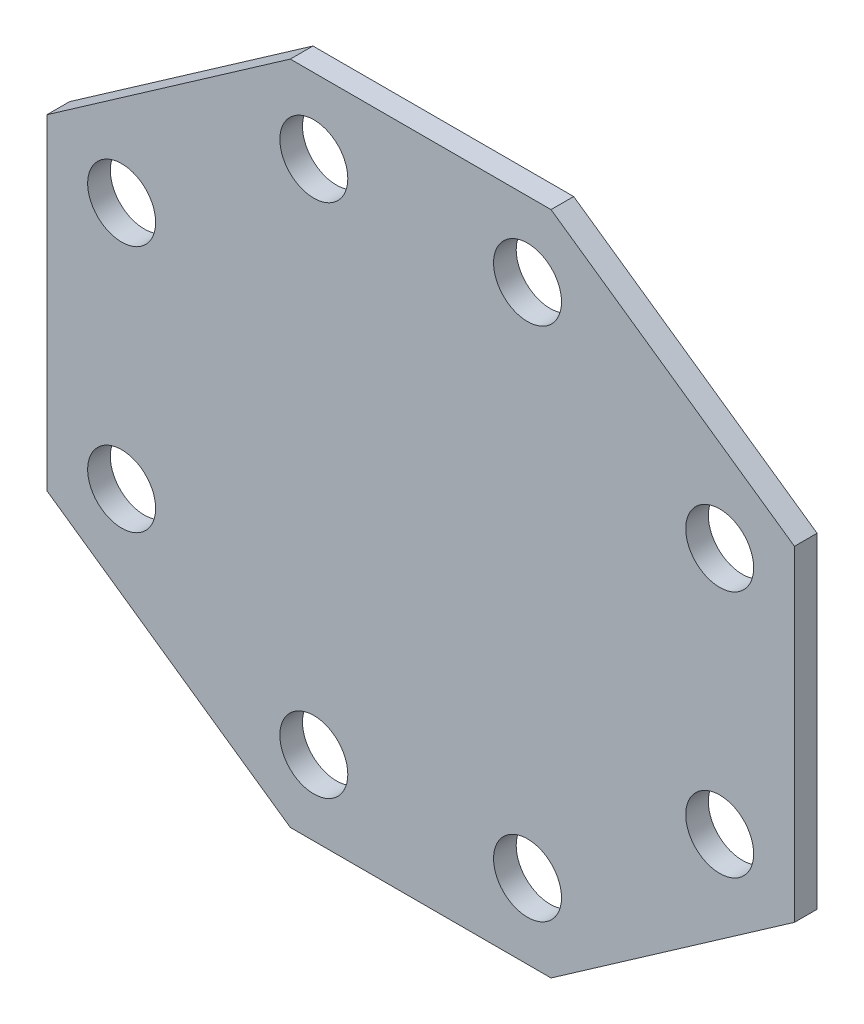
ISO-10303-21;
HEADER;
FILE_DESCRIPTION(('STEP AP214'),'2;1');
FILE_NAME('part.step','',(''),(''),'','','');
FILE_SCHEMA(('AUTOMOTIVE_DESIGN { 1 0 10303 214 1 1 1 1 }'));
ENDSEC;
DATA;
#1=APPLICATION_CONTEXT('core data for automotive mechanical design processes');
#2=APPLICATION_PROTOCOL_DEFINITION('international standard','automotive_design',2000,#1);
#3=PRODUCT_CONTEXT('',#1,'mechanical');
#4=PRODUCT('Part','Part','',(#3));
#5=PRODUCT_RELATED_PRODUCT_CATEGORY('part','',(#4));
#6=PRODUCT_DEFINITION_FORMATION('','',#4);
#7=PRODUCT_DEFINITION_CONTEXT('part definition',#1,'design');
#8=PRODUCT_DEFINITION('design','',#6,#7);
#9=PRODUCT_DEFINITION_SHAPE('','',#8);
#10=(LENGTH_UNIT() NAMED_UNIT(*) SI_UNIT(.MILLI.,.METRE.));
#11=(NAMED_UNIT(*) PLANE_ANGLE_UNIT() SI_UNIT($,.RADIAN.));
#12=(NAMED_UNIT(*) SI_UNIT($,.STERADIAN.) SOLID_ANGLE_UNIT());
#13=UNCERTAINTY_MEASURE_WITH_UNIT(LENGTH_MEASURE(1.E-05),#10,'distance_accuracy_value','');
#14=(GEOMETRIC_REPRESENTATION_CONTEXT(3) GLOBAL_UNCERTAINTY_ASSIGNED_CONTEXT((#13)) GLOBAL_UNIT_ASSIGNED_CONTEXT((#10,
#11,#12)) REPRESENTATION_CONTEXT('',''));
#15=CARTESIAN_POINT('',(0.,0.,0.));
#16=DIRECTION('',(0.,0.,1.));
#17=DIRECTION('',(1.,0.,0.));
#18=AXIS2_PLACEMENT_3D('',#15,#16,#17);
#19=CARTESIAN_POINT('',(0.,0.,0.));
#20=DIRECTION('',(0.,0.,-1.));
#21=DIRECTION('',(-1.,0.,0.));
#22=AXIS2_PLACEMENT_3D('',#19,#20,#21);
#23=PLANE('',#22);
#24=CARTESIAN_POINT('',(197.383610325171,-361.549268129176,0.));
#25=CARTESIAN_POINT('',(197.383676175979,-360.769097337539,0.));
#26=CARTESIAN_POINT('',(197.364624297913,-359.9889156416,0.));
#27=CARTESIAN_POINT('',(197.288299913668,-358.43229230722,0.));
#28=CARTESIAN_POINT('',(197.231118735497,-357.655846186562,0.));
#29=CARTESIAN_POINT('',(197.078549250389,-356.106691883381,0.));
#30=CARTESIAN_POINT('',(196.983159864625,-355.333983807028,0.));
#31=CARTESIAN_POINT('',(196.754292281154,-353.792302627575,0.));
#32=CARTESIAN_POINT('',(196.620721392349,-353.023343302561,0.));
#33=CARTESIAN_POINT('',(196.316316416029,-351.492936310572,0.));
#34=CARTESIAN_POINT('',(196.145487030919,-350.73148770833,0.));
#35=CARTESIAN_POINT('',(195.767000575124,-349.219701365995,0.));
#36=CARTESIAN_POINT('',(195.559431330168,-348.469341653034,0.));
#37=CARTESIAN_POINT('',(195.107558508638,-346.979719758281,0.));
#38=CARTESIAN_POINT('',(194.863252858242,-346.240458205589,0.));
#39=CARTESIAN_POINT('',(194.338001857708,-344.773008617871,0.));
#40=CARTESIAN_POINT('',(194.056967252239,-344.044852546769,0.));
#41=CARTESIAN_POINT('',(193.459829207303,-342.603208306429,0.));
#42=CARTESIAN_POINT('',(193.143731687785,-341.889717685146,0.));
#43=CARTESIAN_POINT('',(192.477583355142,-340.480818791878,0.));
#44=CARTESIAN_POINT('',(192.127614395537,-339.78537183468,0.));
#45=CARTESIAN_POINT('',(191.393813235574,-338.412528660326,0.));
#46=CARTESIAN_POINT('',(191.009979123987,-337.735133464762,0.));
#47=CARTESIAN_POINT('',(190.20853549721,-336.398351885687,0.));
#48=CARTESIAN_POINT('',(189.790844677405,-335.73901426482,0.));
#49=CARTESIAN_POINT('',(188.923929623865,-334.44156667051,0.));
#50=CARTESIAN_POINT('',(188.474710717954,-333.803453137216,0.));
#51=CARTESIAN_POINT('',(187.54649970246,-332.551584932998,0.));
#52=CARTESIAN_POINT('',(187.067580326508,-331.937776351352,0.));
#53=CARTESIAN_POINT('',(186.080050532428,-330.734469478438,0.));
#54=CARTESIAN_POINT('',(185.571438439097,-330.144972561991,0.));
#55=CARTESIAN_POINT('',(184.52460117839,-328.990230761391,0.));
#56=CARTESIAN_POINT('',(183.986305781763,-328.425049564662,0.));
#57=CARTESIAN_POINT('',(182.88292878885,-327.321658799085,0.));
#58=CARTESIAN_POINT('',(182.317851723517,-326.783444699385,0.));
#59=CARTESIAN_POINT('',(181.163248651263,-325.736715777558,0.));
#60=CARTESIAN_POINT('',(180.573783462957,-325.228133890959,0.));
#61=CARTESIAN_POINT('',(179.370475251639,-324.240605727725,0.));
#62=CARTESIAN_POINT('',(178.75663085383,-323.761661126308,0.));
#63=CARTESIAN_POINT('',(177.504629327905,-322.833335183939,0.));
#64=CARTESIAN_POINT('',(176.866415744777,-322.38403000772,0.));
#65=CARTESIAN_POINT('',(175.568978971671,-321.517098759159,0.));
#66=CARTESIAN_POINT('',(174.909759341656,-321.099467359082,0.));
#67=CARTESIAN_POINT('',(173.573134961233,-320.298102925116,0.));
#68=CARTESIAN_POINT('',(172.895776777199,-319.914292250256,0.));
#69=CARTESIAN_POINT('',(171.522932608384,-319.180492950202,0.));
#70=CARTESIAN_POINT('',(170.827445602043,-318.830506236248,0.));
#71=CARTESIAN_POINT('',(169.418393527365,-318.164271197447,0.));
#72=CARTESIAN_POINT('',(168.704787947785,-317.848108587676,0.));
#73=CARTESIAN_POINT('',(167.263151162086,-317.250952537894,0.));
#74=CARTESIAN_POINT('',(166.535122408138,-316.969953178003,0.));
#75=CARTESIAN_POINT('',(165.067842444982,-316.444749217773,0.));
#76=CARTESIAN_POINT('',(164.328621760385,-316.200459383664,0.));
#77=CARTESIAN_POINT('',(162.838999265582,-315.748588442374,0.));
#78=CARTESIAN_POINT('',(162.088596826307,-315.541009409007,0.));
#79=CARTESIAN_POINT('',(160.576643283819,-315.162468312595,0.));
#80=CARTESIAN_POINT('',(159.815069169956,-314.991598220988,0.));
#81=CARTESIAN_POINT('',(158.284633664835,-314.687165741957,0.));
#82=CARTESIAN_POINT('',(157.515773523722,-314.553597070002,0.));
#83=CARTESIAN_POINT('',(155.974224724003,-314.324736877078,0.));
#84=CARTESIAN_POINT('',(155.201549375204,-314.229355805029,0.));
#85=CARTESIAN_POINT('',(153.652393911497,-314.076778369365,0.));
#86=CARTESIAN_POINT('',(152.875913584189,-314.019584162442,0.));
#87=CARTESIAN_POINT('',(151.319162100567,-313.943284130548,0.));
#88=CARTESIAN_POINT('',(150.538886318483,-313.924272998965,0.));
#89=CARTESIAN_POINT('',(148.97846587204,-313.924263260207,0.));
#90=CARTESIAN_POINT('',(148.198321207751,-313.943258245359,0.));
#91=CARTESIAN_POINT('',(146.641744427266,-314.019536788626,0.));
#92=CARTESIAN_POINT('',(145.865307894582,-314.076729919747,0.));
#93=CARTESIAN_POINT('',(144.316152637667,-314.229309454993,0.));
#94=CARTESIAN_POINT('',(143.543434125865,-314.32469801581,0.));
#95=CARTESIAN_POINT('',(142.001709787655,-314.553571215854,0.));
#96=CARTESIAN_POINT('',(141.232717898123,-314.687149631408,0.));
#97=CARTESIAN_POINT('',(139.702278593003,-314.991563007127,0.));
#98=CARTESIAN_POINT('',(138.940829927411,-315.162391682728,0.));
#99=CARTESIAN_POINT('',(137.429043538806,-315.540877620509,0.));
#100=CARTESIAN_POINT('',(136.678683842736,-315.748447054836,0.));
#101=CARTESIAN_POINT('',(135.189061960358,-316.200320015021,0.));
#102=CARTESIAN_POINT('',(134.449800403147,-316.444625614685,0.));
#103=CARTESIAN_POINT('',(132.982350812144,-316.969876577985,0.));
#104=CARTESIAN_POINT('',(132.25419474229,-317.25091119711,0.));
#105=CARTESIAN_POINT('',(130.812550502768,-317.848049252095,0.));
#106=CARTESIAN_POINT('',(130.099059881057,-318.164146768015,0.));
#107=CARTESIAN_POINT('',(128.690160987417,-318.830295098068,0.));
#108=CARTESIAN_POINT('',(127.99471403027,-319.180264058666,0.));
#109=CARTESIAN_POINT('',(126.62187085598,-319.914065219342,0.));
#110=CARTESIAN_POINT('',(125.944475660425,-320.297899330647,0.));
#111=CARTESIAN_POINT('',(124.60769408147,-321.099342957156,0.));
#112=CARTESIAN_POINT('',(123.948356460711,-321.517033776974,0.));
#113=CARTESIAN_POINT('',(122.650908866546,-322.383948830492,0.));
#114=CARTESIAN_POINT('',(122.012795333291,-322.833167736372,0.));
#115=CARTESIAN_POINT('',(120.760927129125,-323.761378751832,0.));
#116=CARTESIAN_POINT('',(120.147118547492,-324.240298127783,0.));
#117=CARTESIAN_POINT('',(118.943811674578,-325.227827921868,0.));
#118=CARTESIAN_POINT('',(118.35431475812,-325.736440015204,0.));
#119=CARTESIAN_POINT('',(117.199572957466,-326.783277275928,0.));
#120=CARTESIAN_POINT('',(116.634391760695,-327.321572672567,0.));
#121=CARTESIAN_POINT('',(115.531000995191,-328.424949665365,0.));
#122=CARTESIAN_POINT('',(114.992786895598,-328.990026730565,0.));
#123=CARTESIAN_POINT('',(113.946057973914,-330.14462980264,0.));
#124=CARTESIAN_POINT('',(113.437476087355,-330.734094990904,0.));
#125=CARTESIAN_POINT('',(112.449947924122,-331.937403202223,0.));
#126=CARTESIAN_POINT('',(111.971003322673,-332.551247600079,0.));
#127=CARTESIAN_POINT('',(111.042677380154,-333.803249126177,0.));
#128=CARTESIAN_POINT('',(110.593372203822,-334.441462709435,0.));
#129=CARTESIAN_POINT('',(109.726440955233,-335.738899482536,0.));
#130=CARTESIAN_POINT('',(109.308809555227,-336.398119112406,0.));
#131=CARTESIAN_POINT('',(108.507445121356,-337.734743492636,0.));
#132=CARTESIAN_POINT('',(108.123634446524,-338.412101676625,0.));
#133=CARTESIAN_POINT('',(107.389835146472,-339.78494584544,0.));
#134=CARTESIAN_POINT('',(107.039848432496,-340.480432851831,0.));
#135=CARTESIAN_POINT('',(106.373613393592,-341.889484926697,0.));
#136=CARTESIAN_POINT('',(106.057450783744,-342.603090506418,0.));
#137=CARTESIAN_POINT('',(105.460294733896,-344.044727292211,0.));
#138=CARTESIAN_POINT('',(105.179295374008,-344.772756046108,0.));
#139=CARTESIAN_POINT('',(104.654091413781,-346.240036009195,0.));
#140=CARTESIAN_POINT('',(104.409801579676,-346.979256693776,0.));
#141=CARTESIAN_POINT('',(103.957930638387,-348.46887918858,0.));
#142=CARTESIAN_POINT('',(103.750351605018,-349.219281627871,0.));
#143=CARTESIAN_POINT('',(103.371810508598,-350.731235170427,0.));
#144=CARTESIAN_POINT('',(103.200940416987,-351.49280928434,0.));
#145=CARTESIAN_POINT('',(102.896507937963,-353.023244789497,0.));
#146=CARTESIAN_POINT('',(102.762939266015,-353.792104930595,0.));
#147=CARTESIAN_POINT('',(102.534079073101,-355.333653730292,0.));
#148=CARTESIAN_POINT('',(102.438698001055,-356.106329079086,0.));
#149=CARTESIAN_POINT('',(102.286120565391,-357.655484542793,0.));
#150=CARTESIAN_POINT('',(102.228926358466,-358.431964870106,0.));
#151=CARTESIAN_POINT('',(102.15262632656,-359.988716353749,0.));
#152=CARTESIAN_POINT('',(102.13361519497,-360.768992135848,0.));
#153=CARTESIAN_POINT('',(102.133605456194,-362.329412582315,0.));
#154=CARTESIAN_POINT('',(102.152600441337,-363.109557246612,0.));
#155=CARTESIAN_POINT('',(102.228878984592,-364.666134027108,0.));
#156=CARTESIAN_POINT('',(102.286072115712,-365.442570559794,0.));
#157=CARTESIAN_POINT('',(102.438651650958,-366.99172581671,0.));
#158=CARTESIAN_POINT('',(102.534040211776,-367.764444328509,0.));
#159=CARTESIAN_POINT('',(102.762913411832,-369.306168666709,0.));
#160=CARTESIAN_POINT('',(102.896491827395,-370.075160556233,0.));
#161=CARTESIAN_POINT('',(103.200905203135,-371.605599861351,0.));
#162=CARTESIAN_POINT('',(103.371733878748,-372.367048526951,0.));
#163=CARTESIAN_POINT('',(103.750219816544,-373.878834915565,0.));
#164=CARTESIAN_POINT('',(103.957789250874,-374.629194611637,0.));
#165=CARTESIAN_POINT('',(104.409662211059,-376.118816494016,0.));
#166=CARTESIAN_POINT('',(104.65396781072,-376.858078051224,0.));
#167=CARTESIAN_POINT('',(105.179218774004,-378.325527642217,0.));
#168=CARTESIAN_POINT('',(105.460253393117,-379.053683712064,0.));
#169=CARTESIAN_POINT('',(106.057391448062,-380.495327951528,0.));
#170=CARTESIAN_POINT('',(106.373488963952,-381.208818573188,0.));
#171=CARTESIAN_POINT('',(107.039637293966,-382.617717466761,0.));
#172=CARTESIAN_POINT('',(107.389606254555,-383.31316442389,0.));
#173=CARTESIAN_POINT('',(108.123407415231,-384.686007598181,0.));
#174=CARTESIAN_POINT('',(108.507241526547,-385.363402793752,0.));
#175=CARTESIAN_POINT('',(109.308685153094,-386.700184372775,0.));
#176=CARTESIAN_POINT('',(109.726375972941,-387.359521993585,0.));
#177=CARTESIAN_POINT('',(110.593291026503,-388.656969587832,0.));
#178=CARTESIAN_POINT('',(111.042509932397,-389.295083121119,0.));
#179=CARTESIAN_POINT('',(111.970720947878,-390.546951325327,0.));
#180=CARTESIAN_POINT('',(112.449640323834,-391.160759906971,0.));
#181=CARTESIAN_POINT('',(113.437170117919,-392.364066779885,0.));
#182=CARTESIAN_POINT('',(113.945782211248,-392.953563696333,0.));
#183=CARTESIAN_POINT('',(114.992619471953,-394.108305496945,0.));
#184=CARTESIAN_POINT('',(115.530914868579,-394.673486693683,0.));
#185=CARTESIAN_POINT('',(116.634291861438,-395.776877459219,0.));
#186=CARTESIAN_POINT('',(117.199368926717,-396.315091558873,0.));
#187=CARTESIAN_POINT('',(118.353971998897,-397.361820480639,0.));
#188=CARTESIAN_POINT('',(118.943437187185,-397.870402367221,0.));
#189=CARTESIAN_POINT('',(120.146745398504,-398.857930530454,0.));
#190=CARTESIAN_POINT('',(120.760589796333,-399.336875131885,0.));
#191=CARTESIAN_POINT('',(122.012591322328,-400.265201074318,0.));
#192=CARTESIAN_POINT('',(122.650804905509,-400.714506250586,0.));
#193=CARTESIAN_POINT('',(123.948241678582,-401.58143749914,0.));
#194=CARTESIAN_POINT('',(124.607461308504,-401.999068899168,0.));
#195=CARTESIAN_POINT('',(125.944085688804,-402.800433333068,0.));
#196=CARTESIAN_POINT('',(126.621443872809,-403.18424400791,0.));
#197=CARTESIAN_POINT('',(127.994288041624,-403.918043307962,0.));
#198=CARTESIAN_POINT('',(128.689775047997,-404.268030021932,0.));
#199=CARTESIAN_POINT('',(130.098827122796,-404.934265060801,0.));
#200=CARTESIAN_POINT('',(130.812432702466,-405.250427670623,0.));
#201=CARTESIAN_POINT('',(132.25406948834,-405.847583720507,0.));
#202=CARTESIAN_POINT('',(132.982098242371,-406.128583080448,0.));
#203=CARTESIAN_POINT('',(134.44937820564,-406.653787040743,0.));
#204=CARTESIAN_POINT('',(135.188598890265,-406.898076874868,0.));
#205=CARTESIAN_POINT('',(136.678221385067,-407.34994781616,0.));
#206=CARTESIAN_POINT('',(137.428623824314,-407.557526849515,0.));
#207=CARTESIAN_POINT('',(138.940577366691,-407.936067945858,0.));
#208=CARTESIAN_POINT('',(139.702151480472,-408.106938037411,0.));
#209=CARTESIAN_POINT('',(141.232586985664,-408.411370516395,0.));
#210=CARTESIAN_POINT('',(142.001447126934,-408.544939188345,0.));
#211=CARTESIAN_POINT('',(143.542995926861,-408.773799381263,0.));
#212=CARTESIAN_POINT('',(144.315671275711,-408.869180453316,0.));
#213=CARTESIAN_POINT('',(145.864826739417,-409.021757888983,0.));
#214=CARTESIAN_POINT('',(146.641307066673,-409.078952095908,0.));
#215=CARTESIAN_POINT('',(148.198058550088,-409.155252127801,0.));
#216=CARTESIAN_POINT('',(148.978334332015,-409.174263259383,0.));
#217=CARTESIAN_POINT('',(150.538754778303,-409.174272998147,0.));
#218=CARTESIAN_POINT('',(151.318899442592,-409.155278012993,0.));
#219=CARTESIAN_POINT('',(152.875476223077,-409.078999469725,0.));
#220=CARTESIAN_POINT('',(153.65191275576,-409.021806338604,0.));
#221=CARTESIAN_POINT('',(155.201068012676,-408.869226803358,0.));
#222=CARTESIAN_POINT('',(155.973786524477,-408.773838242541,0.));
#223=CARTESIAN_POINT('',(157.515510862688,-408.544965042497,0.));
#224=CARTESIAN_POINT('',(158.28450275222,-408.411386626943,0.));
#225=CARTESIAN_POINT('',(159.81494205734,-408.106973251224,0.));
#226=CARTESIAN_POINT('',(160.576390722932,-407.936144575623,0.));
#227=CARTESIAN_POINT('',(162.088177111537,-407.557658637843,0.));
#228=CARTESIAN_POINT('',(162.838536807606,-407.350089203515,0.));
#229=CARTESIAN_POINT('',(164.328158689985,-406.898216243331,0.));
#230=CARTESIAN_POINT('',(165.067420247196,-406.653910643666,0.));
#231=CARTESIAN_POINT('',(166.534869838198,-406.128659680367,0.));
#232=CARTESIAN_POINT('',(167.263025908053,-405.847625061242,0.));
#233=CARTESIAN_POINT('',(168.704670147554,-405.250487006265,0.));
#234=CARTESIAN_POINT('',(169.418160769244,-404.934389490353,0.));
#235=CARTESIAN_POINT('',(170.827059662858,-404.268241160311,0.));
#236=CARTESIAN_POINT('',(171.522506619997,-403.918272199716,0.));
#237=CARTESIAN_POINT('',(172.895349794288,-403.18447103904,0.));
#238=CARTESIAN_POINT('',(173.572744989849,-402.800636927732,0.));
#239=CARTESIAN_POINT('',(174.909526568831,-401.999193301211,0.));
#240=CARTESIAN_POINT('',(175.568864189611,-401.581502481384,0.));
#241=CARTESIAN_POINT('',(176.866311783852,-400.714587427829,0.));
#242=CARTESIAN_POINT('',(177.504425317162,-400.265368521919,0.));
#243=CARTESIAN_POINT('',(178.756293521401,-399.337157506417,0.));
#244=CARTESIAN_POINT('',(179.370102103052,-398.858238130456,0.));
#245=CARTESIAN_POINT('',(180.573408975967,-397.870708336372,0.));
#246=CARTESIAN_POINT('',(181.162905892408,-397.362096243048,0.));
#247=CARTESIAN_POINT('',(182.317647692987,-396.315258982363,0.));
#248=CARTESIAN_POINT('',(182.882828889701,-395.776963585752,0.));
#249=CARTESIAN_POINT('',(183.986219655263,-394.673586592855,0.));
#250=CARTESIAN_POINT('',(184.524433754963,-394.108509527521,0.));
#251=CARTESIAN_POINT('',(185.571162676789,-392.953906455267,0.));
#252=CARTESIAN_POINT('',(186.079744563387,-392.364441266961,0.));
#253=CARTESIAN_POINT('',(187.067272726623,-391.161133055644,0.));
#254=CARTESIAN_POINT('',(187.54621732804,-390.547288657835,0.));
#255=CARTESIAN_POINT('',(188.474543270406,-389.295287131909,0.));
#256=CARTESIAN_POINT('',(188.92384844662,-388.657073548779,0.));
#257=CARTESIAN_POINT('',(189.790779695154,-387.359636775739,0.));
#258=CARTESIAN_POINT('',(190.20841109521,-386.700417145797,0.));
#259=CARTESIAN_POINT('',(191.009775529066,-385.363792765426,0.));
#260=CARTESIAN_POINT('',(191.393586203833,-384.68643458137,0.));
#261=CARTESIAN_POINT('',(192.127385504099,-383.313590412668,0.));
#262=CARTESIAN_POINT('',(192.477372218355,-382.618103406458,0.));
#263=CARTESIAN_POINT('',(193.143607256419,-381.209051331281,0.));
#264=CARTESIAN_POINT('',(193.459769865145,-380.495445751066,0.));
#265=CARTESIAN_POINT('',(194.05692591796,-379.053808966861,0.));
#266=CARTESIAN_POINT('',(194.337925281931,-378.325780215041,0.));
#267=CARTESIAN_POINT('',(194.863129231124,-376.858500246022,0.));
#268=CARTESIAN_POINT('',(195.10741905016,-376.119279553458,0.));
#269=CARTESIAN_POINT('',(195.559290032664,-374.629657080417,0.));
#270=CARTESIAN_POINT('',(195.766869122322,-373.879254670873,0.));
#271=CARTESIAN_POINT('',(196.145410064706,-372.367301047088,0.));
#272=CARTESIAN_POINT('',(196.316279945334,-371.60572682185,0.));
#273=CARTESIAN_POINT('',(196.620719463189,-370.075259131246,0.));
#274=CARTESIAN_POINT('',(196.754293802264,-369.306366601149,0.));
#275=CARTESIAN_POINT('',(196.983164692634,-367.764774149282,0.));
#276=CARTESIAN_POINT('',(197.078551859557,-366.992087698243,0.));
#277=CARTESIAN_POINT('',(197.231120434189,-365.442933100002,0.));
#278=CARTESIAN_POINT('',(197.28830076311,-364.666464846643,0.));
#279=CARTESIAN_POINT('',(197.364625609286,-363.109753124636,0.));
#280=CARTESIAN_POINT('',(197.383676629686,-362.329505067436,0.));
#281=CARTESIAN_POINT('',(197.383610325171,-361.549268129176,0.));
#282=B_SPLINE_CURVE_WITH_KNOTS('',3,(#24,#25,#26,#27,#28,#29,#30,#31,#32,#33,#34,#35,#36,#37,
#38,#39,#40,#41,#42,#43,#44,#45,#46,#47,#48,#49,#50,#51,#52,#53,#54,#55,#56,#57,#58,#59,#60,#61,
#62,#63,#64,#65,#66,#67,#68,#69,#70,#71,#72,#73,#74,#75,#76,#77,#78,#79,#80,#81,#82,#83,#84,#85,
#86,#87,#88,#89,#90,#91,#92,#93,#94,#95,#96,#97,#98,#99,#100,#101,#102,#103,#104,#105,#106,#107,
#108,#109,#110,#111,#112,#113,#114,#115,#116,#117,#118,#119,#120,#121,#122,#123,#124,#125,#126,
#127,#128,#129,#130,#131,#132,#133,#134,#135,#136,#137,#138,#139,#140,#141,#142,#143,#144,#145,
#146,#147,#148,#149,#150,#151,#152,#153,#154,#155,#156,#157,#158,#159,#160,#161,#162,#163,#164,
#165,#166,#167,#168,#169,#170,#171,#172,#173,#174,#175,#176,#177,#178,#179,#180,#181,#182,#183,
#184,#185,#186,#187,#188,#189,#190,#191,#192,#193,#194,#195,#196,#197,#198,#199,#200,#201,#202,
#203,#204,#205,#206,#207,#208,#209,#210,#211,#212,#213,#214,#215,#216,#217,#218,#219,#220,#221,
#222,#223,#224,#225,#226,#227,#228,#229,#230,#231,#232,#233,#234,#235,#236,#237,#238,#239,#240,
#241,#242,#243,#244,#245,#246,#247,#248,#249,#250,#251,#252,#253,#254,#255,#256,#257,#258,#259,
#260,#261,#262,#263,#264,#265,#266,#267,#268,#269,#270,#271,#272,#273,#274,#275,#276,#277,#278,
#279,#280,#281),.UNSPECIFIED.,.F.,.F.,(4,2,2,2,2,2,2,2,2,2,2,2,2,2,2,2,2,2,2,2,2,2,2,2,2,2,2,2,
2,2,2,2,2,2,2,2,2,2,2,2,2,2,2,2,2,2,2,2,2,2,2,2,2,2,2,2,2,2,2,2,2,2,2,2,2,2,2,2,2,2,2,2,2,2,2,2,
2,2,2,2,2,2,2,2,2,2,2,2,2,2,2,2,2,2,2,2,2,2,2,2,2,2,2,2,2,2,2,2,2,2,2,2,2,2,2,2,2,2,2,2,2,2,2,2,
2,2,2,2,4),(0.,2.34029302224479,4.67500057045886,7.00977404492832,9.35026436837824,
11.6904594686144,14.0251341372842,16.3599406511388,18.7005303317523,21.0407254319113,
23.3754001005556,25.7102066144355,28.0507962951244,30.3909913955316,32.7256660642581,
35.0604725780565,37.4010622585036,39.7412573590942,42.0759320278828,44.4107385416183,
46.7513282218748,49.0915233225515,51.4261979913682,53.7610045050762,56.1015941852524,
58.441789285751,60.7764639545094,63.1112704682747,65.4518601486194,67.7920552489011,
70.1267299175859,72.4615364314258,74.8021261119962,77.1423212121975,79.4769958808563,
81.8118023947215,84.1523920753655,86.4925871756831,88.8272618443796,91.1620683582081,
93.5026580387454,95.8428531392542,98.1775278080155,100.512334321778,102.852924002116,
105.193119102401,107.527793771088,109.862600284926,112.203189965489,114.543385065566,
116.878059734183,119.21286624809,121.55345592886,123.893651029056,126.228325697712,
128.563132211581,130.903721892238,133.24391699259,135.578591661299,137.913398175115,
140.25398785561,142.594182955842,144.928857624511,147.263664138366,149.604253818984,
151.944448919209,154.279123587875,156.613930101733,158.954519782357,161.294714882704,
163.62938955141,165.964196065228,168.304785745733,170.644980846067,172.97965551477,
175.314462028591,177.655051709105,179.995246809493,182.329921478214,184.664727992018,
187.005317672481,189.345512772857,191.680187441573,194.014993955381,196.355583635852,
198.695778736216,201.030453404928,203.36525991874,205.705849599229,208.046044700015,
210.380719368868,212.71552588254,215.056115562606,217.396310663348,219.730985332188,
222.065791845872,224.406381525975,226.746576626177,229.081251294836,231.416057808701,
233.756647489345,236.096842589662,238.431517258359,240.766323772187,243.106913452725,
245.447108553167,247.781783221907,250.116589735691,252.457179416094,254.797374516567,
257.132049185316,259.466855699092,261.807445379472,264.147640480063,266.482315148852,
268.817121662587,271.157711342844,273.4979064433,275.832581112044,278.167387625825,
280.507977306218,282.848172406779,285.182847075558,287.517653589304,289.858243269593,
292.198537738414,294.533245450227,296.86801908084,299.208510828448),.UNSPECIFIED.);
#283=CARTESIAN_POINT('',(197.383610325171,-361.549268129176,0.));
#284=VERTEX_POINT('',#283);
#285=EDGE_CURVE('E236',#284,#284,#282,.T.);
#286=ORIENTED_EDGE('',*,*,#285,.T.);
#287=EDGE_LOOP('',(#286));
#288=FACE_BOUND('',#287,.T.);
#289=CARTESIAN_POINT('',(466.705268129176,173.588730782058,0.));
#290=CARTESIAN_POINT('',(466.705333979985,174.368901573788,0.));
#291=CARTESIAN_POINT('',(466.686282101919,175.14908326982,0.));
#292=CARTESIAN_POINT('',(466.609957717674,176.705706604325,0.));
#293=CARTESIAN_POINT('',(466.552776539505,177.482152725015,0.));
#294=CARTESIAN_POINT('',(466.400207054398,179.031307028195,0.));
#295=CARTESIAN_POINT('',(466.304817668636,179.804015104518,0.));
#296=CARTESIAN_POINT('',(466.075950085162,181.345696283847,0.));
#297=CARTESIAN_POINT('',(465.942379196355,182.114655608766,0.));
#298=CARTESIAN_POINT('',(465.637974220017,183.645062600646,0.));
#299=CARTESIAN_POINT('',(465.467144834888,184.406511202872,0.));
#300=CARTESIAN_POINT('',(465.08865837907,185.918297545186,0.));
#301=CARTESIAN_POINT('',(464.88108913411,186.668657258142,0.));
#302=CARTESIAN_POINT('',(464.42921631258,188.158279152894,0.));
#303=CARTESIAN_POINT('',(464.184910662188,188.89754070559,0.));
#304=CARTESIAN_POINT('',(463.659659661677,190.364990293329,0.));
#305=CARTESIAN_POINT('',(463.378625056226,191.093146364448,0.));
#306=CARTESIAN_POINT('',(462.781487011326,192.534790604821,0.));
#307=CARTESIAN_POINT('',(462.465389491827,193.248281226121,0.));
#308=CARTESIAN_POINT('',(461.799241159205,194.65718011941,0.));
#309=CARTESIAN_POINT('',(461.449272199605,195.352627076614,0.));
#310=CARTESIAN_POINT('',(460.715471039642,196.725470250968,0.));
#311=CARTESIAN_POINT('',(460.33163692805,197.402865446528,0.));
#312=CARTESIAN_POINT('',(459.530193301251,198.739647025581,0.));
#313=CARTESIAN_POINT('',(459.112502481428,199.398984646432,0.));
#314=CARTESIAN_POINT('',(458.245587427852,200.696432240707,0.));
#315=CARTESIAN_POINT('',(457.796368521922,201.334545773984,0.));
#316=CARTESIAN_POINT('',(456.868157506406,202.586413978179,0.));
#317=CARTESIAN_POINT('',(456.38923813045,203.200222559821,0.));
#318=CARTESIAN_POINT('',(455.40170833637,204.403529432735,0.));
#319=CARTESIAN_POINT('',(454.893096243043,204.993026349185,0.));
#320=CARTESIAN_POINT('',(453.84625898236,206.147768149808,0.));
#321=CARTESIAN_POINT('',(453.307963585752,206.712949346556,0.));
#322=CARTESIAN_POINT('',(452.20458659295,207.816340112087,0.));
#323=CARTESIAN_POINT('',(451.639509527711,208.354554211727,0.));
#324=CARTESIAN_POINT('',(450.484906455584,209.401283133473,0.));
#325=CARTESIAN_POINT('',(449.895441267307,209.909865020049,0.));
#326=CARTESIAN_POINT('',(448.692133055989,210.897393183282,0.));
#327=CARTESIAN_POINT('',(448.078288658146,211.376337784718,0.));
#328=CARTESIAN_POINT('',(446.826287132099,212.304663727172,0.));
#329=CARTESIAN_POINT('',(446.188073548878,212.753968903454,0.));
#330=CARTESIAN_POINT('',(444.890636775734,213.620900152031,0.));
#331=CARTESIAN_POINT('',(444.231417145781,214.038531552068,0.));
#332=CARTESIAN_POINT('',(442.894792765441,214.839895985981,0.));
#333=CARTESIAN_POINT('',(442.217434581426,215.223706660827,0.));
#334=CARTESIAN_POINT('',(440.844590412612,215.957505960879,0.));
#335=CARTESIAN_POINT('',(440.149103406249,216.307492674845,0.));
#336=CARTESIAN_POINT('',(438.740051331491,216.973727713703,0.));
#337=CARTESIAN_POINT('',(438.026445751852,217.289890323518,0.));
#338=CARTESIAN_POINT('',(436.584808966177,217.887046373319,0.));
#339=CARTESIAN_POINT('',(435.856780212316,218.168045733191,0.));
#340=CARTESIAN_POINT('',(434.389500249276,218.693249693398,0.));
#341=CARTESIAN_POINT('',(433.650279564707,218.937539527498,0.));
#342=CARTESIAN_POINT('',(432.160657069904,219.389410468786,0.));
#343=CARTESIAN_POINT('',(431.4102546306,219.596989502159,0.));
#344=CARTESIAN_POINT('',(429.898301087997,219.9755305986,0.));
#345=CARTESIAN_POINT('',(429.136726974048,220.146400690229,0.));
#346=CARTESIAN_POINT('',(427.606291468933,220.450833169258,0.));
#347=CARTESIAN_POINT('',(426.837431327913,220.584401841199,0.));
#348=CARTESIAN_POINT('',(425.29588252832,220.813262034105,0.));
#349=CARTESIAN_POINT('',(424.523207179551,220.908643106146,0.));
#350=CARTESIAN_POINT('',(422.974051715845,221.06122054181,0.));
#351=CARTESIAN_POINT('',(422.197571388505,221.118414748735,0.));
#352=CARTESIAN_POINT('',(420.640819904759,221.194714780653,0.));
#353=CARTESIAN_POINT('',(419.860544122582,221.213725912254,0.));
#354=CARTESIAN_POINT('',(418.300123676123,221.213735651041,0.));
#355=CARTESIAN_POINT('',(417.519979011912,221.194740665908,0.));
#356=CARTESIAN_POINT('',(415.96340223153,221.118462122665,0.));
#357=CARTESIAN_POINT('',(415.186965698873,221.061268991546,0.));
#358=CARTESIAN_POINT('',(413.637810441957,220.908689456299,0.));
#359=CARTESIAN_POINT('',(412.86509193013,220.813300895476,0.));
#360=CARTESIAN_POINT('',(411.323367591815,220.584427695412,0.));
#361=CARTESIAN_POINT('',(410.554375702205,220.450849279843,0.));
#362=CARTESIAN_POINT('',(409.023936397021,220.146435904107,0.));
#363=CARTESIAN_POINT('',(408.26248773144,219.97560722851,0.));
#364=CARTESIAN_POINT('',(406.750701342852,219.597121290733,0.));
#365=CARTESIAN_POINT('',(406.000341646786,219.389551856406,0.));
#366=CARTESIAN_POINT('',(404.510719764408,218.937678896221,0.));
#367=CARTESIAN_POINT('',(403.771458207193,218.693373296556,0.));
#368=CARTESIAN_POINT('',(402.304008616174,218.168122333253,0.));
#369=CARTESIAN_POINT('',(401.575852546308,217.887087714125,0.));
#370=CARTESIAN_POINT('',(400.134208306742,217.28994965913,0.));
#371=CARTESIAN_POINT('',(399.420717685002,216.9738521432,0.));
#372=CARTESIAN_POINT('',(398.011818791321,216.307703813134,0.));
#373=CARTESIAN_POINT('',(397.316371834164,215.957734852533,0.));
#374=CARTESIAN_POINT('',(395.943528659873,215.223933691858,0.));
#375=CARTESIAN_POINT('',(395.266133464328,214.840099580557,0.));
#376=CARTESIAN_POINT('',(393.929351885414,214.038655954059,0.));
#377=CARTESIAN_POINT('',(393.270014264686,213.620965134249,0.));
#378=CARTESIAN_POINT('',(391.972566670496,212.754050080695,0.));
#379=CARTESIAN_POINT('',(391.334453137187,212.304831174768,0.));
#380=CARTESIAN_POINT('',(390.08258493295,211.376620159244,0.));
#381=CARTESIAN_POINT('',(389.468776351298,210.897700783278,0.));
#382=CARTESIAN_POINT('',(388.265469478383,209.910170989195,0.));
#383=CARTESIAN_POINT('',(387.675972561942,209.401558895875,0.));
#384=CARTESIAN_POINT('',(386.521230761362,208.354721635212,0.));
#385=CARTESIAN_POINT('',(385.956049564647,207.816426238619,0.));
#386=CARTESIAN_POINT('',(384.852658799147,206.713049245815,0.));
#387=CARTESIAN_POINT('',(384.314444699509,206.14797218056,0.));
#388=CARTESIAN_POINT('',(383.267715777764,204.993369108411,0.));
#389=CARTESIAN_POINT('',(382.759133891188,204.40390392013,0.));
#390=CARTESIAN_POINT('',(381.771605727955,203.200595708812,0.));
#391=CARTESIAN_POINT('',(381.29266112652,202.586751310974,0.));
#392=CARTESIAN_POINT('',(380.364335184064,201.334749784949,0.));
#393=CARTESIAN_POINT('',(379.91503000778,200.696536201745,0.));
#394=CARTESIAN_POINT('',(379.048098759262,199.399099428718,0.));
#395=CARTESIAN_POINT('',(378.630467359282,198.739879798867,0.));
#396=CARTESIAN_POINT('',(377.829102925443,197.403255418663,0.));
#397=CARTESIAN_POINT('',(377.445292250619,196.725897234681,0.));
#398=CARTESIAN_POINT('',(376.711492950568,195.353053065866,0.));
#399=CARTESIAN_POINT('',(376.361506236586,194.657566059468,0.));
#400=CARTESIAN_POINT('',(375.695271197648,193.248513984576,0.));
#401=CARTESIAN_POINT('',(375.379108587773,192.534908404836,0.));
#402=CARTESIAN_POINT('',(374.781952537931,191.09327161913,0.));
#403=CARTESIAN_POINT('',(374.50095317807,190.365242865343,0.));
#404=CARTESIAN_POINT('',(373.975749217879,188.8979629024,0.));
#405=CARTESIAN_POINT('',(373.731459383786,188.158742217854,0.));
#406=CARTESIAN_POINT('',(373.279588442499,186.66911972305,0.));
#407=CARTESIAN_POINT('',(373.072009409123,185.918717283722,0.));
#408=CARTESIAN_POINT('',(372.69346831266,184.406763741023,0.));
#409=CARTESIAN_POINT('',(372.522598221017,183.645189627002,0.));
#410=CARTESIAN_POINT('',(372.218165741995,182.114754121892,0.));
#411=CARTESIAN_POINT('',(372.084597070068,181.34589398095,0.));
#412=CARTESIAN_POINT('',(371.855736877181,179.804345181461,0.));
#413=CARTESIAN_POINT('',(371.760355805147,179.031669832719,0.));
#414=CARTESIAN_POINT('',(371.607778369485,177.482514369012,0.));
#415=CARTESIAN_POINT('',(371.550584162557,176.706034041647,0.));
#416=CARTESIAN_POINT('',(371.474284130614,175.149282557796,0.));
#417=CARTESIAN_POINT('',(371.455272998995,174.369006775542,0.));
#418=CARTESIAN_POINT('',(371.455263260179,172.808586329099,0.));
#419=CARTESIAN_POINT('',(371.474258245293,172.028441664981,0.));
#420=CARTESIAN_POINT('',(371.550536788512,170.471864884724,0.));
#421=CARTESIAN_POINT('',(371.607729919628,169.695428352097,0.));
#422=CARTESIAN_POINT('',(371.760309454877,168.146273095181,0.));
#423=CARTESIAN_POINT('',(371.855698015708,167.373554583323,0.));
#424=CARTESIAN_POINT('',(372.084571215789,165.831830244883,0.));
#425=CARTESIAN_POINT('',(372.218149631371,165.062838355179,0.));
#426=CARTESIAN_POINT('',(372.522563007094,163.532399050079,0.));
#427=CARTESIAN_POINT('',(372.693391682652,162.770950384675,0.));
#428=CARTESIAN_POINT('',(373.071877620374,161.25916399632,0.));
#429=CARTESIAN_POINT('',(373.279447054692,160.508804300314,0.));
#430=CARTESIAN_POINT('',(373.731320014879,159.019182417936,0.));
#431=CARTESIAN_POINT('',(373.975625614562,158.279920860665,0.));
#432=CARTESIAN_POINT('',(374.500876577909,156.81247126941,0.));
#433=CARTESIAN_POINT('',(374.781911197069,156.084315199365,0.));
#434=CARTESIAN_POINT('',(375.379049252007,154.642670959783,0.));
#435=CARTESIAN_POINT('',(375.69514676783,153.929180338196,0.));
#436=CARTESIAN_POINT('',(376.361295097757,152.520281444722,0.));
#437=CARTESIAN_POINT('',(376.71126405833,151.824834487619,0.));
#438=CARTESIAN_POINT('',(377.445065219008,150.451991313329,0.));
#439=CARTESIAN_POINT('',(377.828899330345,149.774596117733,0.));
#440=CARTESIAN_POINT('',(378.630342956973,148.437814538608,0.));
#441=CARTESIAN_POINT('',(379.048033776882,147.778476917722,0.));
#442=CARTESIAN_POINT('',(379.914948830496,146.481029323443,0.));
#443=CARTESIAN_POINT('',(380.364167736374,145.842915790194,0.));
#444=CARTESIAN_POINT('',(381.292378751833,144.591047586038,0.));
#445=CARTESIAN_POINT('',(381.771298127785,143.977239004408,0.));
#446=CARTESIAN_POINT('',(382.75882792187,142.773932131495,0.));
#447=CARTESIAN_POINT('',(383.267440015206,142.184435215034,0.));
#448=CARTESIAN_POINT('',(384.31427727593,141.02969341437,0.));
#449=CARTESIAN_POINT('',(384.852572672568,140.464512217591,0.));
#450=CARTESIAN_POINT('',(385.955949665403,139.36112145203,0.));
#451=CARTESIAN_POINT('',(386.521026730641,138.82290735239,0.));
#452=CARTESIAN_POINT('',(387.675629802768,137.776178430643,0.));
#453=CARTESIAN_POINT('',(388.265094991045,137.267596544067,0.));
#454=CARTESIAN_POINT('',(389.468403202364,136.280068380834,0.));
#455=CARTESIAN_POINT('',(390.082247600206,135.801123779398,0.));
#456=CARTESIAN_POINT('',(391.334249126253,134.872797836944,0.));
#457=CARTESIAN_POINT('',(391.972462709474,134.423492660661,0.));
#458=CARTESIAN_POINT('',(393.269899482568,133.55656141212,0.));
#459=CARTESIAN_POINT('',(393.929119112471,133.138930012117,0.));
#460=CARTESIAN_POINT('',(395.265743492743,132.337565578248,0.));
#461=CARTESIAN_POINT('',(395.943101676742,131.953754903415,0.));
#462=CARTESIAN_POINT('',(397.315945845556,131.219955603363,0.));
#463=CARTESIAN_POINT('',(398.011432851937,130.869968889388,0.));
#464=CARTESIAN_POINT('',(399.420484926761,130.203733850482,0.));
#465=CARTESIAN_POINT('',(400.13409050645,129.887571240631,0.));
#466=CARTESIAN_POINT('',(401.575727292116,129.29041519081,0.));
#467=CARTESIAN_POINT('',(402.303756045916,129.009415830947,0.));
#468=CARTESIAN_POINT('',(403.771036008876,128.484211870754,0.));
#469=CARTESIAN_POINT('',(404.510256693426,128.23992203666,0.));
#470=CARTESIAN_POINT('',(405.999879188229,127.788051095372,0.));
#471=CARTESIAN_POINT('',(406.750281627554,127.580472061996,0.));
#472=CARTESIAN_POINT('',(408.262235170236,127.201930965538,0.));
#473=CARTESIAN_POINT('',(409.023809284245,127.031060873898,0.));
#474=CARTESIAN_POINT('',(410.554244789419,126.726628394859,0.));
#475=CARTESIAN_POINT('',(411.323104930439,126.593059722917,0.));
#476=CARTESIAN_POINT('',(412.864653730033,126.364199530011,0.));
#477=CARTESIAN_POINT('',(413.637329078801,126.26881845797,0.));
#478=CARTESIAN_POINT('',(415.186484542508,126.116241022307,0.));
#479=CARTESIAN_POINT('',(415.962964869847,126.059046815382,0.));
#480=CARTESIAN_POINT('',(417.519716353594,125.982746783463,0.));
#481=CARTESIAN_POINT('',(418.29999213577,125.963735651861,0.));
#482=CARTESIAN_POINT('',(419.860412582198,125.963725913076,0.));
#483=CARTESIAN_POINT('',(420.640557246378,125.982720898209,0.));
#484=CARTESIAN_POINT('',(422.197134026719,126.058999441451,0.));
#485=CARTESIAN_POINT('',(422.973570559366,126.11619257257,0.));
#486=CARTESIAN_POINT('',(424.522725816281,126.268772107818,0.));
#487=CARTESIAN_POINT('',(425.295444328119,126.364160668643,0.));
#488=CARTESIAN_POINT('',(426.837168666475,126.593033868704,0.));
#489=CARTESIAN_POINT('',(427.606160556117,126.726612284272,0.));
#490=CARTESIAN_POINT('',(429.136599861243,127.031025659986,0.));
#491=CARTESIAN_POINT('',(429.898048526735,127.201854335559,0.));
#492=CARTESIAN_POINT('',(431.409834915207,127.580340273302,0.));
#493=CARTESIAN_POINT('',(432.160194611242,127.787909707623,0.));
#494=CARTESIAN_POINT('',(433.64981649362,128.239782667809,0.));
#495=CARTESIAN_POINT('',(434.389078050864,128.484088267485,0.));
#496=CARTESIAN_POINT('',(435.856527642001,129.009339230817,0.));
#497=CARTESIAN_POINT('',(436.584683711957,129.290373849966,0.));
#498=CARTESIAN_POINT('',(438.026327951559,129.887511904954,0.));
#499=CARTESIAN_POINT('',(438.73981857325,130.203609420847,0.));
#500=CARTESIAN_POINT('',(440.148717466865,130.869757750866,0.));
#501=CARTESIAN_POINT('',(440.844164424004,131.219726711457,0.));
#502=CARTESIAN_POINT('',(442.217007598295,131.953527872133,0.));
#503=CARTESIAN_POINT('',(442.894402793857,132.337361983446,0.));
#504=CARTESIAN_POINT('',(444.231184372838,133.138805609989,0.));
#505=CARTESIAN_POINT('',(444.890521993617,133.556496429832,0.));
#506=CARTESIAN_POINT('',(446.187969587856,134.423411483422,0.));
#507=CARTESIAN_POINT('',(446.826083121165,134.872630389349,0.));
#508=CARTESIAN_POINT('',(448.077951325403,135.800841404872,0.));
#509=CARTESIAN_POINT('',(448.691759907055,136.279760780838,0.));
#510=CARTESIAN_POINT('',(449.895066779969,137.267290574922,0.));
#511=CARTESIAN_POINT('',(450.48456369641,137.775902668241,0.));
#512=CARTESIAN_POINT('',(451.63930549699,138.822739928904,0.));
#513=CARTESIAN_POINT('',(452.204486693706,139.361035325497,0.));
#514=CARTESIAN_POINT('',(453.307877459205,140.464412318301,0.));
#515=CARTESIAN_POINT('',(453.846091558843,141.029489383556,0.));
#516=CARTESIAN_POINT('',(454.892820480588,142.184092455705,0.));
#517=CARTESIAN_POINT('',(455.401402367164,142.773557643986,0.));
#518=CARTESIAN_POINT('',(456.388930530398,143.976865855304,0.));
#519=CARTESIAN_POINT('',(456.867875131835,144.590710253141,0.));
#520=CARTESIAN_POINT('',(457.796201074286,145.842711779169,0.));
#521=CARTESIAN_POINT('',(458.245506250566,146.480925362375,0.));
#522=CARTESIAN_POINT('',(459.112437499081,147.778362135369,0.));
#523=CARTESIAN_POINT('',(459.530068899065,148.437581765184,0.));
#524=CARTESIAN_POINT('',(460.331433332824,149.774206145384,0.));
#525=CARTESIAN_POINT('',(460.715244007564,150.451564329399,0.));
#526=CARTESIAN_POINT('',(461.449043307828,151.824408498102,0.));
#527=CARTESIAN_POINT('',(461.799030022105,152.519895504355,0.));
#528=CARTESIAN_POINT('',(462.465265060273,153.928947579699,0.));
#529=CARTESIAN_POINT('',(462.781427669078,154.642553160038,0.));
#530=CARTESIAN_POINT('',(463.378583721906,156.084189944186,0.));
#531=CARTESIAN_POINT('',(463.659583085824,156.812218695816,0.));
#532=CARTESIAN_POINT('',(464.184787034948,158.279498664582,0.));
#533=CARTESIAN_POINT('',(464.429076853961,159.018719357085,0.));
#534=CARTESIAN_POINT('',(464.880947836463,160.508341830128,0.));
#535=CARTESIAN_POINT('',(465.088526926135,161.258744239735,0.));
#536=CARTESIAN_POINT('',(465.467067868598,162.770697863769,0.));
#537=CARTESIAN_POINT('',(465.637937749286,163.532272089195,0.));
#538=CARTESIAN_POINT('',(465.942377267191,165.062739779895,0.));
#539=CARTESIAN_POINT('',(466.075951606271,165.831632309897,0.));
#540=CARTESIAN_POINT('',(466.304822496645,167.373224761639,0.));
#541=CARTESIAN_POINT('',(466.400209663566,168.145911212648,0.));
#542=CARTESIAN_POINT('',(466.552778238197,169.695065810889,0.));
#543=CARTESIAN_POINT('',(466.609958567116,170.47153406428,0.));
#544=CARTESIAN_POINT('',(466.686283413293,172.028245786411,0.));
#545=CARTESIAN_POINT('',(466.705334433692,172.808493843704,0.));
#546=CARTESIAN_POINT('',(466.705268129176,173.588730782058,0.));
#547=B_SPLINE_CURVE_WITH_KNOTS('',3,(#289,#290,#291,#292,#293,#294,#295,#296,#297,#298,#299,
#300,#301,#302,#303,#304,#305,#306,#307,#308,#309,#310,#311,#312,#313,#314,#315,#316,#317,#318,
#319,#320,#321,#322,#323,#324,#325,#326,#327,#328,#329,#330,#331,#332,#333,#334,#335,#336,#337,
#338,#339,#340,#341,#342,#343,#344,#345,#346,#347,#348,#349,#350,#351,#352,#353,#354,#355,#356,
#357,#358,#359,#360,#361,#362,#363,#364,#365,#366,#367,#368,#369,#370,#371,#372,#373,#374,#375,
#376,#377,#378,#379,#380,#381,#382,#383,#384,#385,#386,#387,#388,#389,#390,#391,#392,#393,#394,
#395,#396,#397,#398,#399,#400,#401,#402,#403,#404,#405,#406,#407,#408,#409,#410,#411,#412,#413,
#414,#415,#416,#417,#418,#419,#420,#421,#422,#423,#424,#425,#426,#427,#428,#429,#430,#431,#432,
#433,#434,#435,#436,#437,#438,#439,#440,#441,#442,#443,#444,#445,#446,#447,#448,#449,#450,#451,
#452,#453,#454,#455,#456,#457,#458,#459,#460,#461,#462,#463,#464,#465,#466,#467,#468,#469,#470,
#471,#472,#473,#474,#475,#476,#477,#478,#479,#480,#481,#482,#483,#484,#485,#486,#487,#488,#489,
#490,#491,#492,#493,#494,#495,#496,#497,#498,#499,#500,#501,#502,#503,#504,#505,#506,#507,#508,
#509,#510,#511,#512,#513,#514,#515,#516,#517,#518,#519,#520,#521,#522,#523,#524,#525,#526,#527,
#528,#529,#530,#531,#532,#533,#534,#535,#536,#537,#538,#539,#540,#541,#542,#543,#544,#545,#546),
.UNSPECIFIED.,.F.,.F.,(4,2,2,2,2,2,2,2,2,2,2,2,2,2,2,2,2,2,2,2,2,2,2,2,2,2,2,2,2,2,2,2,2,2,2,2,
2,2,2,2,2,2,2,2,2,2,2,2,2,2,2,2,2,2,2,2,2,2,2,2,2,2,2,2,2,2,2,2,2,2,2,2,2,2,2,2,2,2,2,2,2,2,2,2,
2,2,2,2,2,2,2,2,2,2,2,2,2,2,2,2,2,2,2,2,2,2,2,2,2,2,2,2,2,2,2,2,2,2,2,2,2,2,2,2,2,2,2,2,4),(0.,
2.34029302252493,4.67500057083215,7.00977404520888,9.35026436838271,11.6904594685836,
14.0251341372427,16.3599406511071,18.7005303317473,21.0407254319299,23.3754001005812,
25.7102066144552,28.0507962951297,30.3909913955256,32.7256660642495,35.0604725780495,
37.4010622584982,39.7412573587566,42.0759320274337,44.4107385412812,46.7513282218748,
49.0915233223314,51.4261979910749,53.7610045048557,56.1015941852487,58.4417892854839,
60.7764639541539,63.1112704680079,65.4518601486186,67.7920552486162,70.1267299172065,
72.4615364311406,74.8021261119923,77.1423212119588,79.4769958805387,81.8118023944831,
84.1523920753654,86.4925871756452,88.8272618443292,91.1620683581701,93.5026580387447,
95.8428531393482,98.1775278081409,100.512334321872,102.852924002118,105.193119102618,
107.527793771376,109.862600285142,112.20318996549,114.543385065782,116.878059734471,
119.212866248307,121.553455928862,123.893651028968,126.228325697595,128.563132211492,
130.903721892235,133.243916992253,135.57859166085,137.913398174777,140.253987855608,
142.594182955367,144.928857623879,147.263664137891,149.604253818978,151.944448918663,
154.279123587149,156.613930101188,158.954519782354,161.294714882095,163.629389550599,
165.964196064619,168.304785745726,170.644980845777,172.979655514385,175.314462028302,
177.655051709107,179.995246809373,182.329921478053,184.664727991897,187.005317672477,
189.345512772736,191.680187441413,194.01499395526,196.355583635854,198.695778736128,
201.030453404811,203.365259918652,205.705849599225,208.04604469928,210.38071936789,
212.715525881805,215.056115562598,217.396310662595,219.730985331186,222.06579184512,
224.406381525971,226.746576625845,229.081251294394,231.416057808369,233.756647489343,
236.096842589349,238.431517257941,240.766323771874,243.106913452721,245.447108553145,
247.781783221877,250.116589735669,252.457179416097,254.797374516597,257.132049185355,
259.466855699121,261.807445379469,264.147640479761,266.48231514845,268.817121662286,
271.157711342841,273.497906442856,275.832581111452,278.16738762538,280.507977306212,
282.848172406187,285.18284707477,287.517653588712,289.858243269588,292.198537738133,
294.533245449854,296.86801908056,299.208510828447),.UNSPECIFIED.);
#548=CARTESIAN_POINT('',(466.705268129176,173.588730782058,0.));
#549=VERTEX_POINT('',#548);
#550=EDGE_CURVE('E459',#549,#549,#547,.T.);
#551=ORIENTED_EDGE('',*,*,#550,.T.);
#552=EDGE_LOOP('',(#551));
#553=FACE_BOUND('',#552,.T.);
#554=CARTESIAN_POINT('',(-102.133610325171,361.549268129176,0.));
#555=CARTESIAN_POINT('',(-102.133544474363,362.329438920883,0.));
#556=CARTESIAN_POINT('',(-102.152596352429,363.109620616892,0.));
#557=CARTESIAN_POINT('',(-102.228920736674,364.666243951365,0.));
#558=CARTESIAN_POINT('',(-102.286101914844,365.442690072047,0.));
#559=CARTESIAN_POINT('',(-102.438671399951,366.991844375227,0.));
#560=CARTESIAN_POINT('',(-102.534060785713,367.764552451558,0.));
#561=CARTESIAN_POINT('',(-102.762928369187,369.306233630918,0.));
#562=CARTESIAN_POINT('',(-102.896499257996,370.07519295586,0.));
#563=CARTESIAN_POINT('',(-103.200904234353,371.605599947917,0.));
#564=CARTESIAN_POINT('',(-103.371733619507,372.367048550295,0.));
#565=CARTESIAN_POINT('',(-103.75022007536,373.878834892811,0.));
#566=CARTESIAN_POINT('',(-103.957789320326,374.629194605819,0.));
#567=CARTESIAN_POINT('',(-104.409662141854,376.118816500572,0.));
#568=CARTESIAN_POINT('',(-104.653967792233,376.85807805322,0.));
#569=CARTESIAN_POINT('',(-105.179218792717,378.325527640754,0.));
#570=CARTESIAN_POINT('',(-105.460253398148,379.053683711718,0.));
#571=CARTESIAN_POINT('',(-106.057391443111,380.495327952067,0.));
#572=CARTESIAN_POINT('',(-106.373488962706,381.208818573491,0.));
#573=CARTESIAN_POINT('',(-107.039637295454,382.617717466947,0.));
#574=CARTESIAN_POINT('',(-107.38960625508,383.313164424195,0.));
#575=CARTESIAN_POINT('',(-108.12340741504,384.686007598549,0.));
#576=CARTESIAN_POINT('',(-108.507241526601,385.363402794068,0.));
#577=CARTESIAN_POINT('',(-109.308685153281,386.700184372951,0.));
#578=CARTESIAN_POINT('',(-109.726375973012,387.359521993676,0.));
#579=CARTESIAN_POINT('',(-110.593291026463,388.656969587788,0.));
#580=CARTESIAN_POINT('',(-111.042509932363,389.295083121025,0.));
#581=CARTESIAN_POINT('',(-111.970720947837,390.546951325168,0.));
#582=CARTESIAN_POINT('',(-112.449640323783,391.160759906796,0.));
#583=CARTESIAN_POINT('',(-113.437170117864,392.36406677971,0.));
#584=CARTESIAN_POINT('',(-113.945782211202,392.953563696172,0.));
#585=CARTESIAN_POINT('',(-114.992619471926,394.108305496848,0.));
#586=CARTESIAN_POINT('',(-115.530914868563,394.673486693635,0.));
#587=CARTESIAN_POINT('',(-116.634291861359,395.776877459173,0.));
#588=CARTESIAN_POINT('',(-117.199368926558,396.315091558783,0.));
#589=CARTESIAN_POINT('',(-118.353971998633,397.361820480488,0.));
#590=CARTESIAN_POINT('',(-118.943437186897,397.870402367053,0.));
#591=CARTESIAN_POINT('',(-120.146745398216,398.857930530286,0.));
#592=CARTESIAN_POINT('',(-120.760589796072,399.336875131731,0.));
#593=CARTESIAN_POINT('',(-122.012591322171,400.265201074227,0.));
#594=CARTESIAN_POINT('',(-122.650804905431,400.71450625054,0.));
#595=CARTESIAN_POINT('',(-123.948241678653,401.581437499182,0.));
#596=CARTESIAN_POINT('',(-124.607461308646,401.999068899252,0.));
#597=CARTESIAN_POINT('',(-125.944085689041,402.800433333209,0.));
#598=CARTESIAN_POINT('',(-126.621443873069,403.184244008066,0.));
#599=CARTESIAN_POINT('',(-127.994288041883,403.918043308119,0.));
#600=CARTESIAN_POINT('',(-128.689775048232,404.268030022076,0.));
#601=CARTESIAN_POINT('',(-130.098827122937,404.934265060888,0.));
#602=CARTESIAN_POINT('',(-130.812432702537,405.250427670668,0.));
#603=CARTESIAN_POINT('',(-132.254069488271,405.847583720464,0.));
#604=CARTESIAN_POINT('',(-132.982098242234,406.128583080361,0.));
#605=CARTESIAN_POINT('',(-134.449378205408,406.653787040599,0.));
#606=CARTESIAN_POINT('',(-135.18859889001,406.89807687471,0.));
#607=CARTESIAN_POINT('',(-136.678221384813,407.349947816,0.));
#608=CARTESIAN_POINT('',(-137.428623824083,407.557526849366,0.));
#609=CARTESIAN_POINT('',(-138.940577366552,407.93606794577,0.));
#610=CARTESIAN_POINT('',(-139.702151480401,408.10693803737,0.));
#611=CARTESIAN_POINT('',(-141.232586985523,408.411370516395,0.));
#612=CARTESIAN_POINT('',(-142.001447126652,408.544939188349,0.));
#613=CARTESIAN_POINT('',(-143.542995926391,408.773799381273,0.));
#614=CARTESIAN_POINT('',(-144.315671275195,408.869180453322,0.));
#615=CARTESIAN_POINT('',(-145.864826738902,409.021757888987,0.));
#616=CARTESIAN_POINT('',(-146.641307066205,409.078952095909,0.));
#617=CARTESIAN_POINT('',(-148.198058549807,409.155252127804,0.));
#618=CARTESIAN_POINT('',(-148.978334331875,409.174263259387,0.));
#619=CARTESIAN_POINT('',(-150.538754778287,409.174272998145,0.));
#620=CARTESIAN_POINT('',(-151.318899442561,409.155278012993,0.));
#621=CARTESIAN_POINT('',(-152.875476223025,409.078999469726,0.));
#622=CARTESIAN_POINT('',(-153.651912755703,409.021806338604,0.));
#623=CARTESIAN_POINT('',(-155.201068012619,408.869226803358,0.));
#624=CARTESIAN_POINT('',(-155.973786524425,408.773838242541,0.));
#625=CARTESIAN_POINT('',(-157.515510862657,408.544965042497,0.));
#626=CARTESIAN_POINT('',(-158.284502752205,408.411386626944,0.));
#627=CARTESIAN_POINT('',(-159.814942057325,408.10697325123,0.));
#628=CARTESIAN_POINT('',(-160.576390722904,407.936144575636,0.));
#629=CARTESIAN_POINT('',(-162.088177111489,407.557658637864,0.));
#630=CARTESIAN_POINT('',(-162.838536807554,407.350089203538,0.));
#631=CARTESIAN_POINT('',(-164.328158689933,406.898216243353,0.));
#632=CARTESIAN_POINT('',(-165.067420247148,406.653910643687,0.));
#633=CARTESIAN_POINT('',(-166.53486983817,406.128659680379,0.));
#634=CARTESIAN_POINT('',(-167.263025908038,405.847625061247,0.));
#635=CARTESIAN_POINT('',(-168.704670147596,405.250487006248,0.));
#636=CARTESIAN_POINT('',(-169.418160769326,404.93438949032,0.));
#637=CARTESIAN_POINT('',(-170.827059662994,404.268241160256,0.));
#638=CARTESIAN_POINT('',(-171.522506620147,403.918272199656,0.));
#639=CARTESIAN_POINT('',(-172.895349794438,403.18447103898,0.));
#640=CARTESIAN_POINT('',(-173.572744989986,402.800636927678,0.));
#641=CARTESIAN_POINT('',(-174.909526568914,401.999193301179,0.));
#642=CARTESIAN_POINT('',(-175.568864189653,401.581502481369,0.));
#643=CARTESIAN_POINT('',(-176.866311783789,400.714587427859,0.));
#644=CARTESIAN_POINT('',(-177.504425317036,400.265368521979,0.));
#645=CARTESIAN_POINT('',(-178.756293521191,399.337157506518,0.));
#646=CARTESIAN_POINT('',(-179.370102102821,398.858238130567,0.));
#647=CARTESIAN_POINT('',(-180.573408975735,397.870708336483,0.));
#648=CARTESIAN_POINT('',(-181.162905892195,397.362096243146,0.));
#649=CARTESIAN_POINT('',(-182.31764769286,396.315258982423,0.));
#650=CARTESIAN_POINT('',(-182.882828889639,395.776963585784,0.));
#651=CARTESIAN_POINT('',(-183.9862196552,394.673586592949,0.));
#652=CARTESIAN_POINT('',(-184.52443375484,394.108509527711,0.));
#653=CARTESIAN_POINT('',(-185.571162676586,392.953906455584,0.));
#654=CARTESIAN_POINT('',(-186.079744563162,392.364441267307,0.));
#655=CARTESIAN_POINT('',(-187.067272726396,391.161133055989,0.));
#656=CARTESIAN_POINT('',(-187.546217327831,390.547288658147,0.));
#657=CARTESIAN_POINT('',(-188.474543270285,389.295287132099,0.));
#658=CARTESIAN_POINT('',(-188.923848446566,388.657073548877,0.));
#659=CARTESIAN_POINT('',(-189.790779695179,387.359636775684,0.));
#660=CARTESIAN_POINT('',(-190.20841109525,386.700417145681,0.));
#661=CARTESIAN_POINT('',(-191.009775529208,385.363792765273,0.));
#662=CARTESIAN_POINT('',(-191.393586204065,384.686434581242,0.));
#663=CARTESIAN_POINT('',(-192.127385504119,383.313590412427,0.));
#664=CARTESIAN_POINT('',(-192.477372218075,382.618103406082,0.));
#665=CARTESIAN_POINT('',(-193.143607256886,381.20905133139,0.));
#666=CARTESIAN_POINT('',(-193.459769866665,380.495445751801,0.));
#667=CARTESIAN_POINT('',(-194.056925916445,379.053808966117,0.));
#668=CARTESIAN_POINT('',(-194.337925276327,378.325780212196,0.));
#669=CARTESIAN_POINT('',(-194.863129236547,376.858500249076,0.));
#670=CARTESIAN_POINT('',(-195.107419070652,376.119279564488,0.));
#671=CARTESIAN_POINT('',(-195.559290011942,374.629657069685,0.));
#672=CARTESIAN_POINT('',(-195.766869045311,373.879254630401,0.));
#673=CARTESIAN_POINT('',(-196.145410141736,372.367301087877,0.));
#674=CARTESIAN_POINT('',(-196.316280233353,371.605726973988,0.));
#675=CARTESIAN_POINT('',(-196.620712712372,370.075291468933,0.));
#676=CARTESIAN_POINT('',(-196.754281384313,369.306431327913,0.));
#677=CARTESIAN_POINT('',(-196.983141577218,367.76488252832,0.));
#678=CARTESIAN_POINT('',(-197.078522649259,366.992207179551,0.));
#679=CARTESIAN_POINT('',(-197.231100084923,365.443051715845,0.));
#680=CARTESIAN_POINT('',(-197.288294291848,364.666571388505,0.));
#681=CARTESIAN_POINT('',(-197.364594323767,363.109819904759,0.));
#682=CARTESIAN_POINT('',(-197.383605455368,362.329544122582,0.));
#683=CARTESIAN_POINT('',(-197.383615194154,360.769123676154,0.));
#684=CARTESIAN_POINT('',(-197.364620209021,359.988979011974,0.));
#685=CARTESIAN_POINT('',(-197.288341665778,358.432402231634,0.));
#686=CARTESIAN_POINT('',(-197.231148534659,357.655965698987,0.));
#687=CARTESIAN_POINT('',(-197.078568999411,356.106810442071,0.));
#688=CARTESIAN_POINT('',(-196.983180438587,355.334091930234,0.));
#689=CARTESIAN_POINT('',(-196.754307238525,353.792367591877,0.));
#690=CARTESIAN_POINT('',(-196.620728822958,353.023375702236,0.));
#691=CARTESIAN_POINT('',(-196.316315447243,351.492936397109,0.));
#692=CARTESIAN_POINT('',(-196.14548677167,350.731487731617,0.));
#693=CARTESIAN_POINT('',(-195.767000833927,349.219701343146,0.));
#694=CARTESIAN_POINT('',(-195.559431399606,348.46934164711,0.));
#695=CARTESIAN_POINT('',(-195.10755843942,346.979719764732,0.));
#696=CARTESIAN_POINT('',(-194.863252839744,346.240458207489,0.));
#697=CARTESIAN_POINT('',(-194.338001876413,344.773008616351,0.));
#698=CARTESIAN_POINT('',(-194.056967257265,344.044852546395,0.));
#699=CARTESIAN_POINT('',(-193.4598292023,342.603208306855,0.));
#700=CARTESIAN_POINT('',(-193.143731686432,341.889717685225,0.));
#701=CARTESIAN_POINT('',(-192.477583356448,340.480818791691,0.));
#702=CARTESIAN_POINT('',(-192.127614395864,339.785371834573,0.));
#703=CARTESIAN_POINT('',(-191.393813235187,338.412528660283,0.));
#704=CARTESIAN_POINT('',(-191.009979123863,337.735133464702,0.));
#705=CARTESIAN_POINT('',(-190.20853549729,336.398351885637,0.));
#706=CARTESIAN_POINT('',(-189.790844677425,335.739014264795,0.));
#707=CARTESIAN_POINT('',(-188.923929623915,334.441566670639,0.));
#708=CARTESIAN_POINT('',(-188.474710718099,333.803453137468,0.));
#709=CARTESIAN_POINT('',(-187.546499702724,332.551584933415,0.));
#710=CARTESIAN_POINT('',(-187.067580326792,331.937776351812,0.));
#711=CARTESIAN_POINT('',(-186.080050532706,330.734469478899,0.));
#712=CARTESIAN_POINT('',(-185.571438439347,330.144972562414,0.));
#713=CARTESIAN_POINT('',(-184.524601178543,328.990230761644,0.));
#714=CARTESIAN_POINT('',(-183.986305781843,328.425049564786,0.));
#715=CARTESIAN_POINT('',(-182.882928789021,327.321658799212,0.));
#716=CARTESIAN_POINT('',(-182.317851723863,326.783444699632,0.));
#717=CARTESIAN_POINT('',(-181.163248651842,325.736715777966,0.));
#718=CARTESIAN_POINT('',(-180.573783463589,325.228133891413,0.));
#719=CARTESIAN_POINT('',(-179.370475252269,324.240605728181,0.));
#720=CARTESIAN_POINT('',(-178.7566308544,323.761661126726,0.));
#721=CARTESIAN_POINT('',(-177.50462932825,322.833335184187,0.));
#722=CARTESIAN_POINT('',(-176.866415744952,322.384030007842,0.));
#723=CARTESIAN_POINT('',(-175.568978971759,321.517098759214,0.));
#724=CARTESIAN_POINT('',(-174.909759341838,321.099467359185,0.));
#725=CARTESIAN_POINT('',(-173.573134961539,320.298102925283,0.));
#726=CARTESIAN_POINT('',(-172.895776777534,319.914292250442,0.));
#727=CARTESIAN_POINT('',(-171.522932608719,319.18049295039,0.));
#728=CARTESIAN_POINT('',(-170.827445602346,318.830506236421,0.));
#729=CARTESIAN_POINT('',(-169.418393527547,318.16427119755,0.));
#730=CARTESIAN_POINT('',(-168.704787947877,317.848108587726,0.));
#731=CARTESIAN_POINT('',(-167.263151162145,317.250952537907,0.));
#732=CARTESIAN_POINT('',(-166.535122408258,316.969953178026,0.));
#733=CARTESIAN_POINT('',(-165.067842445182,316.444749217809,0.));
#734=CARTESIAN_POINT('',(-164.328621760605,316.200459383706,0.));
#735=CARTESIAN_POINT('',(-162.838999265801,315.748588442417,0.));
#736=CARTESIAN_POINT('',(-162.088596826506,315.541009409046,0.));
#737=CARTESIAN_POINT('',(-160.576643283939,315.162468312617,0.));
#738=CARTESIAN_POINT('',(-159.815069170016,314.991598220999,0.));
#739=CARTESIAN_POINT('',(-158.284633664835,314.687165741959,0.));
#740=CARTESIAN_POINT('',(-157.515773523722,314.553597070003,0.));
#741=CARTESIAN_POINT('',(-155.974224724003,314.324736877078,0.));
#742=CARTESIAN_POINT('',(-155.201549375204,314.22935580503,0.));
#743=CARTESIAN_POINT('',(-153.652393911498,314.076778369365,0.));
#744=CARTESIAN_POINT('',(-152.875913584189,314.019584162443,0.));
#745=CARTESIAN_POINT('',(-151.319162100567,313.943284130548,0.));
#746=CARTESIAN_POINT('',(-150.538886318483,313.924272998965,0.));
#747=CARTESIAN_POINT('',(-148.978465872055,313.924263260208,0.));
#748=CARTESIAN_POINT('',(-148.198321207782,313.94325824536,0.));
#749=CARTESIAN_POINT('',(-146.641744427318,314.019536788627,0.));
#750=CARTESIAN_POINT('',(-145.865307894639,314.076729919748,0.));
#751=CARTESIAN_POINT('',(-144.316152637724,314.229309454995,0.));
#752=CARTESIAN_POINT('',(-143.543434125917,314.324698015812,0.));
#753=CARTESIAN_POINT('',(-142.001709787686,314.553571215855,0.));
#754=CARTESIAN_POINT('',(-141.232717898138,314.687149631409,0.));
#755=CARTESIAN_POINT('',(-139.702278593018,314.991563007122,0.));
#756=CARTESIAN_POINT('',(-138.940829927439,315.162391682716,0.));
#757=CARTESIAN_POINT('',(-137.429043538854,315.540877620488,0.));
#758=CARTESIAN_POINT('',(-136.678683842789,315.748447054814,0.));
#759=CARTESIAN_POINT('',(-135.18906196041,316.200320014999,0.));
#760=CARTESIAN_POINT('',(-134.449800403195,316.444625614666,0.));
#761=CARTESIAN_POINT('',(-132.982350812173,316.969876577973,0.));
#762=CARTESIAN_POINT('',(-132.254194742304,317.250911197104,0.));
#763=CARTESIAN_POINT('',(-130.812550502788,317.848049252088,0.));
#764=CARTESIAN_POINT('',(-130.099059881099,318.164146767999,0.));
#765=CARTESIAN_POINT('',(-128.690160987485,318.830295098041,0.));
#766=CARTESIAN_POINT('',(-127.994714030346,319.180264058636,0.));
#767=CARTESIAN_POINT('',(-126.621870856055,319.914065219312,0.));
#768=CARTESIAN_POINT('',(-125.944475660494,320.297899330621,0.));
#769=CARTESIAN_POINT('',(-124.607694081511,321.099342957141,0.));
#770=CARTESIAN_POINT('',(-123.948356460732,321.517033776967,0.));
#771=CARTESIAN_POINT('',(-122.650908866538,322.383948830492,0.));
#772=CARTESIAN_POINT('',(-122.012795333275,322.833167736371,0.));
#773=CARTESIAN_POINT('',(-120.760927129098,323.761378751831,0.));
#774=CARTESIAN_POINT('',(-120.147118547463,324.240298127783,0.));
#775=CARTESIAN_POINT('',(-118.943811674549,325.227827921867,0.));
#776=CARTESIAN_POINT('',(-118.354314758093,325.736440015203,0.));
#777=CARTESIAN_POINT('',(-117.19957295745,326.783277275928,0.));
#778=CARTESIAN_POINT('',(-116.634391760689,327.321572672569,0.));
#779=CARTESIAN_POINT('',(-115.531000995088,328.424949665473,0.));
#780=CARTESIAN_POINT('',(-114.992786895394,328.990026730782,0.));
#781=CARTESIAN_POINT('',(-113.946057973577,330.144629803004,0.));
#782=CARTESIAN_POINT('',(-113.437476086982,330.734094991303,0.));
#783=CARTESIAN_POINT('',(-112.449947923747,331.93740320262,0.));
#784=CARTESIAN_POINT('',(-111.971003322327,332.551247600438,0.));
#785=CARTESIAN_POINT('',(-111.04267737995,333.803249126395,0.));
#786=CARTESIAN_POINT('',(-110.593372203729,334.441462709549,0.));
#787=CARTESIAN_POINT('',(-109.726440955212,335.738899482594,0.));
#788=CARTESIAN_POINT('',(-109.308809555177,336.398119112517,0.));
#789=CARTESIAN_POINT('',(-108.50744512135,337.734743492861,0.));
#790=CARTESIAN_POINT('',(-108.123634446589,338.41210167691,0.));
#791=CARTESIAN_POINT('',(-107.389835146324,339.784945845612,0.));
#792=CARTESIAN_POINT('',(-107.039848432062,340.480432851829,0.));
#793=CARTESIAN_POINT('',(-106.373613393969,341.889484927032,0.));
#794=CARTESIAN_POINT('',(-106.057450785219,342.603090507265,0.));
#795=CARTESIAN_POINT('',(-105.460294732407,344.044727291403,0.));
#796=CARTESIAN_POINT('',(-105.179295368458,344.772756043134,0.));
#797=CARTESIAN_POINT('',(-104.654091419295,346.240036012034,0.));
#798=CARTESIAN_POINT('',(-104.409801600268,346.979256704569,0.));
#799=CARTESIAN_POINT('',(-103.957930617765,348.468879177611,0.));
#800=CARTESIAN_POINT('',(-103.750351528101,349.219281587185,0.));
#801=CARTESIAN_POINT('',(-103.371810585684,350.731235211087,0.));
#802=CARTESIAN_POINT('',(-103.200940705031,351.492809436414,0.));
#803=CARTESIAN_POINT('',(-102.896501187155,353.023277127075,0.));
#804=CARTESIAN_POINT('',(-102.762926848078,353.792169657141,0.));
#805=CARTESIAN_POINT('',(-102.534055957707,355.333762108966,0.));
#806=CARTESIAN_POINT('',(-102.438668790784,356.106448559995,0.));
#807=CARTESIAN_POINT('',(-102.286100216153,357.655603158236,0.));
#808=CARTESIAN_POINT('',(-102.228919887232,358.432071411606,0.));
#809=CARTESIAN_POINT('',(-102.152595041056,359.988783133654,0.));
#810=CARTESIAN_POINT('',(-102.133544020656,360.769031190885,0.));
#811=CARTESIAN_POINT('',(-102.133610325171,361.549268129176,0.));
#812=B_SPLINE_CURVE_WITH_KNOTS('',3,(#554,#555,#556,#557,#558,#559,#560,#561,#562,#563,#564,
#565,#566,#567,#568,#569,#570,#571,#572,#573,#574,#575,#576,#577,#578,#579,#580,#581,#582,#583,
#584,#585,#586,#587,#588,#589,#590,#591,#592,#593,#594,#595,#596,#597,#598,#599,#600,#601,#602,
#603,#604,#605,#606,#607,#608,#609,#610,#611,#612,#613,#614,#615,#616,#617,#618,#619,#620,#621,
#622,#623,#624,#625,#626,#627,#628,#629,#630,#631,#632,#633,#634,#635,#636,#637,#638,#639,#640,
#641,#642,#643,#644,#645,#646,#647,#648,#649,#650,#651,#652,#653,#654,#655,#656,#657,#658,#659,
#660,#661,#662,#663,#664,#665,#666,#667,#668,#669,#670,#671,#672,#673,#674,#675,#676,#677,#678,
#679,#680,#681,#682,#683,#684,#685,#686,#687,#688,#689,#690,#691,#692,#693,#694,#695,#696,#697,
#698,#699,#700,#701,#702,#703,#704,#705,#706,#707,#708,#709,#710,#711,#712,#713,#714,#715,#716,
#717,#718,#719,#720,#721,#722,#723,#724,#725,#726,#727,#728,#729,#730,#731,#732,#733,#734,#735,
#736,#737,#738,#739,#740,#741,#742,#743,#744,#745,#746,#747,#748,#749,#750,#751,#752,#753,#754,
#755,#756,#757,#758,#759,#760,#761,#762,#763,#764,#765,#766,#767,#768,#769,#770,#771,#772,#773,
#774,#775,#776,#777,#778,#779,#780,#781,#782,#783,#784,#785,#786,#787,#788,#789,#790,#791,#792,
#793,#794,#795,#796,#797,#798,#799,#800,#801,#802,#803,#804,#805,#806,#807,#808,#809,#810,#811),
.UNSPECIFIED.,.F.,.F.,(4,2,2,2,2,2,2,2,2,2,2,2,2,2,2,2,2,2,2,2,2,2,2,2,2,2,2,2,2,2,2,2,2,2,2,2,
2,2,2,2,2,2,2,2,2,2,2,2,2,2,2,2,2,2,2,2,2,2,2,2,2,2,2,2,2,2,2,2,2,2,2,2,2,2,2,2,2,2,2,2,2,2,2,2,
2,2,2,2,2,2,2,2,2,2,2,2,2,2,2,2,2,2,2,2,2,2,2,2,2,2,2,2,2,2,2,2,2,2,2,2,2,2,2,2,2,2,2,2,4),(0.,
2.34029302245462,4.67500057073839,7.00977404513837,9.35026436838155,11.6904594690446,
14.0251341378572,16.359940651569,18.7005303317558,21.0407254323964,23.3754001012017,
25.7102066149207,28.0507962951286,30.3909913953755,32.7256660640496,35.0604725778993,
37.4010622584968,39.7412573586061,42.0759320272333,44.4107385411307,46.7513282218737,
49.0915233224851,51.42619799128,53.7610045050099,56.1015941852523,58.4417892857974,
60.7764639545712,63.1112704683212,65.4518601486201,67.7920552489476,70.1267299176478,
72.4615364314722,74.8021261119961,77.142321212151,79.4769958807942,81.8118023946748,
84.1523920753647,86.4925871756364,88.8272618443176,91.1620683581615,93.5026580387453,
95.8428531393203,98.1775278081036,100.512334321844,102.852924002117,105.193119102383,
107.527793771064,109.862600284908,112.203189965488,114.543385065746,116.878059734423,
119.212866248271,121.553455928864,123.893651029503,126.228325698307,128.563132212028,
130.903721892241,133.243916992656,135.578591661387,137.91339817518,140.253987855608,
142.594182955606,144.928857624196,147.26366413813,149.604253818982,151.944448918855,
154.279123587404,156.61393010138,158.954519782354,161.294714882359,163.629389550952,
165.964196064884,168.304785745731,170.644980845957,172.979655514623,175.314462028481,
177.655051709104,179.995246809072,182.329921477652,184.664727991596,187.005317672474,
189.345512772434,191.680187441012,194.014993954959,196.355583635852,198.695778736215,
201.030453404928,203.36525991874,205.705849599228,208.046044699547,210.380719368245,
212.715525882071,215.056115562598,217.39631066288,219.730985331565,222.065791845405,
224.406381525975,226.74657662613,229.081251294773,231.416057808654,233.756647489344,
236.096842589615,238.431517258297,240.76632377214,243.106913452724,245.447108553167,
247.781783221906,250.116589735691,252.457179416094,254.797374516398,257.132049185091,
259.466855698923,261.807445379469,264.147640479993,266.482315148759,268.817121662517,
271.157711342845,273.497906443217,275.832581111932,278.167387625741,280.507977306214,
282.848172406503,285.182847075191,287.517653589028,289.858243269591,292.198537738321,
294.533245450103,296.868019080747,299.208510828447),.UNSPECIFIED.);
#813=CARTESIAN_POINT('',(-102.133610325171,361.549268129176,0.));
#814=VERTEX_POINT('',#813);
#815=EDGE_CURVE('E474',#814,#814,#812,.T.);
#816=ORIENTED_EDGE('',*,*,#815,.T.);
#817=EDGE_LOOP('',(#816));
#818=FACE_BOUND('',#817,.T.);
#819=CARTESIAN_POINT('',(-371.455268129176,-173.588730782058,0.));
#820=CARTESIAN_POINT('',(-371.455202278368,-172.808559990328,0.));
#821=CARTESIAN_POINT('',(-371.474254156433,-172.028378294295,0.));
#822=CARTESIAN_POINT('',(-371.550578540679,-170.471754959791,0.));
#823=CARTESIAN_POINT('',(-371.607759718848,-169.695308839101,0.));
#824=CARTESIAN_POINT('',(-371.760329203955,-168.146154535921,0.));
#825=CARTESIAN_POINT('',(-371.855718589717,-167.373446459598,0.));
#826=CARTESIAN_POINT('',(-372.084586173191,-165.831765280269,0.));
#827=CARTESIAN_POINT('',(-372.218157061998,-165.06280595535,0.));
#828=CARTESIAN_POINT('',(-372.522562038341,-163.53239896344,0.));
#829=CARTESIAN_POINT('',(-372.693391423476,-162.770950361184,0.));
#830=CARTESIAN_POINT('',(-373.071877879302,-161.259164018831,0.));
#831=CARTESIAN_POINT('',(-373.279447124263,-160.508804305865,0.));
#832=CARTESIAN_POINT('',(-373.731319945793,-159.019182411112,0.));
#833=CARTESIAN_POINT('',(-373.975625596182,-158.279920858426,0.));
#834=CARTESIAN_POINT('',(-374.500876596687,-156.812471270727,0.));
#835=CARTESIAN_POINT('',(-374.781911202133,-156.084315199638,0.));
#836=CARTESIAN_POINT('',(-375.379049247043,-154.642670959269,0.));
#837=CARTESIAN_POINT('',(-375.69514676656,-153.929180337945,0.));
#838=CARTESIAN_POINT('',(-376.361295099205,-152.520281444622,0.));
#839=CARTESIAN_POINT('',(-376.711264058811,-151.82483448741,0.));
#840=CARTESIAN_POINT('',(-377.445065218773,-150.451991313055,0.));
#841=CARTESIAN_POINT('',(-377.828899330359,-149.774596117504,0.));
#842=CARTESIAN_POINT('',(-378.630342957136,-148.437814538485,0.));
#843=CARTESIAN_POINT('',(-379.048033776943,-147.77847691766,0.));
#844=CARTESIAN_POINT('',(-379.914948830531,-146.481029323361,0.));
#845=CARTESIAN_POINT('',(-380.364167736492,-145.842915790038,0.));
#846=CARTESIAN_POINT('',(-381.29237875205,-144.591047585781,0.));
#847=CARTESIAN_POINT('',(-381.771298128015,-143.977239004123,0.));
#848=CARTESIAN_POINT('',(-382.758827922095,-142.773932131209,0.));
#849=CARTESIAN_POINT('',(-383.26744001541,-142.184435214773,0.));
#850=CARTESIAN_POINT('',(-384.314277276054,-141.029693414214,0.));
#851=CARTESIAN_POINT('',(-384.852572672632,-140.464512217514,0.));
#852=CARTESIAN_POINT('',(-385.955949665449,-139.361121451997,0.));
#853=CARTESIAN_POINT('',(-386.521026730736,-138.822907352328,0.));
#854=CARTESIAN_POINT('',(-387.675629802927,-137.776178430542,0.));
#855=CARTESIAN_POINT('',(-388.265094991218,-137.267596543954,0.));
#856=CARTESIAN_POINT('',(-389.468403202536,-136.28006838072,0.));
#857=CARTESIAN_POINT('',(-390.082247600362,-135.801123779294,0.));
#858=CARTESIAN_POINT('',(-391.334249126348,-134.872797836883,0.));
#859=CARTESIAN_POINT('',(-391.972462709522,-134.423492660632,0.));
#860=CARTESIAN_POINT('',(-393.269899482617,-133.556561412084,0.));
#861=CARTESIAN_POINT('',(-393.929119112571,-133.138930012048,0.));
#862=CARTESIAN_POINT('',(-395.265743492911,-132.337565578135,0.));
#863=CARTESIAN_POINT('',(-395.943101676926,-131.953754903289,0.));
#864=CARTESIAN_POINT('',(-397.315945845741,-131.219955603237,0.));
#865=CARTESIAN_POINT('',(-398.011432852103,-130.869968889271,0.));
#866=CARTESIAN_POINT('',(-399.420484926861,-130.203733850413,0.));
#867=CARTESIAN_POINT('',(-400.134090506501,-129.887571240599,0.));
#868=CARTESIAN_POINT('',(-401.575727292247,-129.290415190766,0.));
#869=CARTESIAN_POINT('',(-402.30375604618,-129.009415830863,0.));
#870=CARTESIAN_POINT('',(-403.771036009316,-128.484211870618,0.));
#871=CARTESIAN_POINT('',(-404.510256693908,-128.239922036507,0.));
#872=CARTESIAN_POINT('',(-405.999879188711,-127.788051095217,0.));
#873=CARTESIAN_POINT('',(-406.750281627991,-127.580472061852,0.));
#874=CARTESIAN_POINT('',(-408.262235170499,-127.201930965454,0.));
#875=CARTESIAN_POINT('',(-409.023809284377,-127.03106087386,0.));
#876=CARTESIAN_POINT('',(-410.554244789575,-126.72662839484,0.));
#877=CARTESIAN_POINT('',(-411.323104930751,-126.593059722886,0.));
#878=CARTESIAN_POINT('',(-412.864653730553,-126.364199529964,0.));
#879=CARTESIAN_POINT('',(-413.637329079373,-126.268818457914,0.));
#880=CARTESIAN_POINT('',(-415.186484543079,-126.116241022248,0.));
#881=CARTESIAN_POINT('',(-415.962964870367,-126.059046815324,0.));
#882=CARTESIAN_POINT('',(-417.519716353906,-125.982746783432,0.));
#883=CARTESIAN_POINT('',(-418.299992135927,-125.963735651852,0.));
#884=CARTESIAN_POINT('',(-419.860412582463,-125.963725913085,0.));
#885=CARTESIAN_POINT('',(-420.640557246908,-125.982720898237,0.));
#886=CARTESIAN_POINT('',(-422.197134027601,-126.058999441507,0.));
#887=CARTESIAN_POINT('',(-422.973570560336,-126.116192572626,0.));
#888=CARTESIAN_POINT('',(-424.522725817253,-126.268772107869,0.));
#889=CARTESIAN_POINT('',(-425.295444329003,-126.364160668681,0.));
#890=CARTESIAN_POINT('',(-426.837168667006,-126.593033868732,0.));
#891=CARTESIAN_POINT('',(-427.606160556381,-126.726612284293,0.));
#892=CARTESIAN_POINT('',(-429.136599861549,-127.031025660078,0.));
#893=CARTESIAN_POINT('',(-429.898048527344,-127.201854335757,0.));
#894=CARTESIAN_POINT('',(-431.409834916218,-127.580340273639,0.));
#895=CARTESIAN_POINT('',(-432.160194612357,-127.787909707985,0.));
#896=CARTESIAN_POINT('',(-433.649816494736,-128.239782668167,0.));
#897=CARTESIAN_POINT('',(-434.38907805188,-128.484088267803,0.));
#898=CARTESIAN_POINT('',(-435.85652764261,-129.009339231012,0.));
#899=CARTESIAN_POINT('',(-436.58468371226,-129.290373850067,0.));
#900=CARTESIAN_POINT('',(-438.026327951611,-129.887511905,0.));
#901=CARTESIAN_POINT('',(-438.73981857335,-130.203609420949,0.));
#902=CARTESIAN_POINT('',(-440.148717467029,-130.86975775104,0.));
#903=CARTESIAN_POINT('',(-440.844164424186,-131.219726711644,0.));
#904=CARTESIAN_POINT('',(-442.217007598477,-131.953527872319,0.));
#905=CARTESIAN_POINT('',(-442.894402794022,-132.337361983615,0.));
#906=CARTESIAN_POINT('',(-444.231184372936,-133.138805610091,0.));
#907=CARTESIAN_POINT('',(-444.890521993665,-133.556496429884,0.));
#908=CARTESIAN_POINT('',(-446.187969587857,-134.423411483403,0.));
#909=CARTESIAN_POINT('',(-446.826083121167,-134.872630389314,0.));
#910=CARTESIAN_POINT('',(-448.077951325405,-135.800841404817,0.));
#911=CARTESIAN_POINT('',(-448.691759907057,-136.279760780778,0.));
#912=CARTESIAN_POINT('',(-449.895066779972,-137.267290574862,0.));
#913=CARTESIAN_POINT('',(-450.484563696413,-137.775902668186,0.));
#914=CARTESIAN_POINT('',(-451.639305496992,-138.822739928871,0.));
#915=CARTESIAN_POINT('',(-452.204486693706,-139.361035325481,0.));
#916=CARTESIAN_POINT('',(-453.307877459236,-140.464412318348,0.));
#917=CARTESIAN_POINT('',(-453.846091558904,-141.029489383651,0.));
#918=CARTESIAN_POINT('',(-454.89282048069,-142.184092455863,0.));
#919=CARTESIAN_POINT('',(-455.401402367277,-142.773557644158,0.));
#920=CARTESIAN_POINT('',(-456.388930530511,-143.976865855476,0.));
#921=CARTESIAN_POINT('',(-456.867875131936,-144.590710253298,0.));
#922=CARTESIAN_POINT('',(-457.79620107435,-145.842711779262,0.));
#923=CARTESIAN_POINT('',(-458.245506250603,-146.480925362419,0.));
#924=CARTESIAN_POINT('',(-459.112437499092,-147.778362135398,0.));
#925=CARTESIAN_POINT('',(-459.530068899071,-148.437581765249,0.));
#926=CARTESIAN_POINT('',(-460.331433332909,-149.774206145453,0.));
#927=CARTESIAN_POINT('',(-460.715244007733,-150.451564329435,0.));
#928=CARTESIAN_POINT('',(-461.449043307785,-151.82440849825,0.));
#929=CARTESIAN_POINT('',(-461.799030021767,-152.519895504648,0.));
#930=CARTESIAN_POINT('',(-462.465265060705,-153.92894757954,0.));
#931=CARTESIAN_POINT('',(-462.78142767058,-154.64255315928,0.));
#932=CARTESIAN_POINT('',(-463.378583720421,-156.084189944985,0.));
#933=CARTESIAN_POINT('',(-463.659583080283,-156.812218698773,0.));
#934=CARTESIAN_POINT('',(-464.184787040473,-158.279498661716,0.));
#935=CARTESIAN_POINT('',(-464.429076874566,-159.018719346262,0.));
#936=CARTESIAN_POINT('',(-464.880947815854,-160.508341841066,0.));
#937=CARTESIAN_POINT('',(-465.08852684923,-161.258744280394,0.));
#938=CARTESIAN_POINT('',(-465.467067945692,-162.770697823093,0.));
#939=CARTESIAN_POINT('',(-465.637938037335,-163.532271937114,0.));
#940=CARTESIAN_POINT('',(-465.942370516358,-165.062707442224,0.));
#941=CARTESIAN_POINT('',(-466.075939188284,-165.831567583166,0.));
#942=CARTESIAN_POINT('',(-466.304799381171,-167.373116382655,0.));
#943=CARTESIAN_POINT('',(-466.400180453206,-168.145791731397,0.));
#944=CARTESIAN_POINT('',(-466.552757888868,-169.694947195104,0.));
#945=CARTESIAN_POINT('',(-466.609952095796,-170.471427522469,0.));
#946=CARTESIAN_POINT('',(-466.686252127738,-172.02817900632,0.));
#947=CARTESIAN_POINT('',(-466.705263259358,-172.808454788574,0.));
#948=CARTESIAN_POINT('',(-466.705272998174,-174.368875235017,0.));
#949=CARTESIAN_POINT('',(-466.686278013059,-175.149019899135,0.));
#950=CARTESIAN_POINT('',(-466.60999946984,-176.705596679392,0.));
#951=CARTESIAN_POINT('',(-466.552806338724,-177.482033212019,0.));
#952=CARTESIAN_POINT('',(-466.400226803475,-179.031188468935,0.));
#953=CARTESIAN_POINT('',(-466.304838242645,-179.803906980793,0.));
#954=CARTESIAN_POINT('',(-466.075965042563,-181.345631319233,0.));
#955=CARTESIAN_POINT('',(-465.942386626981,-182.114623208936,0.));
#956=CARTESIAN_POINT('',(-465.637973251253,-183.645062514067,0.));
#957=CARTESIAN_POINT('',(-465.467144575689,-184.406511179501,0.));
#958=CARTESIAN_POINT('',(-465.088658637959,-185.918297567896,0.));
#959=CARTESIAN_POINT('',(-464.881089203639,-186.668657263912,0.));
#960=CARTESIAN_POINT('',(-464.429216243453,-188.15827914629,0.));
#961=CARTESIAN_POINT('',(-464.184910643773,-188.897540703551,0.));
#962=CARTESIAN_POINT('',(-463.659659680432,-190.364990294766,0.));
#963=CARTESIAN_POINT('',(-463.378625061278,-191.093146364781,0.));
#964=CARTESIAN_POINT('',(-462.781487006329,-192.534790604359,0.));
#965=CARTESIAN_POINT('',(-462.465389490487,-193.24828122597,0.));
#966=CARTESIAN_POINT('',(-461.799241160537,-194.657180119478,0.));
#967=CARTESIAN_POINT('',(-461.44927219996,-195.352627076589,0.));
#968=CARTESIAN_POINT('',(-460.715471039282,-196.725470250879,0.));
#969=CARTESIAN_POINT('',(-460.331636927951,-197.402865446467,0.));
#970=CARTESIAN_POINT('',(-459.530193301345,-198.739647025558,0.));
#971=CARTESIAN_POINT('',(-459.112502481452,-199.398984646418,0.));
#972=CARTESIAN_POINT('',(-458.245587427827,-200.696432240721,0.));
#973=CARTESIAN_POINT('',(-457.796368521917,-201.334545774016,0.));
#974=CARTESIAN_POINT('',(-456.868157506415,-202.586413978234,0.));
#975=CARTESIAN_POINT('',(-456.389238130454,-203.20022255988,0.));
#976=CARTESIAN_POINT('',(-455.40170833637,-204.403529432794,0.));
#977=CARTESIAN_POINT('',(-454.893096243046,-204.99302634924,0.));
#978=CARTESIAN_POINT('',(-453.846258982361,-206.147768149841,0.));
#979=CARTESIAN_POINT('',(-453.307963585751,-206.712949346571,0.));
#980=CARTESIAN_POINT('',(-452.204586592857,-207.816340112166,0.));
#981=CARTESIAN_POINT('',(-451.639509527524,-208.354554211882,0.));
#982=CARTESIAN_POINT('',(-450.484906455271,-209.40128313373,0.));
#983=CARTESIAN_POINT('',(-449.895441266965,-209.909865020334,0.));
#984=CARTESIAN_POINT('',(-448.692133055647,-210.897393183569,0.));
#985=CARTESIAN_POINT('',(-448.078288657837,-211.37633778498,0.));
#986=CARTESIAN_POINT('',(-446.826287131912,-212.304663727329,0.));
#987=CARTESIAN_POINT('',(-446.188073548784,-212.753968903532,0.));
#988=CARTESIAN_POINT('',(-444.890636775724,-213.620900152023,0.));
#989=CARTESIAN_POINT('',(-444.231417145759,-214.038531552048,0.));
#990=CARTESIAN_POINT('',(-442.894792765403,-214.839895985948,0.));
#991=CARTESIAN_POINT('',(-442.217434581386,-215.223706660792,0.));
#992=CARTESIAN_POINT('',(-440.844590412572,-215.957505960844,0.));
#993=CARTESIAN_POINT('',(-440.149103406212,-216.307492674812,0.));
#994=CARTESIAN_POINT('',(-438.740051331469,-216.973727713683,0.));
#995=CARTESIAN_POINT('',(-438.026445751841,-217.289890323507,0.));
#996=CARTESIAN_POINT('',(-436.584808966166,-217.887046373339,0.));
#997=CARTESIAN_POINT('',(-435.856780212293,-218.168045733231,0.));
#998=CARTESIAN_POINT('',(-434.389500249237,-218.693249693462,0.));
#999=CARTESIAN_POINT('',(-433.650279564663,-218.937539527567,0.));
#1000=CARTESIAN_POINT('',(-432.16065706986,-219.389410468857,0.));
#1001=CARTESIAN_POINT('',(-431.41025463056,-219.596989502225,0.));
#1002=CARTESIAN_POINT('',(-429.898301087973,-219.975530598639,0.));
#1003=CARTESIAN_POINT('',(-429.136726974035,-220.146400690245,0.));
#1004=CARTESIAN_POINT('',(-427.606291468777,-220.450833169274,0.));
#1005=CARTESIAN_POINT('',(-426.837431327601,-220.584401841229,0.));
#1006=CARTESIAN_POINT('',(-425.2958825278,-220.813262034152,0.));
#1007=CARTESIAN_POINT('',(-424.52320717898,-220.908643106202,0.));
#1008=CARTESIAN_POINT('',(-422.974051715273,-221.061220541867,0.));
#1009=CARTESIAN_POINT('',(-422.197571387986,-221.118414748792,0.));
#1010=CARTESIAN_POINT('',(-420.640819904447,-221.194714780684,0.));
#1011=CARTESIAN_POINT('',(-419.860544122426,-221.213725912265,0.));
#1012=CARTESIAN_POINT('',(-418.30012367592,-221.21373565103,0.));
#1013=CARTESIAN_POINT('',(-417.519979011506,-221.194740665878,0.));
#1014=CARTESIAN_POINT('',(-415.963402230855,-221.118462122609,0.));
#1015=CARTESIAN_POINT('',(-415.186965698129,-221.061268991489,0.));
#1016=CARTESIAN_POINT('',(-413.637810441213,-220.908689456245,0.));
#1017=CARTESIAN_POINT('',(-412.865091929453,-220.813300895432,0.));
#1018=CARTESIAN_POINT('',(-411.323367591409,-220.584427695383,0.));
#1019=CARTESIAN_POINT('',(-410.554375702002,-220.450849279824,0.));
#1020=CARTESIAN_POINT('',(-409.023936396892,-220.14643590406,0.));
#1021=CARTESIAN_POINT('',(-408.262487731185,-219.975607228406,0.));
#1022=CARTESIAN_POINT('',(-406.750701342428,-219.597121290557,0.));
#1023=CARTESIAN_POINT('',(-406.000341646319,-219.389551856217,0.));
#1024=CARTESIAN_POINT('',(-404.510719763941,-218.937678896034,0.));
#1025=CARTESIAN_POINT('',(-403.771458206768,-218.693373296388,0.));
#1026=CARTESIAN_POINT('',(-402.30400861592,-218.16812233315,0.));
#1027=CARTESIAN_POINT('',(-401.57585254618,-217.887087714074,0.));
#1028=CARTESIAN_POINT('',(-400.134208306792,-217.289949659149,0.));
#1029=CARTESIAN_POINT('',(-399.420717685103,-216.973852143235,0.));
#1030=CARTESIAN_POINT('',(-398.01181879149,-216.307703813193,0.));
#1031=CARTESIAN_POINT('',(-397.31637183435,-215.957734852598,0.));
#1032=CARTESIAN_POINT('',(-395.94352866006,-215.223933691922,0.));
#1033=CARTESIAN_POINT('',(-395.266133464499,-214.840099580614,0.));
#1034=CARTESIAN_POINT('',(-393.929351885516,-214.038655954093,0.));
#1035=CARTESIAN_POINT('',(-393.270014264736,-213.620965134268,0.));
#1036=CARTESIAN_POINT('',(-391.972566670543,-212.754050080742,0.));
#1037=CARTESIAN_POINT('',(-391.33445313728,-212.304831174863,0.));
#1038=CARTESIAN_POINT('',(-390.082584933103,-211.376620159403,0.));
#1039=CARTESIAN_POINT('',(-389.468776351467,-210.897700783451,0.));
#1040=CARTESIAN_POINT('',(-388.265469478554,-209.910170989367,0.));
#1041=CARTESIAN_POINT('',(-387.675972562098,-209.401558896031,0.));
#1042=CARTESIAN_POINT('',(-386.521230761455,-208.354721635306,0.));
#1043=CARTESIAN_POINT('',(-385.956049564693,-207.816426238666,0.));
#1044=CARTESIAN_POINT('',(-384.852658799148,-206.713049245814,0.));
#1045=CARTESIAN_POINT('',(-384.314444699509,-206.14797218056,0.));
#1046=CARTESIAN_POINT('',(-383.267715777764,-204.993369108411,0.));
#1047=CARTESIAN_POINT('',(-382.759133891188,-204.40390392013,0.));
#1048=CARTESIAN_POINT('',(-381.771605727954,-203.200595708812,0.));
#1049=CARTESIAN_POINT('',(-381.292661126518,-202.586751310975,0.));
#1050=CARTESIAN_POINT('',(-380.364335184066,-201.334749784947,0.));
#1051=CARTESIAN_POINT('',(-379.915030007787,-200.696536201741,0.));
#1052=CARTESIAN_POINT('',(-379.048098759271,-199.399099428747,0.));
#1053=CARTESIAN_POINT('',(-378.630467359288,-198.739879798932,0.));
#1054=CARTESIAN_POINT('',(-377.829102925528,-197.403255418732,0.));
#1055=CARTESIAN_POINT('',(-377.445292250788,-196.725897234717,0.));
#1056=CARTESIAN_POINT('',(-376.711492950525,-195.353053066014,0.));
#1057=CARTESIAN_POINT('',(-376.361506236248,-194.657566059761,0.));
#1058=CARTESIAN_POINT('',(-375.69527119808,-193.248513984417,0.));
#1059=CARTESIAN_POINT('',(-375.379108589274,-192.534908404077,0.));
#1060=CARTESIAN_POINT('',(-374.781952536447,-191.09327161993,0.));
#1061=CARTESIAN_POINT('',(-374.500953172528,-190.3652428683,0.));
#1062=CARTESIAN_POINT('',(-373.975749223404,-188.897962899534,0.));
#1063=CARTESIAN_POINT('',(-373.731459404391,-188.158742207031,0.));
#1064=CARTESIAN_POINT('',(-373.27958842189,-186.669119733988,0.));
#1065=CARTESIAN_POINT('',(-373.072009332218,-185.918717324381,0.));
#1066=CARTESIAN_POINT('',(-372.693468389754,-184.406763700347,0.));
#1067=CARTESIAN_POINT('',(-372.522598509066,-183.645189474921,0.));
#1068=CARTESIAN_POINT('',(-372.218158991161,-182.114721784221,0.));
#1069=CARTESIAN_POINT('',(-372.084584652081,-181.345829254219,0.));
#1070=CARTESIAN_POINT('',(-371.855713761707,-179.804236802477,0.));
#1071=CARTESIAN_POINT('',(-371.760326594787,-179.031550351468,0.));
#1072=CARTESIAN_POINT('',(-371.607758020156,-177.482395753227,0.));
#1073=CARTESIAN_POINT('',(-371.550577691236,-176.705927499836,0.));
#1074=CARTESIAN_POINT('',(-371.47425284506,-175.149215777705,0.));
#1075=CARTESIAN_POINT('',(-371.455201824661,-174.368967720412,0.));
#1076=CARTESIAN_POINT('',(-371.455268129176,-173.588730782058,0.));
#1077=B_SPLINE_CURVE_WITH_KNOTS('',3,(#819,#820,#821,#822,#823,#824,#825,#826,#827,#828,#829,
#830,#831,#832,#833,#834,#835,#836,#837,#838,#839,#840,#841,#842,#843,#844,#845,#846,#847,#848,
#849,#850,#851,#852,#853,#854,#855,#856,#857,#858,#859,#860,#861,#862,#863,#864,#865,#866,#867,
#868,#869,#870,#871,#872,#873,#874,#875,#876,#877,#878,#879,#880,#881,#882,#883,#884,#885,#886,
#887,#888,#889,#890,#891,#892,#893,#894,#895,#896,#897,#898,#899,#900,#901,#902,#903,#904,#905,
#906,#907,#908,#909,#910,#911,#912,#913,#914,#915,#916,#917,#918,#919,#920,#921,#922,#923,#924,
#925,#926,#927,#928,#929,#930,#931,#932,#933,#934,#935,#936,#937,#938,#939,#940,#941,#942,#943,
#944,#945,#946,#947,#948,#949,#950,#951,#952,#953,#954,#955,#956,#957,#958,#959,#960,#961,#962,
#963,#964,#965,#966,#967,#968,#969,#970,#971,#972,#973,#974,#975,#976,#977,#978,#979,#980,#981,
#982,#983,#984,#985,#986,#987,#988,#989,#990,#991,#992,#993,#994,#995,#996,#997,#998,#999,#1000,
#1001,#1002,#1003,#1004,#1005,#1006,#1007,#1008,#1009,#1010,#1011,#1012,#1013,#1014,#1015,#1016,
#1017,#1018,#1019,#1020,#1021,#1022,#1023,#1024,#1025,#1026,#1027,#1028,#1029,#1030,#1031,#1032,
#1033,#1034,#1035,#1036,#1037,#1038,#1039,#1040,#1041,#1042,#1043,#1044,#1045,#1046,#1047,#1048,
#1049,#1050,#1051,#1052,#1053,#1054,#1055,#1056,#1057,#1058,#1059,#1060,#1061,#1062,#1063,#1064,
#1065,#1066,#1067,#1068,#1069,#1070,#1071,#1072,#1073,#1074,#1075,#1076),.UNSPECIFIED.,.F.,.F.,
(4,2,2,2,2,2,2,2,2,2,2,2,2,2,2,2,2,2,2,2,2,2,2,2,2,2,2,2,2,2,2,2,2,2,2,2,2,2,2,2,2,2,2,2,2,2,2,
2,2,2,2,2,2,2,2,2,2,2,2,2,2,2,2,2,2,2,2,2,2,2,2,2,2,2,2,2,2,2,2,2,2,2,2,2,2,2,2,2,2,2,2,2,2,2,2,
2,2,2,2,2,2,2,2,2,2,2,2,2,2,2,2,2,2,2,2,2,2,2,2,2,2,2,2,2,2,2,2,2,4),(0.,2.34029302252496,
4.67500057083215,7.00977404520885,9.35026436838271,11.6904594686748,14.0251341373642,
16.3599406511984,18.7005303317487,21.0407254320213,23.3754001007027,25.7102066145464,
28.0507962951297,30.3909913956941,32.725666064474,35.0604725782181,37.4010622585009,
39.7412573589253,42.0759320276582,44.4107385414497,46.7513282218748,49.0915233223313,
51.426197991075,53.7610045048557,56.1015941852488,58.4417892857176,60.7764639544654,
63.111270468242,65.4518601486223,67.7920552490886,70.1267299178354,72.461536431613,
74.8021261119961,77.1423212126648,79.4769958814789,81.8118023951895,84.1523920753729,
86.4925871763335,88.8272618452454,91.162068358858,93.5026580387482,95.8428531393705,
98.1775278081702,100.512334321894,102.852924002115,105.193119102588,107.527793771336,
109.862600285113,112.203189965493,114.543385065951,116.878059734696,119.212866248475,
121.553455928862,123.893651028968,126.228325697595,128.563132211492,130.903721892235,
133.243916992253,135.57859166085,137.913398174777,140.253987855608,142.594182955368,
144.928857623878,147.263664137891,149.604253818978,151.944448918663,154.279123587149,
156.613930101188,158.954519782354,161.294714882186,163.629389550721,165.96419606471,
168.304785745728,170.644980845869,172.979655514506,175.314462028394,177.655051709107,
179.995246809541,182.329921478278,184.664727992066,187.00531767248,189.345512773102,
191.680187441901,194.014993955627,196.355583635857,198.695778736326,201.030453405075,
203.36525991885,205.705849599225,208.046044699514,210.380719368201,212.715525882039,
215.056115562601,217.396310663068,219.730985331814,222.065791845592,224.406381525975,
226.746576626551,229.081251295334,231.416057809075,233.756647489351,236.096842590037,
238.431517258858,240.766323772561,243.106913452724,245.447108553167,247.781783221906,
250.116589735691,252.457179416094,254.797374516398,257.132049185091,259.466855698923,
261.807445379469,264.147640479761,266.48231514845,268.817121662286,271.157711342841,
273.497906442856,275.832581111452,278.16738762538,280.507977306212,282.848172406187,
285.18284707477,287.517653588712,289.858243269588,292.198537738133,294.533245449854,
296.86801908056,299.208510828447),.UNSPECIFIED.);
#1078=CARTESIAN_POINT('',(-371.455268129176,-173.588730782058,0.));
#1079=VERTEX_POINT('',#1078);
#1080=EDGE_CURVE('E150',#1079,#1079,#1077,.T.);
#1081=ORIENTED_EDGE('',*,*,#1080,.T.);
#1082=EDGE_LOOP('',(#1081));
#1083=FACE_BOUND('',#1082,.T.);
#1084=DIRECTION('',(0.,-1.,0.));
#1085=VECTOR('',#1084,1.);
#1086=CARTESIAN_POINT('',(-523.855268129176,-228.234235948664,0.));
#1087=LINE('',#1086,#1085);
#1088=CARTESIAN_POINT('',(-523.855268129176,228.234235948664,0.));
#1089=VERTEX_POINT('',#1088);
#1090=CARTESIAN_POINT('',(-523.855268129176,-228.234235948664,0.));
#1091=VERTEX_POINT('',#1090);
#1092=EDGE_CURVE('E144',#1089,#1091,#1087,.T.);
#1093=ORIENTED_EDGE('',*,*,#1092,.F.);
#1094=DIRECTION('',(-0.8200387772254,-0.572307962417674,0.));
#1095=VECTOR('',#1094,1.);
#1096=CARTESIAN_POINT('',(-523.855268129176,228.234235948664,0.));
#1097=LINE('',#1096,#1095);
#1098=CARTESIAN_POINT('',(-182.704923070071,466.324268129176,0.));
#1099=VERTEX_POINT('',#1098);
#1100=EDGE_CURVE('E100',#1099,#1089,#1097,.T.);
#1101=ORIENTED_EDGE('',*,*,#1100,.F.);
#1102=DIRECTION('',(-1.,0.,0.));
#1103=VECTOR('',#1102,1.);
#1104=CARTESIAN_POINT('',(-182.704923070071,466.324268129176,0.));
#1105=LINE('',#1104,#1103);
#1106=CARTESIAN_POINT('',(182.70492307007,466.324268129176,0.));
#1107=VERTEX_POINT('',#1106);
#1108=EDGE_CURVE('E93',#1107,#1099,#1105,.T.);
#1109=ORIENTED_EDGE('',*,*,#1108,.F.);
#1110=DIRECTION('',(-0.820038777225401,0.572307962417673,0.));
#1111=VECTOR('',#1110,1.);
#1112=CARTESIAN_POINT('',(182.70492307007,466.324268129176,0.));
#1113=LINE('',#1112,#1111);
#1114=CARTESIAN_POINT('',(523.855268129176,228.234235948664,0.));
#1115=VERTEX_POINT('',#1114);
#1116=EDGE_CURVE('E134',#1115,#1107,#1113,.T.);
#1117=ORIENTED_EDGE('',*,*,#1116,.F.);
#1118=DIRECTION('',(0.,1.,0.));
#1119=VECTOR('',#1118,1.);
#1120=CARTESIAN_POINT('',(523.855268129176,228.234235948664,0.));
#1121=LINE('',#1120,#1119);
#1122=CARTESIAN_POINT('',(523.855268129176,-228.234235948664,0.));
#1123=VERTEX_POINT('',#1122);
#1124=EDGE_CURVE('E154',#1123,#1115,#1121,.T.);
#1125=ORIENTED_EDGE('',*,*,#1124,.F.);
#1126=DIRECTION('',(0.820038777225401,0.572307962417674,0.));
#1127=VECTOR('',#1126,1.);
#1128=CARTESIAN_POINT('',(523.855268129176,-228.234235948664,0.));
#1129=LINE('',#1128,#1127);
#1130=CARTESIAN_POINT('',(182.70492307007,-466.324268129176,0.));
#1131=VERTEX_POINT('',#1130);
#1132=EDGE_CURVE('E155',#1131,#1123,#1129,.T.);
#1133=ORIENTED_EDGE('',*,*,#1132,.F.);
#1134=DIRECTION('',(1.,0.,0.));
#1135=VECTOR('',#1134,1.);
#1136=CARTESIAN_POINT('',(182.70492307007,-466.324268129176,0.));
#1137=LINE('',#1136,#1135);
#1138=CARTESIAN_POINT('',(-182.70492307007,-466.324268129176,0.));
#1139=VERTEX_POINT('',#1138);
#1140=EDGE_CURVE('E147',#1139,#1131,#1137,.T.);
#1141=ORIENTED_EDGE('',*,*,#1140,.F.);
#1142=DIRECTION('',(0.820038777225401,-0.572307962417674,0.));
#1143=VECTOR('',#1142,1.);
#1144=CARTESIAN_POINT('',(-182.70492307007,-466.324268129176,0.));
#1145=LINE('',#1144,#1143);
#1146=EDGE_CURVE('E146',#1091,#1139,#1145,.T.);
#1147=ORIENTED_EDGE('',*,*,#1146,.F.);
#1148=EDGE_LOOP('',(#1093,#1101,#1109,#1117,#1125,#1133,#1141,#1147));
#1149=FACE_BOUND('',#1148,.T.);
#1150=CARTESIAN_POINT('',(-371.455268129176,173.588730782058,0.));
#1151=CARTESIAN_POINT('',(-371.455202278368,174.368901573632,0.));
#1152=CARTESIAN_POINT('',(-371.474254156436,175.149083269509,0.));
#1153=CARTESIAN_POINT('',(-371.550578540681,176.705706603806,0.));
#1154=CARTESIAN_POINT('',(-371.607759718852,177.482152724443,0.));
#1155=CARTESIAN_POINT('',(-371.760329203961,179.031307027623,0.));
#1156=CARTESIAN_POINT('',(-371.855718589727,179.804015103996,0.));
#1157=CARTESIAN_POINT('',(-372.084586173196,181.345696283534,0.));
#1158=CARTESIAN_POINT('',(-372.218157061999,182.114655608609,0.));
#1159=CARTESIAN_POINT('',(-372.522562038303,183.645062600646,0.));
#1160=CARTESIAN_POINT('',(-372.693391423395,184.406511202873,0.));
#1161=CARTESIAN_POINT('',(-373.071877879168,185.918297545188,0.));
#1162=CARTESIAN_POINT('',(-373.279447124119,186.668657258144,0.));
#1163=CARTESIAN_POINT('',(-373.731319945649,188.158279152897,0.));
#1164=CARTESIAN_POINT('',(-373.97562559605,188.897540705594,0.));
#1165=CARTESIAN_POINT('',(-374.500876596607,190.364990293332,0.));
#1166=CARTESIAN_POINT('',(-374.781911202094,191.093146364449,0.));
#1167=CARTESIAN_POINT('',(-375.379049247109,192.534790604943,0.));
#1168=CARTESIAN_POINT('',(-375.695146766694,193.248281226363,0.));
#1169=CARTESIAN_POINT('',(-376.361295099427,194.657180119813,0.));
#1170=CARTESIAN_POINT('',(-376.711264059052,195.352627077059,0.));
#1171=CARTESIAN_POINT('',(-377.445065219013,196.725470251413,0.));
#1172=CARTESIAN_POINT('',(-377.828899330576,197.402865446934,0.));
#1173=CARTESIAN_POINT('',(-378.630342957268,198.739647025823,0.));
#1174=CARTESIAN_POINT('',(-379.048033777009,199.398984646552,0.));
#1175=CARTESIAN_POINT('',(-379.914948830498,200.696432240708,0.));
#1176=CARTESIAN_POINT('',(-380.36416773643,201.334545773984,0.));
#1177=CARTESIAN_POINT('',(-381.292378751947,202.586413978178,0.));
#1178=CARTESIAN_POINT('',(-381.771298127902,203.20022255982,0.));
#1179=CARTESIAN_POINT('',(-382.758827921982,204.403529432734,0.));
#1180=CARTESIAN_POINT('',(-383.267440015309,204.993026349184,0.));
#1181=CARTESIAN_POINT('',(-384.314277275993,206.147768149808,0.));
#1182=CARTESIAN_POINT('',(-384.852572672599,206.712949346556,0.));
#1183=CARTESIAN_POINT('',(-385.955949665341,207.816340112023,0.));
#1184=CARTESIAN_POINT('',(-386.521026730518,208.3545542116,0.));
#1185=CARTESIAN_POINT('',(-387.675629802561,209.401283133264,0.));
#1186=CARTESIAN_POINT('',(-388.265094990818,209.909865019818,0.));
#1187=CARTESIAN_POINT('',(-389.468403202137,210.89739318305,0.));
#1188=CARTESIAN_POINT('',(-390.082247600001,211.376337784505,0.));
#1189=CARTESIAN_POINT('',(-391.33424912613,212.304663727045,0.));
#1190=CARTESIAN_POINT('',(-391.972462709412,212.753968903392,0.));
#1191=CARTESIAN_POINT('',(-393.269899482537,213.620900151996,0.));
#1192=CARTESIAN_POINT('',(-393.929119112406,214.038531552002,0.));
#1193=CARTESIAN_POINT('',(-395.265743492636,214.839895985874,0.));
#1194=CARTESIAN_POINT('',(-395.943101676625,215.223706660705,0.));
#1195=CARTESIAN_POINT('',(-397.315945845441,215.957505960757,0.));
#1196=CARTESIAN_POINT('',(-398.011432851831,216.307492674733,0.));
#1197=CARTESIAN_POINT('',(-399.420484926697,216.973727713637,0.));
#1198=CARTESIAN_POINT('',(-400.134090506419,217.289890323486,0.));
#1199=CARTESIAN_POINT('',(-401.575727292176,217.887046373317,0.));
#1200=CARTESIAN_POINT('',(-402.303756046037,218.168045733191,0.));
#1201=CARTESIAN_POINT('',(-403.771036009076,218.693249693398,0.));
#1202=CARTESIAN_POINT('',(-404.510256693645,218.937539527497,0.));
#1203=CARTESIAN_POINT('',(-405.999879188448,219.389410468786,0.));
#1204=CARTESIAN_POINT('',(-406.750281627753,219.596989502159,0.));
#1205=CARTESIAN_POINT('',(-408.262235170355,219.9755305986,0.));
#1206=CARTESIAN_POINT('',(-409.023809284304,220.146400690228,0.));
#1207=CARTESIAN_POINT('',(-410.554244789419,220.450833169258,0.));
#1208=CARTESIAN_POINT('',(-411.323104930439,220.584401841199,0.));
#1209=CARTESIAN_POINT('',(-412.864653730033,220.813262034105,0.));
#1210=CARTESIAN_POINT('',(-413.637329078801,220.908643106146,0.));
#1211=CARTESIAN_POINT('',(-415.186484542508,221.061220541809,0.));
#1212=CARTESIAN_POINT('',(-415.962964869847,221.118414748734,0.));
#1213=CARTESIAN_POINT('',(-417.519716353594,221.194714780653,0.));
#1214=CARTESIAN_POINT('',(-418.29999213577,221.213725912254,0.));
#1215=CARTESIAN_POINT('',(-419.860412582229,221.213735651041,0.));
#1216=CARTESIAN_POINT('',(-420.64055724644,221.194740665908,0.));
#1217=CARTESIAN_POINT('',(-422.197134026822,221.118462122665,0.));
#1218=CARTESIAN_POINT('',(-422.97357055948,221.061268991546,0.));
#1219=CARTESIAN_POINT('',(-424.522725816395,220.908689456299,0.));
#1220=CARTESIAN_POINT('',(-425.295444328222,220.813300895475,0.));
#1221=CARTESIAN_POINT('',(-426.837168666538,220.584427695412,0.));
#1222=CARTESIAN_POINT('',(-427.606160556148,220.450849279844,0.));
#1223=CARTESIAN_POINT('',(-429.136599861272,220.146435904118,0.));
#1224=CARTESIAN_POINT('',(-429.898048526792,219.975607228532,0.));
#1225=CARTESIAN_POINT('',(-431.409834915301,219.597121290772,0.));
#1226=CARTESIAN_POINT('',(-432.160194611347,219.389551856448,0.));
#1227=CARTESIAN_POINT('',(-433.649816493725,218.937678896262,0.));
#1228=CARTESIAN_POINT('',(-434.389078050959,218.693373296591,0.));
#1229=CARTESIAN_POINT('',(-435.856527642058,218.168122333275,0.));
#1230=CARTESIAN_POINT('',(-436.584683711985,217.887087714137,0.));
#1231=CARTESIAN_POINT('',(-438.026327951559,217.289949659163,0.));
#1232=CARTESIAN_POINT('',(-438.73981857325,216.973852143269,0.));
#1233=CARTESIAN_POINT('',(-440.148717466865,216.30770381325,0.));
#1234=CARTESIAN_POINT('',(-440.844164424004,215.957734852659,0.));
#1235=CARTESIAN_POINT('',(-442.217007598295,215.223933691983,0.));
#1236=CARTESIAN_POINT('',(-442.894402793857,214.840099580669,0.));
#1237=CARTESIAN_POINT('',(-444.231184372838,214.038655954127,0.));
#1238=CARTESIAN_POINT('',(-444.890521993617,213.620965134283,0.));
#1239=CARTESIAN_POINT('',(-446.187969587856,212.754050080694,0.));
#1240=CARTESIAN_POINT('',(-446.826083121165,212.304831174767,0.));
#1241=CARTESIAN_POINT('',(-448.077951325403,211.376620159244,0.));
#1242=CARTESIAN_POINT('',(-448.691759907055,210.897700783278,0.));
#1243=CARTESIAN_POINT('',(-449.895066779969,209.910170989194,0.));
#1244=CARTESIAN_POINT('',(-450.48456369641,209.401558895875,0.));
#1245=CARTESIAN_POINT('',(-451.63930549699,208.354721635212,0.));
#1246=CARTESIAN_POINT('',(-452.204486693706,207.816426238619,0.));
#1247=CARTESIAN_POINT('',(-453.307877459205,206.713049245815,0.));
#1248=CARTESIAN_POINT('',(-453.846091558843,206.14797218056,0.));
#1249=CARTESIAN_POINT('',(-454.892820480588,204.993369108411,0.));
#1250=CARTESIAN_POINT('',(-455.401402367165,204.40390392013,0.));
#1251=CARTESIAN_POINT('',(-456.388930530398,203.200595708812,0.));
#1252=CARTESIAN_POINT('',(-456.867875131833,202.586751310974,0.));
#1253=CARTESIAN_POINT('',(-457.796201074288,201.334749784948,0.));
#1254=CARTESIAN_POINT('',(-458.245506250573,200.696536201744,0.));
#1255=CARTESIAN_POINT('',(-459.112437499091,199.399099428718,0.));
#1256=CARTESIAN_POINT('',(-459.530068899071,198.739879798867,0.));
#1257=CARTESIAN_POINT('',(-460.331433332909,197.403255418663,0.));
#1258=CARTESIAN_POINT('',(-460.715244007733,196.725897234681,0.));
#1259=CARTESIAN_POINT('',(-461.449043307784,195.353053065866,0.));
#1260=CARTESIAN_POINT('',(-461.799030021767,194.657566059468,0.));
#1261=CARTESIAN_POINT('',(-462.465265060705,193.248513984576,0.));
#1262=CARTESIAN_POINT('',(-462.78142767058,192.534908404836,0.));
#1263=CARTESIAN_POINT('',(-463.378583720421,191.09327161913,0.));
#1264=CARTESIAN_POINT('',(-463.659583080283,190.365242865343,0.));
#1265=CARTESIAN_POINT('',(-464.184787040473,188.8979629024,0.));
#1266=CARTESIAN_POINT('',(-464.429076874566,188.158742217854,0.));
#1267=CARTESIAN_POINT('',(-464.880947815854,186.66911972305,0.));
#1268=CARTESIAN_POINT('',(-465.08852684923,185.918717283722,0.));
#1269=CARTESIAN_POINT('',(-465.467067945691,184.406763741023,0.));
#1270=CARTESIAN_POINT('',(-465.637938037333,183.645189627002,0.));
#1271=CARTESIAN_POINT('',(-465.942370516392,182.114754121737,0.));
#1272=CARTESIAN_POINT('',(-466.07593918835,181.345893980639,0.));
#1273=CARTESIAN_POINT('',(-466.304799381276,179.804345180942,0.));
#1274=CARTESIAN_POINT('',(-466.400180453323,179.031669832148,0.));
#1275=CARTESIAN_POINT('',(-466.552757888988,177.482514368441,0.));
#1276=CARTESIAN_POINT('',(-466.60995209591,176.706034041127,0.));
#1277=CARTESIAN_POINT('',(-466.686252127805,175.149282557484,0.));
#1278=CARTESIAN_POINT('',(-466.705263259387,174.369006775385,0.));
#1279=CARTESIAN_POINT('',(-466.705272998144,172.808586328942,0.));
#1280=CARTESIAN_POINT('',(-466.686278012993,172.028441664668,0.));
#1281=CARTESIAN_POINT('',(-466.609999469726,170.471864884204,0.));
#1282=CARTESIAN_POINT('',(-466.552806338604,169.695428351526,0.));
#1283=CARTESIAN_POINT('',(-466.400226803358,168.14627309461,0.));
#1284=CARTESIAN_POINT('',(-466.304838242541,167.373554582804,0.));
#1285=CARTESIAN_POINT('',(-466.075965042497,165.831830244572,0.));
#1286=CARTESIAN_POINT('',(-465.942386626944,165.062838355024,0.));
#1287=CARTESIAN_POINT('',(-465.637973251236,163.532399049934,0.));
#1288=CARTESIAN_POINT('',(-465.467144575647,162.770950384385,0.));
#1289=CARTESIAN_POINT('',(-465.088658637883,161.259163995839,0.));
#1290=CARTESIAN_POINT('',(-464.881089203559,160.508804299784,0.));
#1291=CARTESIAN_POINT('',(-464.429216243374,159.019182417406,0.));
#1292=CARTESIAN_POINT('',(-464.184910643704,158.279920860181,0.));
#1293=CARTESIAN_POINT('',(-463.65965968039,156.812471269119,0.));
#1294=CARTESIAN_POINT('',(-463.378625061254,156.084315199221,0.));
#1295=CARTESIAN_POINT('',(-462.781487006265,154.642670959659,0.));
#1296=CARTESIAN_POINT('',(-462.465389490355,153.929180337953,0.));
#1297=CARTESIAN_POINT('',(-461.799241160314,152.520281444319,0.));
#1298=CARTESIAN_POINT('',(-461.449272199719,151.824834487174,0.));
#1299=CARTESIAN_POINT('',(-460.715471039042,150.451991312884,0.));
#1300=CARTESIAN_POINT('',(-460.331636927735,149.774596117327,0.));
#1301=CARTESIAN_POINT('',(-459.530193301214,148.437814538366,0.));
#1302=CARTESIAN_POINT('',(-459.112502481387,147.778476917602,0.));
#1303=CARTESIAN_POINT('',(-458.245587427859,146.481029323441,0.));
#1304=CARTESIAN_POINT('',(-457.796368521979,145.842915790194,0.));
#1305=CARTESIAN_POINT('',(-456.868157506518,144.591047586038,0.));
#1306=CARTESIAN_POINT('',(-456.389238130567,143.977239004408,0.));
#1307=CARTESIAN_POINT('',(-455.401708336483,142.773932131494,0.));
#1308=CARTESIAN_POINT('',(-454.893096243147,142.184435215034,0.));
#1309=CARTESIAN_POINT('',(-453.846258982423,141.029693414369,0.));
#1310=CARTESIAN_POINT('',(-453.307963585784,140.464512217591,0.));
#1311=CARTESIAN_POINT('',(-452.204586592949,139.361121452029,0.));
#1312=CARTESIAN_POINT('',(-451.639509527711,138.822907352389,0.));
#1313=CARTESIAN_POINT('',(-450.484906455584,137.776178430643,0.));
#1314=CARTESIAN_POINT('',(-449.895441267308,137.267596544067,0.));
#1315=CARTESIAN_POINT('',(-448.692133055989,136.280068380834,0.));
#1316=CARTESIAN_POINT('',(-448.078288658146,135.801123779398,0.));
#1317=CARTESIAN_POINT('',(-446.826287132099,134.872797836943,0.));
#1318=CARTESIAN_POINT('',(-446.188073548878,134.423492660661,0.));
#1319=CARTESIAN_POINT('',(-444.890636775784,133.55656141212,0.));
#1320=CARTESIAN_POINT('',(-444.231417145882,133.138930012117,0.));
#1321=CARTESIAN_POINT('',(-442.894792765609,132.337565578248,0.));
#1322=CARTESIAN_POINT('',(-442.217434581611,131.953754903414,0.));
#1323=CARTESIAN_POINT('',(-440.844590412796,131.219955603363,0.));
#1324=CARTESIAN_POINT('',(-440.149103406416,130.869968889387,0.));
#1325=CARTESIAN_POINT('',(-438.740051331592,130.203733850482,0.));
#1326=CARTESIAN_POINT('',(-438.026445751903,129.887571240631,0.));
#1327=CARTESIAN_POINT('',(-436.584808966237,129.29041519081,0.));
#1328=CARTESIAN_POINT('',(-435.856780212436,129.009415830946,0.));
#1329=CARTESIAN_POINT('',(-434.389500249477,128.484211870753,0.));
#1330=CARTESIAN_POINT('',(-433.650279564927,128.23992203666,0.));
#1331=CARTESIAN_POINT('',(-432.160657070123,127.788051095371,0.));
#1332=CARTESIAN_POINT('',(-431.410254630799,127.580472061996,0.));
#1333=CARTESIAN_POINT('',(-429.898301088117,127.201930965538,0.));
#1334=CARTESIAN_POINT('',(-429.136726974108,127.031060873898,0.));
#1335=CARTESIAN_POINT('',(-427.606291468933,126.726628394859,0.));
#1336=CARTESIAN_POINT('',(-426.837431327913,126.593059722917,0.));
#1337=CARTESIAN_POINT('',(-425.29588252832,126.36419953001,0.));
#1338=CARTESIAN_POINT('',(-424.523207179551,126.26881845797,0.));
#1339=CARTESIAN_POINT('',(-422.974051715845,126.116241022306,0.));
#1340=CARTESIAN_POINT('',(-422.197571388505,126.059046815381,0.));
#1341=CARTESIAN_POINT('',(-420.640819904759,125.982746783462,0.));
#1342=CARTESIAN_POINT('',(-419.860544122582,125.963735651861,0.));
#1343=CARTESIAN_POINT('',(-418.300123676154,125.963725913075,0.));
#1344=CARTESIAN_POINT('',(-417.519979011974,125.982720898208,0.));
#1345=CARTESIAN_POINT('',(-415.963402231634,126.058999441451,0.));
#1346=CARTESIAN_POINT('',(-415.186965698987,126.11619257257,0.));
#1347=CARTESIAN_POINT('',(-413.637810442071,126.268772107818,0.));
#1348=CARTESIAN_POINT('',(-412.865091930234,126.364160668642,0.));
#1349=CARTESIAN_POINT('',(-411.323367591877,126.593033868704,0.));
#1350=CARTESIAN_POINT('',(-410.554375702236,126.726612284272,0.));
#1351=CARTESIAN_POINT('',(-409.023936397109,127.031025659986,0.));
#1352=CARTESIAN_POINT('',(-408.262487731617,127.201854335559,0.));
#1353=CARTESIAN_POINT('',(-406.750701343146,127.580340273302,0.));
#1354=CARTESIAN_POINT('',(-406.00034164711,127.787909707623,0.));
#1355=CARTESIAN_POINT('',(-404.510719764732,128.239782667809,0.));
#1356=CARTESIAN_POINT('',(-403.771458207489,128.484088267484,0.));
#1357=CARTESIAN_POINT('',(-402.304008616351,129.009339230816,0.));
#1358=CARTESIAN_POINT('',(-401.575852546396,129.290373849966,0.));
#1359=CARTESIAN_POINT('',(-400.134208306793,129.887511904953,0.));
#1360=CARTESIAN_POINT('',(-399.420717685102,130.203609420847,0.));
#1361=CARTESIAN_POINT('',(-398.011818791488,130.869757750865,0.));
#1362=CARTESIAN_POINT('',(-397.316371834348,131.219726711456,0.));
#1363=CARTESIAN_POINT('',(-395.943528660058,131.953527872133,0.));
#1364=CARTESIAN_POINT('',(-395.266133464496,132.337361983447,0.));
#1365=CARTESIAN_POINT('',(-393.929351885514,133.138805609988,0.));
#1366=CARTESIAN_POINT('',(-393.270014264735,133.55649642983,0.));
#1367=CARTESIAN_POINT('',(-391.972566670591,134.423411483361,0.));
#1368=CARTESIAN_POINT('',(-391.334453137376,134.872630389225,0.));
#1369=CARTESIAN_POINT('',(-390.082584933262,135.800841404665,0.));
#1370=CARTESIAN_POINT('',(-389.468776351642,136.279760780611,0.));
#1371=CARTESIAN_POINT('',(-388.265469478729,137.267290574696,0.));
#1372=CARTESIAN_POINT('',(-387.675972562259,137.775902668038,0.));
#1373=CARTESIAN_POINT('',(-386.521230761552,138.822739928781,0.));
#1374=CARTESIAN_POINT('',(-385.95604956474,139.361035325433,0.));
#1375=CARTESIAN_POINT('',(-384.852658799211,140.464412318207,0.));
#1376=CARTESIAN_POINT('',(-384.314444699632,141.029489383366,0.));
#1377=CARTESIAN_POINT('',(-383.267715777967,142.184092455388,0.));
#1378=CARTESIAN_POINT('',(-382.759133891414,142.77355764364,0.));
#1379=CARTESIAN_POINT('',(-381.77160572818,143.976865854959,0.));
#1380=CARTESIAN_POINT('',(-381.292661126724,144.590710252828,0.));
#1381=CARTESIAN_POINT('',(-380.364335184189,145.842711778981,0.));
#1382=CARTESIAN_POINT('',(-379.91503000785,146.480925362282,0.));
#1383=CARTESIAN_POINT('',(-379.048098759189,147.778362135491,0.));
#1384=CARTESIAN_POINT('',(-378.630467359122,148.437581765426,0.));
#1385=CARTESIAN_POINT('',(-377.829102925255,149.774206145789,0.));
#1386=CARTESIAN_POINT('',(-377.445292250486,150.451564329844,0.));
#1387=CARTESIAN_POINT('',(-376.711492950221,151.824408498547,0.));
#1388=CARTESIAN_POINT('',(-376.361506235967,152.519895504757,0.));
#1389=CARTESIAN_POINT('',(-375.695271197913,153.928947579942,0.));
#1390=CARTESIAN_POINT('',(-375.379108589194,154.642553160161,0.));
#1391=CARTESIAN_POINT('',(-374.781952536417,156.08418994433,0.));
#1392=CARTESIAN_POINT('',(-374.500953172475,156.812218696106,0.));
#1393=CARTESIAN_POINT('',(-373.975749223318,158.279498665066,0.));
#1394=CARTESIAN_POINT('',(-373.731459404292,159.018719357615,0.));
#1395=CARTESIAN_POINT('',(-373.279588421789,160.508341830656,0.));
#1396=CARTESIAN_POINT('',(-373.072009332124,161.258744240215,0.));
#1397=CARTESIAN_POINT('',(-372.6934683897,162.770697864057,0.));
#1398=CARTESIAN_POINT('',(-372.522598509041,163.532272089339,0.));
#1399=CARTESIAN_POINT('',(-372.218158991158,165.062739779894,0.));
#1400=CARTESIAN_POINT('',(-372.08458465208,165.831632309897,0.));
#1401=CARTESIAN_POINT('',(-371.855713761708,167.373224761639,0.));
#1402=CARTESIAN_POINT('',(-371.760326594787,168.145911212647,0.));
#1403=CARTESIAN_POINT('',(-371.607758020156,169.695065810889,0.));
#1404=CARTESIAN_POINT('',(-371.550577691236,170.471534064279,0.));
#1405=CARTESIAN_POINT('',(-371.47425284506,172.028245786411,0.));
#1406=CARTESIAN_POINT('',(-371.455201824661,172.808493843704,0.));
#1407=CARTESIAN_POINT('',(-371.455268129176,173.588730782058,0.));
#1408=B_SPLINE_CURVE_WITH_KNOTS('',3,(#1150,#1151,#1152,#1153,#1154,#1155,#1156,#1157,#1158,
#1159,#1160,#1161,#1162,#1163,#1164,#1165,#1166,#1167,#1168,#1169,#1170,#1171,#1172,#1173,#1174,
#1175,#1176,#1177,#1178,#1179,#1180,#1181,#1182,#1183,#1184,#1185,#1186,#1187,#1188,#1189,#1190,
#1191,#1192,#1193,#1194,#1195,#1196,#1197,#1198,#1199,#1200,#1201,#1202,#1203,#1204,#1205,#1206,
#1207,#1208,#1209,#1210,#1211,#1212,#1213,#1214,#1215,#1216,#1217,#1218,#1219,#1220,#1221,#1222,
#1223,#1224,#1225,#1226,#1227,#1228,#1229,#1230,#1231,#1232,#1233,#1234,#1235,#1236,#1237,#1238,
#1239,#1240,#1241,#1242,#1243,#1244,#1245,#1246,#1247,#1248,#1249,#1250,#1251,#1252,#1253,#1254,
#1255,#1256,#1257,#1258,#1259,#1260,#1261,#1262,#1263,#1264,#1265,#1266,#1267,#1268,#1269,#1270,
#1271,#1272,#1273,#1274,#1275,#1276,#1277,#1278,#1279,#1280,#1281,#1282,#1283,#1284,#1285,#1286,
#1287,#1288,#1289,#1290,#1291,#1292,#1293,#1294,#1295,#1296,#1297,#1298,#1299,#1300,#1301,#1302,
#1303,#1304,#1305,#1306,#1307,#1308,#1309,#1310,#1311,#1312,#1313,#1314,#1315,#1316,#1317,#1318,
#1319,#1320,#1321,#1322,#1323,#1324,#1325,#1326,#1327,#1328,#1329,#1330,#1331,#1332,#1333,#1334,
#1335,#1336,#1337,#1338,#1339,#1340,#1341,#1342,#1343,#1344,#1345,#1346,#1347,#1348,#1349,#1350,
#1351,#1352,#1353,#1354,#1355,#1356,#1357,#1358,#1359,#1360,#1361,#1362,#1363,#1364,#1365,#1366,
#1367,#1368,#1369,#1370,#1371,#1372,#1373,#1374,#1375,#1376,#1377,#1378,#1379,#1380,#1381,#1382,
#1383,#1384,#1385,#1386,#1387,#1388,#1389,#1390,#1391,#1392,#1393,#1394,#1395,#1396,#1397,#1398,
#1399,#1400,#1401,#1402,#1403,#1404,#1405,#1406,#1407),.UNSPECIFIED.,.F.,.F.,(4,2,2,2,2,2,2,2,2,
2,2,2,2,2,2,2,2,2,2,2,2,2,2,2,2,2,2,2,2,2,2,2,2,2,2,2,2,2,2,2,2,2,2,2,2,2,2,2,2,2,2,2,2,2,2,2,2,
2,2,2,2,2,2,2,2,2,2,2,2,2,2,2,2,2,2,2,2,2,2,2,2,2,2,2,2,2,2,2,2,2,2,2,2,2,2,2,2,2,2,2,2,2,2,2,2,
2,2,2,2,2,2,2,2,2,2,2,2,2,2,2,2,2,2,2,2,2,2,2,4),(0.,2.34029302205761,4.67500057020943,
7.00977404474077,9.3502643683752,11.6904594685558,14.0251341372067,16.3599406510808,
18.7005303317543,21.0407254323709,23.3754001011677,25.7102066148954,28.0507962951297,
30.3909913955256,32.7256660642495,35.0604725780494,37.4010622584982,39.7412573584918,
42.0759320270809,44.4107385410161,46.7513282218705,49.0915233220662,51.4261979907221,
53.7610045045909,56.1015941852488,58.441789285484,60.776463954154,63.1112704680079,
65.4518601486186,67.7920552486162,70.1267299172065,72.4615364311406,74.8021261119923,
77.1423212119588,79.4769958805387,81.8118023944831,84.1523920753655,86.4925871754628,
88.8272618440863,91.1620683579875,93.5026580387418,95.8428531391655,98.1775278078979,
100.51233432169,102.852924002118,105.193119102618,107.527793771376,109.862600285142,
112.20318996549,114.543385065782,116.878059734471,119.212866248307,121.553455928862,
123.893651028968,126.228325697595,128.563132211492,130.903721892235,133.243916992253,
135.57859166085,137.913398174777,140.253987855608,142.594182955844,144.928857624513,
147.263664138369,149.604253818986,151.94444891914,154.279123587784,156.613930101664,
158.954519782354,161.294714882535,163.629389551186,165.96419606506,168.304785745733,
170.644980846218,172.979655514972,175.314462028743,177.655051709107,179.995246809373,
182.329921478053,184.664727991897,187.005317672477,189.345512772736,191.680187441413,
194.01499395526,196.355583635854,198.695778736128,201.030453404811,203.365259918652,
205.705849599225,208.04604469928,210.38071936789,212.715525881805,215.056115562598,
217.396310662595,219.730985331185,222.06579184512,224.406381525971,226.746576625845,
229.081251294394,231.416057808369,233.756647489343,236.096842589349,238.431517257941,
240.766323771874,243.106913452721,245.447108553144,247.781783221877,250.116589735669,
252.457179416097,254.79737451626,257.132049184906,259.466855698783,261.807445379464,
264.147640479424,266.482315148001,268.817121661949,271.157711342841,273.497906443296,
275.832581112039,278.167387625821,280.507977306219,282.848172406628,285.182847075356,
287.517653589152,289.858243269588,292.198537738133,294.533245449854,296.86801908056,
299.208510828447),.UNSPECIFIED.);
#1409=CARTESIAN_POINT('',(-371.455268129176,173.588730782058,0.));
#1410=VERTEX_POINT('',#1409);
#1411=EDGE_CURVE('E472',#1410,#1410,#1408,.T.);
#1412=ORIENTED_EDGE('',*,*,#1411,.T.);
#1413=EDGE_LOOP('',(#1412));
#1414=FACE_BOUND('',#1413,.T.);
#1415=CARTESIAN_POINT('',(197.383610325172,361.549268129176,0.));
#1416=CARTESIAN_POINT('',(197.38367617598,362.329438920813,0.));
#1417=CARTESIAN_POINT('',(197.364624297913,363.109620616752,0.));
#1418=CARTESIAN_POINT('',(197.288299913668,364.666243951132,0.));
#1419=CARTESIAN_POINT('',(197.231118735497,365.44269007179,0.));
#1420=CARTESIAN_POINT('',(197.078549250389,366.991844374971,0.));
#1421=CARTESIAN_POINT('',(196.983159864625,367.764552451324,0.));
#1422=CARTESIAN_POINT('',(196.754292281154,369.306233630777,0.));
#1423=CARTESIAN_POINT('',(196.620721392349,370.075192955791,0.));
#1424=CARTESIAN_POINT('',(196.316316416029,371.60559994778,0.));
#1425=CARTESIAN_POINT('',(196.145487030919,372.367048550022,0.));
#1426=CARTESIAN_POINT('',(195.767000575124,373.878834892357,0.));
#1427=CARTESIAN_POINT('',(195.559431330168,374.629194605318,0.));
#1428=CARTESIAN_POINT('',(195.107558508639,376.118816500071,0.));
#1429=CARTESIAN_POINT('',(194.863252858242,376.858078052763,0.));
#1430=CARTESIAN_POINT('',(194.338001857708,378.325527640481,0.));
#1431=CARTESIAN_POINT('',(194.056967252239,379.053683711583,0.));
#1432=CARTESIAN_POINT('',(193.459829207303,380.495327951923,0.));
#1433=CARTESIAN_POINT('',(193.143731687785,381.208818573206,0.));
#1434=CARTESIAN_POINT('',(192.477583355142,382.617717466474,0.));
#1435=CARTESIAN_POINT('',(192.127614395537,383.313164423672,0.));
#1436=CARTESIAN_POINT('',(191.393813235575,384.686007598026,0.));
#1437=CARTESIAN_POINT('',(191.009979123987,385.36340279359,0.));
#1438=CARTESIAN_POINT('',(190.20853549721,386.700184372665,0.));
#1439=CARTESIAN_POINT('',(189.790844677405,387.359521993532,0.));
#1440=CARTESIAN_POINT('',(188.923929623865,388.656969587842,0.));
#1441=CARTESIAN_POINT('',(188.474710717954,389.295083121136,0.));
#1442=CARTESIAN_POINT('',(187.54649970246,390.546951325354,0.));
#1443=CARTESIAN_POINT('',(187.067580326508,391.160759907,0.));
#1444=CARTESIAN_POINT('',(186.080050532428,392.364066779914,0.));
#1445=CARTESIAN_POINT('',(185.571438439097,392.953563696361,0.));
#1446=CARTESIAN_POINT('',(184.52460117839,394.108305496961,0.));
#1447=CARTESIAN_POINT('',(183.986305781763,394.67348669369,0.));
#1448=CARTESIAN_POINT('',(182.882928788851,395.776877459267,0.));
#1449=CARTESIAN_POINT('',(182.317851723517,396.315091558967,0.));
#1450=CARTESIAN_POINT('',(181.163248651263,397.361820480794,0.));
#1451=CARTESIAN_POINT('',(180.573783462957,397.870402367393,0.));
#1452=CARTESIAN_POINT('',(179.37047525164,398.857930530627,0.));
#1453=CARTESIAN_POINT('',(178.75663085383,399.336875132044,0.));
#1454=CARTESIAN_POINT('',(177.504629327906,400.265201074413,0.));
#1455=CARTESIAN_POINT('',(176.866415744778,400.714506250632,0.));
#1456=CARTESIAN_POINT('',(175.568978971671,401.581437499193,0.));
#1457=CARTESIAN_POINT('',(174.909759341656,401.99906889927,0.));
#1458=CARTESIAN_POINT('',(173.573134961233,402.800433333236,0.));
#1459=CARTESIAN_POINT('',(172.895776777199,403.184244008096,0.));
#1460=CARTESIAN_POINT('',(171.522932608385,403.91804330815,0.));
#1461=CARTESIAN_POINT('',(170.827445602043,404.268030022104,0.));
#1462=CARTESIAN_POINT('',(169.418393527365,404.934265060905,0.));
#1463=CARTESIAN_POINT('',(168.704787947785,405.250427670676,0.));
#1464=CARTESIAN_POINT('',(167.263151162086,405.847583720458,0.));
#1465=CARTESIAN_POINT('',(166.535122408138,406.128583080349,0.));
#1466=CARTESIAN_POINT('',(165.067842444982,406.653787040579,0.));
#1467=CARTESIAN_POINT('',(164.328621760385,406.898076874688,0.));
#1468=CARTESIAN_POINT('',(162.838999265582,407.349947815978,0.));
#1469=CARTESIAN_POINT('',(162.088596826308,407.557526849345,0.));
#1470=CARTESIAN_POINT('',(160.576643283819,407.936067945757,0.));
#1471=CARTESIAN_POINT('',(159.815069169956,408.106938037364,0.));
#1472=CARTESIAN_POINT('',(158.284633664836,408.411370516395,0.));
#1473=CARTESIAN_POINT('',(157.515773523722,408.54493918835,0.));
#1474=CARTESIAN_POINT('',(155.974224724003,408.773799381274,0.));
#1475=CARTESIAN_POINT('',(155.201549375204,408.869180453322,0.));
#1476=CARTESIAN_POINT('',(153.652393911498,409.021757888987,0.));
#1477=CARTESIAN_POINT('',(152.875913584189,409.07895209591,0.));
#1478=CARTESIAN_POINT('',(151.319162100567,409.155252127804,0.));
#1479=CARTESIAN_POINT('',(150.538886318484,409.174263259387,0.));
#1480=CARTESIAN_POINT('',(148.97846587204,409.174272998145,0.));
#1481=CARTESIAN_POINT('',(148.198321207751,409.155278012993,0.));
#1482=CARTESIAN_POINT('',(146.641744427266,409.078999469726,0.));
#1483=CARTESIAN_POINT('',(145.865307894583,409.021806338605,0.));
#1484=CARTESIAN_POINT('',(144.316152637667,408.869226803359,0.));
#1485=CARTESIAN_POINT('',(143.543434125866,408.773838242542,0.));
#1486=CARTESIAN_POINT('',(142.001709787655,408.544965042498,0.));
#1487=CARTESIAN_POINT('',(141.232717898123,408.411386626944,0.));
#1488=CARTESIAN_POINT('',(139.702278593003,408.106973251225,0.));
#1489=CARTESIAN_POINT('',(138.940829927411,407.936144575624,0.));
#1490=CARTESIAN_POINT('',(137.429043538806,407.557658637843,0.));
#1491=CARTESIAN_POINT('',(136.678683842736,407.350089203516,0.));
#1492=CARTESIAN_POINT('',(135.189061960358,406.898216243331,0.));
#1493=CARTESIAN_POINT('',(134.449800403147,406.653910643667,0.));
#1494=CARTESIAN_POINT('',(132.982350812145,406.128659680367,0.));
#1495=CARTESIAN_POINT('',(132.25419474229,405.847625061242,0.));
#1496=CARTESIAN_POINT('',(130.812550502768,405.250487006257,0.));
#1497=CARTESIAN_POINT('',(130.099059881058,404.934389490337,0.));
#1498=CARTESIAN_POINT('',(128.690160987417,404.268241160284,0.));
#1499=CARTESIAN_POINT('',(127.99471403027,403.918272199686,0.));
#1500=CARTESIAN_POINT('',(126.62187085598,403.18447103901,0.));
#1501=CARTESIAN_POINT('',(125.944475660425,402.800636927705,0.));
#1502=CARTESIAN_POINT('',(124.60769408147,401.999193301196,0.));
#1503=CARTESIAN_POINT('',(123.948356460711,401.581502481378,0.));
#1504=CARTESIAN_POINT('',(122.650908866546,400.71458742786,0.));
#1505=CARTESIAN_POINT('',(122.012795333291,400.26536852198,0.));
#1506=CARTESIAN_POINT('',(120.760927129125,399.33715750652,0.));
#1507=CARTESIAN_POINT('',(120.147118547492,398.858238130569,0.));
#1508=CARTESIAN_POINT('',(118.943811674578,397.870708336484,0.));
#1509=CARTESIAN_POINT('',(118.354314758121,397.362096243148,0.));
#1510=CARTESIAN_POINT('',(117.199572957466,396.315258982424,0.));
#1511=CARTESIAN_POINT('',(116.634391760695,395.776963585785,0.));
#1512=CARTESIAN_POINT('',(115.531000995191,394.673586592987,0.));
#1513=CARTESIAN_POINT('',(114.992786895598,394.108509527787,0.));
#1514=CARTESIAN_POINT('',(113.946057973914,392.953906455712,0.));
#1515=CARTESIAN_POINT('',(113.437476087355,392.364441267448,0.));
#1516=CARTESIAN_POINT('',(112.449947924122,391.161133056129,0.));
#1517=CARTESIAN_POINT('',(111.971003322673,390.547288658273,0.));
#1518=CARTESIAN_POINT('',(111.042677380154,389.295287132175,0.));
#1519=CARTESIAN_POINT('',(110.593372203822,388.657073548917,0.));
#1520=CARTESIAN_POINT('',(109.726440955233,387.359636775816,0.));
#1521=CARTESIAN_POINT('',(109.308809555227,386.700417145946,0.));
#1522=CARTESIAN_POINT('',(108.507445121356,385.363792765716,0.));
#1523=CARTESIAN_POINT('',(108.123634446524,384.686434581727,0.));
#1524=CARTESIAN_POINT('',(107.389835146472,383.313590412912,0.));
#1525=CARTESIAN_POINT('',(107.039848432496,382.618103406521,0.));
#1526=CARTESIAN_POINT('',(106.373613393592,381.209051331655,0.));
#1527=CARTESIAN_POINT('',(106.057450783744,380.495445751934,0.));
#1528=CARTESIAN_POINT('',(105.460294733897,379.053808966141,0.));
#1529=CARTESIAN_POINT('',(105.179295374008,378.325780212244,0.));
#1530=CARTESIAN_POINT('',(104.654091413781,376.858500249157,0.));
#1531=CARTESIAN_POINT('',(104.409801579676,376.119279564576,0.));
#1532=CARTESIAN_POINT('',(103.957930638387,374.629657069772,0.));
#1533=CARTESIAN_POINT('',(103.750351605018,373.87925463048,0.));
#1534=CARTESIAN_POINT('',(103.371810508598,372.367301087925,0.));
#1535=CARTESIAN_POINT('',(103.200940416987,371.605726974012,0.));
#1536=CARTESIAN_POINT('',(102.896507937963,370.075291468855,0.));
#1537=CARTESIAN_POINT('',(102.762939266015,369.306431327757,0.));
#1538=CARTESIAN_POINT('',(102.534079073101,367.76488252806,0.));
#1539=CARTESIAN_POINT('',(102.438698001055,366.992207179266,0.));
#1540=CARTESIAN_POINT('',(102.286120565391,365.443051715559,0.));
#1541=CARTESIAN_POINT('',(102.228926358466,364.666571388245,0.));
#1542=CARTESIAN_POINT('',(102.152626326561,363.109819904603,0.));
#1543=CARTESIAN_POINT('',(102.13361519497,362.329544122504,0.));
#1544=CARTESIAN_POINT('',(102.133605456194,360.769123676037,0.));
#1545=CARTESIAN_POINT('',(102.152600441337,359.98897901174,0.));
#1546=CARTESIAN_POINT('',(102.228878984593,358.432402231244,0.));
#1547=CARTESIAN_POINT('',(102.286072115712,357.655965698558,0.));
#1548=CARTESIAN_POINT('',(102.438651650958,356.106810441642,0.));
#1549=CARTESIAN_POINT('',(102.534040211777,355.334091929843,0.));
#1550=CARTESIAN_POINT('',(102.762913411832,353.792367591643,0.));
#1551=CARTESIAN_POINT('',(102.896491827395,353.023375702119,0.));
#1552=CARTESIAN_POINT('',(103.200905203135,351.492936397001,0.));
#1553=CARTESIAN_POINT('',(103.371733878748,350.731487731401,0.));
#1554=CARTESIAN_POINT('',(103.750219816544,349.219701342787,0.));
#1555=CARTESIAN_POINT('',(103.957789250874,348.469341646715,0.));
#1556=CARTESIAN_POINT('',(104.409662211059,346.979719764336,0.));
#1557=CARTESIAN_POINT('',(104.65396781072,346.240458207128,0.));
#1558=CARTESIAN_POINT('',(105.179218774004,344.773008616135,0.));
#1559=CARTESIAN_POINT('',(105.460253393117,344.044852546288,0.));
#1560=CARTESIAN_POINT('',(106.057391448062,342.603208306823,0.));
#1561=CARTESIAN_POINT('',(106.373488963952,341.889717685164,0.));
#1562=CARTESIAN_POINT('',(107.039637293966,340.480818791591,0.));
#1563=CARTESIAN_POINT('',(107.389606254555,339.785371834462,0.));
#1564=CARTESIAN_POINT('',(108.123407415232,338.412528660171,0.));
#1565=CARTESIAN_POINT('',(108.507241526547,337.7351334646,0.));
#1566=CARTESIAN_POINT('',(109.308685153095,336.398351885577,0.));
#1567=CARTESIAN_POINT('',(109.726375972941,335.739014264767,0.));
#1568=CARTESIAN_POINT('',(110.593291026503,334.44156667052,0.));
#1569=CARTESIAN_POINT('',(111.042509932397,333.803453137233,0.));
#1570=CARTESIAN_POINT('',(111.970720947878,332.551584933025,0.));
#1571=CARTESIAN_POINT('',(112.449640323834,331.937776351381,0.));
#1572=CARTESIAN_POINT('',(113.437170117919,330.734469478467,0.));
#1573=CARTESIAN_POINT('',(113.945782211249,330.144972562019,0.));
#1574=CARTESIAN_POINT('',(114.992619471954,328.990230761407,0.));
#1575=CARTESIAN_POINT('',(115.530914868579,328.425049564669,0.));
#1576=CARTESIAN_POINT('',(116.634291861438,327.321658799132,0.));
#1577=CARTESIAN_POINT('',(117.199368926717,326.783444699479,0.));
#1578=CARTESIAN_POINT('',(118.353971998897,325.736715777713,0.));
#1579=CARTESIAN_POINT('',(118.943437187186,325.228133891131,0.));
#1580=CARTESIAN_POINT('',(120.146745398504,324.240605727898,0.));
#1581=CARTESIAN_POINT('',(120.760589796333,323.761661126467,0.));
#1582=CARTESIAN_POINT('',(122.012591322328,322.833335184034,0.));
#1583=CARTESIAN_POINT('',(122.650804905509,322.384030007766,0.));
#1584=CARTESIAN_POINT('',(123.948241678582,321.517098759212,0.));
#1585=CARTESIAN_POINT('',(124.607461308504,321.099467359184,0.));
#1586=CARTESIAN_POINT('',(125.944085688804,320.298102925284,0.));
#1587=CARTESIAN_POINT('',(126.621443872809,319.914292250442,0.));
#1588=CARTESIAN_POINT('',(127.994288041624,319.18049295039,0.));
#1589=CARTESIAN_POINT('',(128.689775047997,318.83050623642,0.));
#1590=CARTESIAN_POINT('',(130.098827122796,318.16427119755,0.));
#1591=CARTESIAN_POINT('',(130.812432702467,317.848108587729,0.));
#1592=CARTESIAN_POINT('',(132.25406948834,317.250952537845,0.));
#1593=CARTESIAN_POINT('',(132.982098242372,316.969953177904,0.));
#1594=CARTESIAN_POINT('',(134.44937820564,316.444749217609,0.));
#1595=CARTESIAN_POINT('',(135.188598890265,316.200459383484,0.));
#1596=CARTESIAN_POINT('',(136.678221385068,315.748588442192,0.));
#1597=CARTESIAN_POINT('',(137.428623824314,315.541009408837,0.));
#1598=CARTESIAN_POINT('',(138.940577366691,315.162468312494,0.));
#1599=CARTESIAN_POINT('',(139.702151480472,314.991598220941,0.));
#1600=CARTESIAN_POINT('',(141.232586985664,314.687165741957,0.));
#1601=CARTESIAN_POINT('',(142.001447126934,314.553597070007,0.));
#1602=CARTESIAN_POINT('',(143.542995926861,314.324736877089,0.));
#1603=CARTESIAN_POINT('',(144.315671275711,314.229355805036,0.));
#1604=CARTESIAN_POINT('',(145.864826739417,314.076778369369,0.));
#1605=CARTESIAN_POINT('',(146.641307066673,314.019584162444,0.));
#1606=CARTESIAN_POINT('',(148.198058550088,313.943284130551,0.));
#1607=CARTESIAN_POINT('',(148.978334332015,313.924272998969,0.));
#1608=CARTESIAN_POINT('',(150.538754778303,313.924263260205,0.));
#1609=CARTESIAN_POINT('',(151.318899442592,313.943258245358,0.));
#1610=CARTESIAN_POINT('',(152.875476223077,314.019536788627,0.));
#1611=CARTESIAN_POINT('',(153.65191275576,314.076729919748,0.));
#1612=CARTESIAN_POINT('',(155.201068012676,314.229309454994,0.));
#1613=CARTESIAN_POINT('',(155.973786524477,314.324698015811,0.));
#1614=CARTESIAN_POINT('',(157.515510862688,314.553571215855,0.));
#1615=CARTESIAN_POINT('',(158.28450275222,314.687149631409,0.));
#1616=CARTESIAN_POINT('',(159.81494205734,314.991563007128,0.));
#1617=CARTESIAN_POINT('',(160.576390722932,315.162391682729,0.));
#1618=CARTESIAN_POINT('',(162.088177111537,315.540877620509,0.));
#1619=CARTESIAN_POINT('',(162.838536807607,315.748447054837,0.));
#1620=CARTESIAN_POINT('',(164.328158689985,316.200320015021,0.));
#1621=CARTESIAN_POINT('',(165.067420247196,316.444625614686,0.));
#1622=CARTESIAN_POINT('',(166.534869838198,316.969876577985,0.));
#1623=CARTESIAN_POINT('',(167.263025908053,317.25091119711,0.));
#1624=CARTESIAN_POINT('',(168.704670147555,317.848049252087,0.));
#1625=CARTESIAN_POINT('',(169.418160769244,318.164146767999,0.));
#1626=CARTESIAN_POINT('',(170.827059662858,318.830295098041,0.));
#1627=CARTESIAN_POINT('',(171.522506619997,319.180264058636,0.));
#1628=CARTESIAN_POINT('',(172.895349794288,319.914065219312,0.));
#1629=CARTESIAN_POINT('',(173.572744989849,320.29789933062,0.));
#1630=CARTESIAN_POINT('',(174.909526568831,321.099342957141,0.));
#1631=CARTESIAN_POINT('',(175.568864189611,321.517033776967,0.));
#1632=CARTESIAN_POINT('',(176.866311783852,322.383948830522,0.));
#1633=CARTESIAN_POINT('',(177.504425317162,322.833167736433,0.));
#1634=CARTESIAN_POINT('',(178.756293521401,323.761378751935,0.));
#1635=CARTESIAN_POINT('',(179.370102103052,324.240298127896,0.));
#1636=CARTESIAN_POINT('',(180.573408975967,325.22782792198,0.));
#1637=CARTESIAN_POINT('',(181.162905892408,325.736440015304,0.));
#1638=CARTESIAN_POINT('',(182.317647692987,326.783277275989,0.));
#1639=CARTESIAN_POINT('',(182.882828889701,327.3215726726,0.));
#1640=CARTESIAN_POINT('',(183.986219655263,328.424949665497,0.));
#1641=CARTESIAN_POINT('',(184.524433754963,328.99002673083,0.));
#1642=CARTESIAN_POINT('',(185.571162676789,330.144629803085,0.));
#1643=CARTESIAN_POINT('',(186.079744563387,330.734094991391,0.));
#1644=CARTESIAN_POINT('',(187.067272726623,331.937403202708,0.));
#1645=CARTESIAN_POINT('',(187.546217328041,332.551247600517,0.));
#1646=CARTESIAN_POINT('',(188.474543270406,333.803249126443,0.));
#1647=CARTESIAN_POINT('',(188.923848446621,334.441462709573,0.));
#1648=CARTESIAN_POINT('',(189.790779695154,335.738899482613,0.));
#1649=CARTESIAN_POINT('',(190.20841109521,336.398119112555,0.));
#1650=CARTESIAN_POINT('',(191.009775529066,337.734743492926,0.));
#1651=CARTESIAN_POINT('',(191.393586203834,338.412101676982,0.));
#1652=CARTESIAN_POINT('',(192.127385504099,339.784945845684,0.));
#1653=CARTESIAN_POINT('',(192.477372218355,340.480432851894,0.));
#1654=CARTESIAN_POINT('',(193.143607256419,341.889484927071,0.));
#1655=CARTESIAN_POINT('',(193.459769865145,342.603090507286,0.));
#1656=CARTESIAN_POINT('',(194.05692591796,344.044727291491,0.));
#1657=CARTESIAN_POINT('',(194.337925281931,344.772756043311,0.));
#1658=CARTESIAN_POINT('',(194.863129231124,346.24003601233,0.));
#1659=CARTESIAN_POINT('',(195.10741905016,346.979256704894,0.));
#1660=CARTESIAN_POINT('',(195.559290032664,348.468879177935,0.));
#1661=CARTESIAN_POINT('',(195.766869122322,349.219281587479,0.));
#1662=CARTESIAN_POINT('',(196.145410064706,350.731235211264,0.));
#1663=CARTESIAN_POINT('',(196.316279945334,351.492809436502,0.));
#1664=CARTESIAN_POINT('',(196.62071946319,353.023277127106,0.));
#1665=CARTESIAN_POINT('',(196.754293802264,353.792169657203,0.));
#1666=CARTESIAN_POINT('',(196.983164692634,355.33376210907,0.));
#1667=CARTESIAN_POINT('',(197.078551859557,356.106448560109,0.));
#1668=CARTESIAN_POINT('',(197.23112043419,357.65560315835,0.));
#1669=CARTESIAN_POINT('',(197.28830076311,358.432071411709,0.));
#1670=CARTESIAN_POINT('',(197.364625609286,359.988783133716,0.));
#1671=CARTESIAN_POINT('',(197.383676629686,360.769031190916,0.));
#1672=CARTESIAN_POINT('',(197.383610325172,361.549268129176,0.));
#1673=B_SPLINE_CURVE_WITH_KNOTS('',3,(#1415,#1416,#1417,#1418,#1419,#1420,#1421,#1422,#1423,
#1424,#1425,#1426,#1427,#1428,#1429,#1430,#1431,#1432,#1433,#1434,#1435,#1436,#1437,#1438,#1439,
#1440,#1441,#1442,#1443,#1444,#1445,#1446,#1447,#1448,#1449,#1450,#1451,#1452,#1453,#1454,#1455,
#1456,#1457,#1458,#1459,#1460,#1461,#1462,#1463,#1464,#1465,#1466,#1467,#1468,#1469,#1470,#1471,
#1472,#1473,#1474,#1475,#1476,#1477,#1478,#1479,#1480,#1481,#1482,#1483,#1484,#1485,#1486,#1487,
#1488,#1489,#1490,#1491,#1492,#1493,#1494,#1495,#1496,#1497,#1498,#1499,#1500,#1501,#1502,#1503,
#1504,#1505,#1506,#1507,#1508,#1509,#1510,#1511,#1512,#1513,#1514,#1515,#1516,#1517,#1518,#1519,
#1520,#1521,#1522,#1523,#1524,#1525,#1526,#1527,#1528,#1529,#1530,#1531,#1532,#1533,#1534,#1535,
#1536,#1537,#1538,#1539,#1540,#1541,#1542,#1543,#1544,#1545,#1546,#1547,#1548,#1549,#1550,#1551,
#1552,#1553,#1554,#1555,#1556,#1557,#1558,#1559,#1560,#1561,#1562,#1563,#1564,#1565,#1566,#1567,
#1568,#1569,#1570,#1571,#1572,#1573,#1574,#1575,#1576,#1577,#1578,#1579,#1580,#1581,#1582,#1583,
#1584,#1585,#1586,#1587,#1588,#1589,#1590,#1591,#1592,#1593,#1594,#1595,#1596,#1597,#1598,#1599,
#1600,#1601,#1602,#1603,#1604,#1605,#1606,#1607,#1608,#1609,#1610,#1611,#1612,#1613,#1614,#1615,
#1616,#1617,#1618,#1619,#1620,#1621,#1622,#1623,#1624,#1625,#1626,#1627,#1628,#1629,#1630,#1631,
#1632,#1633,#1634,#1635,#1636,#1637,#1638,#1639,#1640,#1641,#1642,#1643,#1644,#1645,#1646,#1647,
#1648,#1649,#1650,#1651,#1652,#1653,#1654,#1655,#1656,#1657,#1658,#1659,#1660,#1661,#1662,#1663,
#1664,#1665,#1666,#1667,#1668,#1669,#1670,#1671,#1672),.UNSPECIFIED.,.F.,.F.,(4,2,2,2,2,2,2,2,2,
2,2,2,2,2,2,2,2,2,2,2,2,2,2,2,2,2,2,2,2,2,2,2,2,2,2,2,2,2,2,2,2,2,2,2,2,2,2,2,2,2,2,2,2,2,2,2,2,
2,2,2,2,2,2,2,2,2,2,2,2,2,2,2,2,2,2,2,2,2,2,2,2,2,2,2,2,2,2,2,2,2,2,2,2,2,2,2,2,2,2,2,2,2,2,2,2,
2,2,2,2,2,2,2,2,2,2,2,2,2,2,2,2,2,2,2,2,2,2,2,4),(0.,2.34029302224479,4.67500057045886,
7.00977404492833,9.35026436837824,11.6904594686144,14.0251341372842,16.3599406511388,
18.7005303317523,21.0407254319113,23.3754001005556,25.7102066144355,28.0507962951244,
30.3909913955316,32.7256660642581,35.0604725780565,37.4010622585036,39.7412573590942,
42.0759320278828,44.4107385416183,46.7513282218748,49.0915233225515,51.4261979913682,
53.7610045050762,56.1015941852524,58.441789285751,60.7764639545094,63.1112704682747,
65.4518601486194,67.7920552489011,70.1267299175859,72.4615364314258,74.8021261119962,
77.1423212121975,79.4769958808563,81.8118023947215,84.1523920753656,86.4925871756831,
88.8272618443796,91.1620683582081,93.5026580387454,95.8428531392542,98.1775278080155,
100.512334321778,102.852924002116,105.193119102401,107.527793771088,109.862600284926,
112.203189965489,114.543385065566,116.878059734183,119.21286624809,121.55345592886,
123.893651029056,126.228325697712,128.563132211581,130.903721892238,133.24391699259,
135.578591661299,137.913398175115,140.25398785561,142.594182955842,144.928857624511,
147.263664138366,149.604253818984,151.944448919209,154.279123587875,156.613930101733,
158.954519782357,161.294714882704,163.62938955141,165.964196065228,168.304785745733,
170.644980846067,172.97965551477,175.314462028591,177.655051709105,179.995246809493,
182.329921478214,184.664727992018,187.005317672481,189.345512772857,191.680187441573,
194.014993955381,196.355583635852,198.695778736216,201.030453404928,203.36525991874,
205.705849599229,208.046044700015,210.380719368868,212.71552588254,215.056115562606,
217.396310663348,219.730985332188,222.065791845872,224.406381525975,226.746576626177,
229.081251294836,231.416057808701,233.756647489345,236.096842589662,238.431517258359,
240.766323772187,243.106913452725,245.447108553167,247.781783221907,250.116589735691,
252.457179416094,254.797374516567,257.132049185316,259.466855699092,261.807445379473,
264.147640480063,266.482315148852,268.817121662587,271.157711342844,273.4979064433,
275.832581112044,278.167387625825,280.507977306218,282.848172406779,285.182847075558,
287.517653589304,289.858243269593,292.198537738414,294.533245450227,296.868019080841,
299.208510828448),.UNSPECIFIED.);
#1674=CARTESIAN_POINT('',(197.383610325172,361.549268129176,0.));
#1675=VERTEX_POINT('',#1674);
#1676=EDGE_CURVE('E470',#1675,#1675,#1673,.T.);
#1677=ORIENTED_EDGE('',*,*,#1676,.T.);
#1678=EDGE_LOOP('',(#1677));
#1679=FACE_BOUND('',#1678,.T.);
#1680=CARTESIAN_POINT('',(466.705268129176,-173.588730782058,0.));
#1681=CARTESIAN_POINT('',(466.705333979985,-172.808559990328,0.));
#1682=CARTESIAN_POINT('',(466.686282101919,-172.028378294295,0.));
#1683=CARTESIAN_POINT('',(466.609957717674,-170.471754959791,0.));
#1684=CARTESIAN_POINT('',(466.552776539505,-169.695308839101,0.));
#1685=CARTESIAN_POINT('',(466.400207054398,-168.146154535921,0.));
#1686=CARTESIAN_POINT('',(466.304817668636,-167.373446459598,0.));
#1687=CARTESIAN_POINT('',(466.075950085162,-165.831765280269,0.));
#1688=CARTESIAN_POINT('',(465.942379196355,-165.062805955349,0.));
#1689=CARTESIAN_POINT('',(465.637974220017,-163.532398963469,0.));
#1690=CARTESIAN_POINT('',(465.467144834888,-162.770950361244,0.));
#1691=CARTESIAN_POINT('',(465.08865837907,-161.25916401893,0.));
#1692=CARTESIAN_POINT('',(464.88108913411,-160.508804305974,0.));
#1693=CARTESIAN_POINT('',(464.42921631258,-159.019182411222,0.));
#1694=CARTESIAN_POINT('',(464.184910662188,-158.279920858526,0.));
#1695=CARTESIAN_POINT('',(463.659659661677,-156.812471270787,0.));
#1696=CARTESIAN_POINT('',(463.378625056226,-156.084315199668,0.));
#1697=CARTESIAN_POINT('',(462.781487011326,-154.642670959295,0.));
#1698=CARTESIAN_POINT('',(462.465389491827,-153.929180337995,0.));
#1699=CARTESIAN_POINT('',(461.799241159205,-152.520281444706,0.));
#1700=CARTESIAN_POINT('',(461.449272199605,-151.824834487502,0.));
#1701=CARTESIAN_POINT('',(460.715471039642,-150.451991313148,0.));
#1702=CARTESIAN_POINT('',(460.33163692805,-149.774596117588,0.));
#1703=CARTESIAN_POINT('',(459.530193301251,-148.437814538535,0.));
#1704=CARTESIAN_POINT('',(459.112502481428,-147.778476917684,0.));
#1705=CARTESIAN_POINT('',(458.245587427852,-146.481029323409,0.));
#1706=CARTESIAN_POINT('',(457.796368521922,-145.842915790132,0.));
#1707=CARTESIAN_POINT('',(456.868157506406,-144.591047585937,0.));
#1708=CARTESIAN_POINT('',(456.38923813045,-143.977239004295,0.));
#1709=CARTESIAN_POINT('',(455.40170833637,-142.773932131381,0.));
#1710=CARTESIAN_POINT('',(454.893096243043,-142.184435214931,0.));
#1711=CARTESIAN_POINT('',(453.84625898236,-141.029693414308,0.));
#1712=CARTESIAN_POINT('',(453.307963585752,-140.46451221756,0.));
#1713=CARTESIAN_POINT('',(452.20458659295,-139.361121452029,0.));
#1714=CARTESIAN_POINT('',(451.639509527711,-138.822907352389,0.));
#1715=CARTESIAN_POINT('',(450.484906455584,-137.776178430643,0.));
#1716=CARTESIAN_POINT('',(449.895441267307,-137.267596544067,0.));
#1717=CARTESIAN_POINT('',(448.692133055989,-136.280068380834,0.));
#1718=CARTESIAN_POINT('',(448.078288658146,-135.801123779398,0.));
#1719=CARTESIAN_POINT('',(446.826287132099,-134.872797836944,0.));
#1720=CARTESIAN_POINT('',(446.188073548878,-134.423492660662,0.));
#1721=CARTESIAN_POINT('',(444.890636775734,-133.556561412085,0.));
#1722=CARTESIAN_POINT('',(444.231417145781,-133.138930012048,0.));
#1723=CARTESIAN_POINT('',(442.894792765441,-132.337565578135,0.));
#1724=CARTESIAN_POINT('',(442.217434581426,-131.953754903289,0.));
#1725=CARTESIAN_POINT('',(440.844590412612,-131.219955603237,0.));
#1726=CARTESIAN_POINT('',(440.149103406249,-130.869968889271,0.));
#1727=CARTESIAN_POINT('',(438.740051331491,-130.203733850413,0.));
#1728=CARTESIAN_POINT('',(438.026445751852,-129.887571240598,0.));
#1729=CARTESIAN_POINT('',(436.584808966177,-129.290415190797,0.));
#1730=CARTESIAN_POINT('',(435.856780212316,-129.009415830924,0.));
#1731=CARTESIAN_POINT('',(434.389500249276,-128.484211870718,0.));
#1732=CARTESIAN_POINT('',(433.650279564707,-128.239922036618,0.));
#1733=CARTESIAN_POINT('',(432.160657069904,-127.788051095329,0.));
#1734=CARTESIAN_POINT('',(431.4102546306,-127.580472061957,0.));
#1735=CARTESIAN_POINT('',(429.898301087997,-127.201930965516,0.));
#1736=CARTESIAN_POINT('',(429.136726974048,-127.031060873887,0.));
#1737=CARTESIAN_POINT('',(427.606291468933,-126.726628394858,0.));
#1738=CARTESIAN_POINT('',(426.837431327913,-126.593059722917,0.));
#1739=CARTESIAN_POINT('',(425.29588252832,-126.364199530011,0.));
#1740=CARTESIAN_POINT('',(424.523207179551,-126.26881845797,0.));
#1741=CARTESIAN_POINT('',(422.974051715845,-126.116241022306,0.));
#1742=CARTESIAN_POINT('',(422.197571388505,-126.059046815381,0.));
#1743=CARTESIAN_POINT('',(420.640819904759,-125.982746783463,0.));
#1744=CARTESIAN_POINT('',(419.860544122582,-125.963735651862,0.));
#1745=CARTESIAN_POINT('',(418.300123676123,-125.963725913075,0.));
#1746=CARTESIAN_POINT('',(417.519979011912,-125.982720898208,0.));
#1747=CARTESIAN_POINT('',(415.96340223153,-126.058999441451,0.));
#1748=CARTESIAN_POINT('',(415.186965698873,-126.11619257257,0.));
#1749=CARTESIAN_POINT('',(413.637810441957,-126.268772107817,0.));
#1750=CARTESIAN_POINT('',(412.86509193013,-126.36416066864,0.));
#1751=CARTESIAN_POINT('',(411.323367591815,-126.593033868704,0.));
#1752=CARTESIAN_POINT('',(410.554375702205,-126.726612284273,0.));
#1753=CARTESIAN_POINT('',(409.023936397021,-127.031025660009,0.));
#1754=CARTESIAN_POINT('',(408.26248773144,-127.201854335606,0.));
#1755=CARTESIAN_POINT('',(406.750701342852,-127.580340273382,0.));
#1756=CARTESIAN_POINT('',(406.000341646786,-127.78790970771,0.));
#1757=CARTESIAN_POINT('',(404.510719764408,-128.239782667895,0.));
#1758=CARTESIAN_POINT('',(403.771458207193,-128.48408826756,0.));
#1759=CARTESIAN_POINT('',(402.304008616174,-129.009339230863,0.));
#1760=CARTESIAN_POINT('',(401.575852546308,-129.290373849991,0.));
#1761=CARTESIAN_POINT('',(400.134208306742,-129.887511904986,0.));
#1762=CARTESIAN_POINT('',(399.420717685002,-130.203609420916,0.));
#1763=CARTESIAN_POINT('',(398.011818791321,-130.869757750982,0.));
#1764=CARTESIAN_POINT('',(397.316371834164,-131.219726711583,0.));
#1765=CARTESIAN_POINT('',(395.943528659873,-131.953527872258,0.));
#1766=CARTESIAN_POINT('',(395.266133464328,-132.337361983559,0.));
#1767=CARTESIAN_POINT('',(393.929351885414,-133.138805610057,0.));
#1768=CARTESIAN_POINT('',(393.270014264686,-133.556496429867,0.));
#1769=CARTESIAN_POINT('',(391.972566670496,-134.42341148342,0.));
#1770=CARTESIAN_POINT('',(391.334453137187,-134.872630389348,0.));
#1771=CARTESIAN_POINT('',(390.08258493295,-135.800841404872,0.));
#1772=CARTESIAN_POINT('',(389.468776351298,-136.279760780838,0.));
#1773=CARTESIAN_POINT('',(388.265469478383,-137.267290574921,0.));
#1774=CARTESIAN_POINT('',(387.675972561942,-137.775902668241,0.));
#1775=CARTESIAN_POINT('',(386.521230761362,-138.822739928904,0.));
#1776=CARTESIAN_POINT('',(385.956049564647,-139.361035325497,0.));
#1777=CARTESIAN_POINT('',(384.852658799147,-140.4644123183,0.));
#1778=CARTESIAN_POINT('',(384.314444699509,-141.029489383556,0.));
#1779=CARTESIAN_POINT('',(383.267715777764,-142.184092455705,0.));
#1780=CARTESIAN_POINT('',(382.759133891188,-142.773557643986,0.));
#1781=CARTESIAN_POINT('',(381.771605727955,-143.976865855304,0.));
#1782=CARTESIAN_POINT('',(381.29266112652,-144.590710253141,0.));
#1783=CARTESIAN_POINT('',(380.364335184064,-145.842711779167,0.));
#1784=CARTESIAN_POINT('',(379.91503000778,-146.480925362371,0.));
#1785=CARTESIAN_POINT('',(379.048098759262,-147.778362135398,0.));
#1786=CARTESIAN_POINT('',(378.630467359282,-148.437581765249,0.));
#1787=CARTESIAN_POINT('',(377.829102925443,-149.774206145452,0.));
#1788=CARTESIAN_POINT('',(377.445292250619,-150.451564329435,0.));
#1789=CARTESIAN_POINT('',(376.711492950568,-151.82440849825,0.));
#1790=CARTESIAN_POINT('',(376.361506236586,-152.519895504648,0.));
#1791=CARTESIAN_POINT('',(375.695271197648,-153.92894757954,0.));
#1792=CARTESIAN_POINT('',(375.379108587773,-154.64255315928,0.));
#1793=CARTESIAN_POINT('',(374.781952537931,-156.084189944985,0.));
#1794=CARTESIAN_POINT('',(374.50095317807,-156.812218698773,0.));
#1795=CARTESIAN_POINT('',(373.975749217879,-158.279498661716,0.));
#1796=CARTESIAN_POINT('',(373.731459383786,-159.018719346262,0.));
#1797=CARTESIAN_POINT('',(373.279588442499,-160.508341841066,0.));
#1798=CARTESIAN_POINT('',(373.072009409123,-161.258744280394,0.));
#1799=CARTESIAN_POINT('',(372.69346831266,-162.770697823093,0.));
#1800=CARTESIAN_POINT('',(372.522598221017,-163.532271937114,0.));
#1801=CARTESIAN_POINT('',(372.218165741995,-165.062707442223,0.));
#1802=CARTESIAN_POINT('',(372.084597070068,-165.831567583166,0.));
#1803=CARTESIAN_POINT('',(371.855736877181,-167.373116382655,0.));
#1804=CARTESIAN_POINT('',(371.760355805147,-168.145791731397,0.));
#1805=CARTESIAN_POINT('',(371.607778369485,-169.694947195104,0.));
#1806=CARTESIAN_POINT('',(371.550584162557,-170.471427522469,0.));
#1807=CARTESIAN_POINT('',(371.474284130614,-172.028179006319,0.));
#1808=CARTESIAN_POINT('',(371.455272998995,-172.808454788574,0.));
#1809=CARTESIAN_POINT('',(371.455263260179,-174.368875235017,0.));
#1810=CARTESIAN_POINT('',(371.474258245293,-175.149019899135,0.));
#1811=CARTESIAN_POINT('',(371.550536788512,-176.705596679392,0.));
#1812=CARTESIAN_POINT('',(371.607729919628,-177.482033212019,0.));
#1813=CARTESIAN_POINT('',(371.760309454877,-179.031188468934,0.));
#1814=CARTESIAN_POINT('',(371.855698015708,-179.803906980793,0.));
#1815=CARTESIAN_POINT('',(372.084571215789,-181.345631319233,0.));
#1816=CARTESIAN_POINT('',(372.218149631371,-182.114623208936,0.));
#1817=CARTESIAN_POINT('',(372.522563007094,-183.645062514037,0.));
#1818=CARTESIAN_POINT('',(372.693391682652,-184.406511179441,0.));
#1819=CARTESIAN_POINT('',(373.071877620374,-185.918297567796,0.));
#1820=CARTESIAN_POINT('',(373.279447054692,-186.668657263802,0.));
#1821=CARTESIAN_POINT('',(373.731320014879,-188.15827914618,0.));
#1822=CARTESIAN_POINT('',(373.975625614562,-188.897540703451,0.));
#1823=CARTESIAN_POINT('',(374.500876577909,-190.364990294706,0.));
#1824=CARTESIAN_POINT('',(374.781911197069,-191.093146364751,0.));
#1825=CARTESIAN_POINT('',(375.379049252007,-192.534790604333,0.));
#1826=CARTESIAN_POINT('',(375.69514676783,-193.248281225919,0.));
#1827=CARTESIAN_POINT('',(376.361295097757,-194.657180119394,0.));
#1828=CARTESIAN_POINT('',(376.71126405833,-195.352627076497,0.));
#1829=CARTESIAN_POINT('',(377.445065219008,-196.725470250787,0.));
#1830=CARTESIAN_POINT('',(377.828899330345,-197.402865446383,0.));
#1831=CARTESIAN_POINT('',(378.630342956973,-198.739647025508,0.));
#1832=CARTESIAN_POINT('',(379.048033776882,-199.398984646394,0.));
#1833=CARTESIAN_POINT('',(379.914948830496,-200.696432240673,0.));
#1834=CARTESIAN_POINT('',(380.364167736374,-201.334545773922,0.));
#1835=CARTESIAN_POINT('',(381.292378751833,-202.586413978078,0.));
#1836=CARTESIAN_POINT('',(381.771298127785,-203.200222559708,0.));
#1837=CARTESIAN_POINT('',(382.75882792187,-204.403529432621,0.));
#1838=CARTESIAN_POINT('',(383.267440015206,-204.993026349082,0.));
#1839=CARTESIAN_POINT('',(384.31427727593,-206.147768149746,0.));
#1840=CARTESIAN_POINT('',(384.852572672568,-206.712949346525,0.));
#1841=CARTESIAN_POINT('',(385.955949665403,-207.816340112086,0.));
#1842=CARTESIAN_POINT('',(386.521026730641,-208.354554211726,0.));
#1843=CARTESIAN_POINT('',(387.675629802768,-209.401283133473,0.));
#1844=CARTESIAN_POINT('',(388.265094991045,-209.909865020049,0.));
#1845=CARTESIAN_POINT('',(389.468403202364,-210.897393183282,0.));
#1846=CARTESIAN_POINT('',(390.082247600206,-211.376337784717,0.));
#1847=CARTESIAN_POINT('',(391.334249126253,-212.304663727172,0.));
#1848=CARTESIAN_POINT('',(391.972462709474,-212.753968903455,0.));
#1849=CARTESIAN_POINT('',(393.269899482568,-213.620900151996,0.));
#1850=CARTESIAN_POINT('',(393.929119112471,-214.038531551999,0.));
#1851=CARTESIAN_POINT('',(395.265743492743,-214.839895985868,0.));
#1852=CARTESIAN_POINT('',(395.943101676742,-215.223706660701,0.));
#1853=CARTESIAN_POINT('',(397.315945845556,-215.957505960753,0.));
#1854=CARTESIAN_POINT('',(398.011432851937,-216.307492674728,0.));
#1855=CARTESIAN_POINT('',(399.420484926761,-216.973727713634,0.));
#1856=CARTESIAN_POINT('',(400.13409050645,-217.289890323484,0.));
#1857=CARTESIAN_POINT('',(401.575727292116,-217.887046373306,0.));
#1858=CARTESIAN_POINT('',(402.303756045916,-218.168045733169,0.));
#1859=CARTESIAN_POINT('',(403.771036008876,-218.693249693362,0.));
#1860=CARTESIAN_POINT('',(404.510256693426,-218.937539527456,0.));
#1861=CARTESIAN_POINT('',(405.999879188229,-219.389410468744,0.));
#1862=CARTESIAN_POINT('',(406.750281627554,-219.59698950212,0.));
#1863=CARTESIAN_POINT('',(408.262235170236,-219.975530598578,0.));
#1864=CARTESIAN_POINT('',(409.023809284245,-220.146400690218,0.));
#1865=CARTESIAN_POINT('',(410.554244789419,-220.450833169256,0.));
#1866=CARTESIAN_POINT('',(411.323104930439,-220.584401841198,0.));
#1867=CARTESIAN_POINT('',(412.864653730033,-220.813262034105,0.));
#1868=CARTESIAN_POINT('',(413.637329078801,-220.908643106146,0.));
#1869=CARTESIAN_POINT('',(415.186484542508,-221.061220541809,0.));
#1870=CARTESIAN_POINT('',(415.962964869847,-221.118414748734,0.));
#1871=CARTESIAN_POINT('',(417.519716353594,-221.194714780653,0.));
#1872=CARTESIAN_POINT('',(418.29999213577,-221.213725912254,0.));
#1873=CARTESIAN_POINT('',(419.860412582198,-221.21373565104,0.));
#1874=CARTESIAN_POINT('',(420.640557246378,-221.194740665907,0.));
#1875=CARTESIAN_POINT('',(422.197134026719,-221.118462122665,0.));
#1876=CARTESIAN_POINT('',(422.973570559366,-221.061268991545,0.));
#1877=CARTESIAN_POINT('',(424.522725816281,-220.908689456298,0.));
#1878=CARTESIAN_POINT('',(425.295444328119,-220.813300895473,0.));
#1879=CARTESIAN_POINT('',(426.837168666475,-220.584427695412,0.));
#1880=CARTESIAN_POINT('',(427.606160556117,-220.450849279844,0.));
#1881=CARTESIAN_POINT('',(429.136599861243,-220.146435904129,0.));
#1882=CARTESIAN_POINT('',(429.898048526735,-219.975607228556,0.));
#1883=CARTESIAN_POINT('',(431.409834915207,-219.597121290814,0.));
#1884=CARTESIAN_POINT('',(432.160194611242,-219.389551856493,0.));
#1885=CARTESIAN_POINT('',(433.64981649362,-218.937678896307,0.));
#1886=CARTESIAN_POINT('',(434.389078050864,-218.693373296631,0.));
#1887=CARTESIAN_POINT('',(435.856527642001,-218.168122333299,0.));
#1888=CARTESIAN_POINT('',(436.584683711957,-217.88708771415,0.));
#1889=CARTESIAN_POINT('',(438.026327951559,-217.289949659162,0.));
#1890=CARTESIAN_POINT('',(438.73981857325,-216.973852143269,0.));
#1891=CARTESIAN_POINT('',(440.148717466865,-216.30770381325,0.));
#1892=CARTESIAN_POINT('',(440.844164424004,-215.957734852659,0.));
#1893=CARTESIAN_POINT('',(442.217007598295,-215.223933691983,0.));
#1894=CARTESIAN_POINT('',(442.894402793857,-214.840099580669,0.));
#1895=CARTESIAN_POINT('',(444.231184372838,-214.038655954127,0.));
#1896=CARTESIAN_POINT('',(444.890521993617,-213.620965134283,0.));
#1897=CARTESIAN_POINT('',(446.187969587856,-212.754050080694,0.));
#1898=CARTESIAN_POINT('',(446.826083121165,-212.304831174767,0.));
#1899=CARTESIAN_POINT('',(448.077951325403,-211.376620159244,0.));
#1900=CARTESIAN_POINT('',(448.691759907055,-210.897700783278,0.));
#1901=CARTESIAN_POINT('',(449.895066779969,-209.910170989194,0.));
#1902=CARTESIAN_POINT('',(450.48456369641,-209.401558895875,0.));
#1903=CARTESIAN_POINT('',(451.63930549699,-208.354721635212,0.));
#1904=CARTESIAN_POINT('',(452.204486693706,-207.816426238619,0.));
#1905=CARTESIAN_POINT('',(453.307877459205,-206.713049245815,0.));
#1906=CARTESIAN_POINT('',(453.846091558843,-206.14797218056,0.));
#1907=CARTESIAN_POINT('',(454.892820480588,-204.993369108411,0.));
#1908=CARTESIAN_POINT('',(455.401402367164,-204.40390392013,0.));
#1909=CARTESIAN_POINT('',(456.388930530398,-203.200595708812,0.));
#1910=CARTESIAN_POINT('',(456.867875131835,-202.586751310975,0.));
#1911=CARTESIAN_POINT('',(457.796201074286,-201.334749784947,0.));
#1912=CARTESIAN_POINT('',(458.245506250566,-200.696536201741,0.));
#1913=CARTESIAN_POINT('',(459.112437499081,-199.399099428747,0.));
#1914=CARTESIAN_POINT('',(459.530068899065,-198.739879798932,0.));
#1915=CARTESIAN_POINT('',(460.331433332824,-197.403255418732,0.));
#1916=CARTESIAN_POINT('',(460.715244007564,-196.725897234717,0.));
#1917=CARTESIAN_POINT('',(461.449043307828,-195.353053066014,0.));
#1918=CARTESIAN_POINT('',(461.799030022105,-194.657566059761,0.));
#1919=CARTESIAN_POINT('',(462.465265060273,-193.248513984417,0.));
#1920=CARTESIAN_POINT('',(462.781427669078,-192.534908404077,0.));
#1921=CARTESIAN_POINT('',(463.378583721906,-191.09327161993,0.));
#1922=CARTESIAN_POINT('',(463.659583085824,-190.3652428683,0.));
#1923=CARTESIAN_POINT('',(464.184787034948,-188.897962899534,0.));
#1924=CARTESIAN_POINT('',(464.429076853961,-188.158742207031,0.));
#1925=CARTESIAN_POINT('',(464.880947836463,-186.669119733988,0.));
#1926=CARTESIAN_POINT('',(465.088526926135,-185.91871732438,0.));
#1927=CARTESIAN_POINT('',(465.467067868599,-184.406763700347,0.));
#1928=CARTESIAN_POINT('',(465.637937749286,-183.645189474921,0.));
#1929=CARTESIAN_POINT('',(465.942377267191,-182.114721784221,0.));
#1930=CARTESIAN_POINT('',(466.075951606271,-181.345829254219,0.));
#1931=CARTESIAN_POINT('',(466.304822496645,-179.804236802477,0.));
#1932=CARTESIAN_POINT('',(466.400209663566,-179.031550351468,0.));
#1933=CARTESIAN_POINT('',(466.552778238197,-177.482395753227,0.));
#1934=CARTESIAN_POINT('',(466.609958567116,-176.705927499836,0.));
#1935=CARTESIAN_POINT('',(466.686283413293,-175.149215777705,0.));
#1936=CARTESIAN_POINT('',(466.705334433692,-174.368967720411,0.));
#1937=CARTESIAN_POINT('',(466.705268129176,-173.588730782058,0.));
#1938=B_SPLINE_CURVE_WITH_KNOTS('',3,(#1680,#1681,#1682,#1683,#1684,#1685,#1686,#1687,#1688,
#1689,#1690,#1691,#1692,#1693,#1694,#1695,#1696,#1697,#1698,#1699,#1700,#1701,#1702,#1703,#1704,
#1705,#1706,#1707,#1708,#1709,#1710,#1711,#1712,#1713,#1714,#1715,#1716,#1717,#1718,#1719,#1720,
#1721,#1722,#1723,#1724,#1725,#1726,#1727,#1728,#1729,#1730,#1731,#1732,#1733,#1734,#1735,#1736,
#1737,#1738,#1739,#1740,#1741,#1742,#1743,#1744,#1745,#1746,#1747,#1748,#1749,#1750,#1751,#1752,
#1753,#1754,#1755,#1756,#1757,#1758,#1759,#1760,#1761,#1762,#1763,#1764,#1765,#1766,#1767,#1768,
#1769,#1770,#1771,#1772,#1773,#1774,#1775,#1776,#1777,#1778,#1779,#1780,#1781,#1782,#1783,#1784,
#1785,#1786,#1787,#1788,#1789,#1790,#1791,#1792,#1793,#1794,#1795,#1796,#1797,#1798,#1799,#1800,
#1801,#1802,#1803,#1804,#1805,#1806,#1807,#1808,#1809,#1810,#1811,#1812,#1813,#1814,#1815,#1816,
#1817,#1818,#1819,#1820,#1821,#1822,#1823,#1824,#1825,#1826,#1827,#1828,#1829,#1830,#1831,#1832,
#1833,#1834,#1835,#1836,#1837,#1838,#1839,#1840,#1841,#1842,#1843,#1844,#1845,#1846,#1847,#1848,
#1849,#1850,#1851,#1852,#1853,#1854,#1855,#1856,#1857,#1858,#1859,#1860,#1861,#1862,#1863,#1864,
#1865,#1866,#1867,#1868,#1869,#1870,#1871,#1872,#1873,#1874,#1875,#1876,#1877,#1878,#1879,#1880,
#1881,#1882,#1883,#1884,#1885,#1886,#1887,#1888,#1889,#1890,#1891,#1892,#1893,#1894,#1895,#1896,
#1897,#1898,#1899,#1900,#1901,#1902,#1903,#1904,#1905,#1906,#1907,#1908,#1909,#1910,#1911,#1912,
#1913,#1914,#1915,#1916,#1917,#1918,#1919,#1920,#1921,#1922,#1923,#1924,#1925,#1926,#1927,#1928,
#1929,#1930,#1931,#1932,#1933,#1934,#1935,#1936,#1937),.UNSPECIFIED.,.F.,.F.,(4,2,2,2,2,2,2,2,2,
2,2,2,2,2,2,2,2,2,2,2,2,2,2,2,2,2,2,2,2,2,2,2,2,2,2,2,2,2,2,2,2,2,2,2,2,2,2,2,2,2,2,2,2,2,2,2,2,
2,2,2,2,2,2,2,2,2,2,2,2,2,2,2,2,2,2,2,2,2,2,2,2,2,2,2,2,2,2,2,2,2,2,2,2,2,2,2,2,2,2,2,2,2,2,2,2,
2,2,2,2,2,2,2,2,2,2,2,2,2,2,2,2,2,2,2,2,2,2,2,4),(0.,2.34029302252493,4.67500057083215,
7.00977404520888,9.35026436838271,11.6904594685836,14.0251341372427,16.3599406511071,
18.7005303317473,21.0407254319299,23.3754001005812,25.7102066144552,28.0507962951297,
30.3909913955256,32.7256660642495,35.0604725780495,37.4010622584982,39.7412573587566,
42.0759320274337,44.4107385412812,46.7513282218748,49.0915233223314,51.4261979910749,
53.7610045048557,56.1015941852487,58.4417892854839,60.7764639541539,63.1112704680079,
65.4518601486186,67.7920552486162,70.1267299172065,72.4615364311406,74.8021261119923,
77.1423212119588,79.4769958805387,81.8118023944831,84.1523920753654,86.4925871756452,
88.8272618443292,91.1620683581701,93.5026580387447,95.8428531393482,98.1775278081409,
100.512334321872,102.852924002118,105.193119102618,107.527793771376,109.862600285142,
112.20318996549,114.543385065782,116.878059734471,119.212866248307,121.553455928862,
123.893651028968,126.228325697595,128.563132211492,130.903721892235,133.243916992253,
135.57859166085,137.913398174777,140.253987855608,142.594182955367,144.928857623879,
147.263664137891,149.604253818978,151.944448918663,154.279123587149,156.613930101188,
158.954519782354,161.294714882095,163.629389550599,165.964196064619,168.304785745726,
170.644980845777,172.979655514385,175.314462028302,177.655051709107,179.995246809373,
182.329921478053,184.664727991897,187.005317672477,189.345512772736,191.680187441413,
194.01499395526,196.355583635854,198.695778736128,201.030453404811,203.365259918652,
205.705849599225,208.04604469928,210.38071936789,212.715525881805,215.056115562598,
217.396310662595,219.730985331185,222.06579184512,224.406381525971,226.746576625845,
229.081251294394,231.416057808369,233.756647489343,236.096842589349,238.431517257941,
240.766323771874,243.106913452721,245.447108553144,247.781783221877,250.116589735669,
252.457179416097,254.797374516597,257.132049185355,259.466855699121,261.807445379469,
264.147640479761,266.48231514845,268.817121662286,271.157711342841,273.497906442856,
275.832581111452,278.16738762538,280.507977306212,282.848172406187,285.18284707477,
287.517653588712,289.858243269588,292.198537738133,294.533245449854,296.86801908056,
299.208510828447),.UNSPECIFIED.);
#1939=CARTESIAN_POINT('',(466.705268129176,-173.588730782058,0.));
#1940=VERTEX_POINT('',#1939);
#1941=EDGE_CURVE('E455',#1940,#1940,#1938,.T.);
#1942=ORIENTED_EDGE('',*,*,#1941,.T.);
#1943=EDGE_LOOP('',(#1942));
#1944=FACE_BOUND('',#1943,.T.);
#1945=CARTESIAN_POINT('',(-102.133610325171,-361.549268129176,0.));
#1946=CARTESIAN_POINT('',(-102.133544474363,-360.769097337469,0.));
#1947=CARTESIAN_POINT('',(-102.152596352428,-359.98891564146,0.));
#1948=CARTESIAN_POINT('',(-102.228920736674,-358.432292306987,0.));
#1949=CARTESIAN_POINT('',(-102.286101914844,-357.655846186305,0.));
#1950=CARTESIAN_POINT('',(-102.43867139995,-356.106691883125,0.));
#1951=CARTESIAN_POINT('',(-102.534060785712,-355.333983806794,0.));
#1952=CARTESIAN_POINT('',(-102.762928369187,-353.792302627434,0.));
#1953=CARTESIAN_POINT('',(-102.896499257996,-353.023343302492,0.));
#1954=CARTESIAN_POINT('',(-103.200904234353,-351.492936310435,0.));
#1955=CARTESIAN_POINT('',(-103.371733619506,-350.731487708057,0.));
#1956=CARTESIAN_POINT('',(-103.75022007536,-349.21970136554,0.));
#1957=CARTESIAN_POINT('',(-103.957789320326,-348.469341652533,0.));
#1958=CARTESIAN_POINT('',(-104.409662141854,-346.97971975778,0.));
#1959=CARTESIAN_POINT('',(-104.653967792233,-346.240458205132,0.));
#1960=CARTESIAN_POINT('',(-105.179218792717,-344.773008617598,0.));
#1961=CARTESIAN_POINT('',(-105.460253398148,-344.044852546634,0.));
#1962=CARTESIAN_POINT('',(-106.05739144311,-342.603208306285,0.));
#1963=CARTESIAN_POINT('',(-106.373488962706,-341.889717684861,0.));
#1964=CARTESIAN_POINT('',(-107.039637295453,-340.480818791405,0.));
#1965=CARTESIAN_POINT('',(-107.389606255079,-339.785371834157,0.));
#1966=CARTESIAN_POINT('',(-108.12340741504,-338.412528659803,0.));
#1967=CARTESIAN_POINT('',(-108.5072415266,-337.735133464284,0.));
#1968=CARTESIAN_POINT('',(-109.30868515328,-336.398351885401,0.));
#1969=CARTESIAN_POINT('',(-109.726375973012,-335.739014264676,0.));
#1970=CARTESIAN_POINT('',(-110.593291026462,-334.441566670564,0.));
#1971=CARTESIAN_POINT('',(-111.042509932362,-333.803453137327,0.));
#1972=CARTESIAN_POINT('',(-111.970720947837,-332.551584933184,0.));
#1973=CARTESIAN_POINT('',(-112.449640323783,-331.937776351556,0.));
#1974=CARTESIAN_POINT('',(-113.437170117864,-330.734469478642,0.));
#1975=CARTESIAN_POINT('',(-113.945782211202,-330.14497256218,0.));
#1976=CARTESIAN_POINT('',(-114.992619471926,-328.990230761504,0.));
#1977=CARTESIAN_POINT('',(-115.530914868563,-328.425049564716,0.));
#1978=CARTESIAN_POINT('',(-116.634291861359,-327.321658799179,0.));
#1979=CARTESIAN_POINT('',(-117.199368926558,-326.783444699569,0.));
#1980=CARTESIAN_POINT('',(-118.353971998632,-325.736715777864,0.));
#1981=CARTESIAN_POINT('',(-118.943437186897,-325.228133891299,0.));
#1982=CARTESIAN_POINT('',(-120.146745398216,-324.240605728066,0.));
#1983=CARTESIAN_POINT('',(-120.760589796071,-323.761661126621,0.));
#1984=CARTESIAN_POINT('',(-122.012591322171,-322.833335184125,0.));
#1985=CARTESIAN_POINT('',(-122.650804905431,-322.384030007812,0.));
#1986=CARTESIAN_POINT('',(-123.948241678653,-321.51709875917,0.));
#1987=CARTESIAN_POINT('',(-124.607461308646,-321.099467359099,0.));
#1988=CARTESIAN_POINT('',(-125.94408568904,-320.298102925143,0.));
#1989=CARTESIAN_POINT('',(-126.621443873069,-319.914292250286,0.));
#1990=CARTESIAN_POINT('',(-127.994288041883,-319.180492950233,0.));
#1991=CARTESIAN_POINT('',(-128.689775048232,-318.830506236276,0.));
#1992=CARTESIAN_POINT('',(-130.098827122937,-318.164271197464,0.));
#1993=CARTESIAN_POINT('',(-130.812432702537,-317.848108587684,0.));
#1994=CARTESIAN_POINT('',(-132.254069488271,-317.250952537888,0.));
#1995=CARTESIAN_POINT('',(-132.982098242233,-316.969953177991,0.));
#1996=CARTESIAN_POINT('',(-134.449378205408,-316.444749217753,0.));
#1997=CARTESIAN_POINT('',(-135.18859889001,-316.200459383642,0.));
#1998=CARTESIAN_POINT('',(-136.678221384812,-315.748588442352,0.));
#1999=CARTESIAN_POINT('',(-137.428623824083,-315.541009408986,0.));
#2000=CARTESIAN_POINT('',(-138.940577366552,-315.162468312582,0.));
#2001=CARTESIAN_POINT('',(-139.702151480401,-314.991598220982,0.));
#2002=CARTESIAN_POINT('',(-141.232586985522,-314.687165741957,0.));
#2003=CARTESIAN_POINT('',(-142.001447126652,-314.553597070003,0.));
#2004=CARTESIAN_POINT('',(-143.542995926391,-314.324736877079,0.));
#2005=CARTESIAN_POINT('',(-144.315671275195,-314.22935580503,0.));
#2006=CARTESIAN_POINT('',(-145.864826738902,-314.076778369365,0.));
#2007=CARTESIAN_POINT('',(-146.641307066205,-314.019584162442,0.));
#2008=CARTESIAN_POINT('',(-148.198058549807,-313.943284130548,0.));
#2009=CARTESIAN_POINT('',(-148.978334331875,-313.924272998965,0.));
#2010=CARTESIAN_POINT('',(-150.538754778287,-313.924263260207,0.));
#2011=CARTESIAN_POINT('',(-151.31889944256,-313.943258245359,0.));
#2012=CARTESIAN_POINT('',(-152.875476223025,-314.019536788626,0.));
#2013=CARTESIAN_POINT('',(-153.651912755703,-314.076729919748,0.));
#2014=CARTESIAN_POINT('',(-155.201068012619,-314.229309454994,0.));
#2015=CARTESIAN_POINT('',(-155.973786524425,-314.324698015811,0.));
#2016=CARTESIAN_POINT('',(-157.515510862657,-314.553571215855,0.));
#2017=CARTESIAN_POINT('',(-158.284502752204,-314.687149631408,0.));
#2018=CARTESIAN_POINT('',(-159.814942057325,-314.991563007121,0.));
#2019=CARTESIAN_POINT('',(-160.576390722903,-315.162391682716,0.));
#2020=CARTESIAN_POINT('',(-162.088177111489,-315.540877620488,0.));
#2021=CARTESIAN_POINT('',(-162.838536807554,-315.748447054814,0.));
#2022=CARTESIAN_POINT('',(-164.328158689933,-316.200320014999,0.));
#2023=CARTESIAN_POINT('',(-165.067420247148,-316.444625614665,0.));
#2024=CARTESIAN_POINT('',(-166.534869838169,-316.969876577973,0.));
#2025=CARTESIAN_POINT('',(-167.263025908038,-317.250911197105,0.));
#2026=CARTESIAN_POINT('',(-168.704670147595,-317.848049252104,0.));
#2027=CARTESIAN_POINT('',(-169.418160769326,-318.164146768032,0.));
#2028=CARTESIAN_POINT('',(-170.827059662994,-318.830295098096,0.));
#2029=CARTESIAN_POINT('',(-171.522506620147,-319.180264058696,0.));
#2030=CARTESIAN_POINT('',(-172.895349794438,-319.914065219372,0.));
#2031=CARTESIAN_POINT('',(-173.572744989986,-320.297899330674,0.));
#2032=CARTESIAN_POINT('',(-174.909526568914,-321.099342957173,0.));
#2033=CARTESIAN_POINT('',(-175.568864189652,-321.517033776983,0.));
#2034=CARTESIAN_POINT('',(-176.866311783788,-322.383948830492,0.));
#2035=CARTESIAN_POINT('',(-177.504425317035,-322.833167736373,0.));
#2036=CARTESIAN_POINT('',(-178.756293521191,-323.761378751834,0.));
#2037=CARTESIAN_POINT('',(-179.370102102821,-324.240298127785,0.));
#2038=CARTESIAN_POINT('',(-180.573408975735,-325.227827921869,0.));
#2039=CARTESIAN_POINT('',(-181.162905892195,-325.736440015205,0.));
#2040=CARTESIAN_POINT('',(-182.31764769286,-326.783277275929,0.));
#2041=CARTESIAN_POINT('',(-182.882828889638,-327.321572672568,0.));
#2042=CARTESIAN_POINT('',(-183.9862196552,-328.424949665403,0.));
#2043=CARTESIAN_POINT('',(-184.52443375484,-328.990026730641,0.));
#2044=CARTESIAN_POINT('',(-185.571162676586,-330.144629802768,0.));
#2045=CARTESIAN_POINT('',(-186.079744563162,-330.734094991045,0.));
#2046=CARTESIAN_POINT('',(-187.067272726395,-331.937403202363,0.));
#2047=CARTESIAN_POINT('',(-187.546217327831,-332.551247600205,0.));
#2048=CARTESIAN_POINT('',(-188.474543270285,-333.803249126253,0.));
#2049=CARTESIAN_POINT('',(-188.923848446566,-334.441462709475,0.));
#2050=CARTESIAN_POINT('',(-189.790779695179,-335.738899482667,0.));
#2051=CARTESIAN_POINT('',(-190.20841109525,-336.398119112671,0.));
#2052=CARTESIAN_POINT('',(-191.009775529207,-337.734743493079,0.));
#2053=CARTESIAN_POINT('',(-191.393586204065,-338.41210167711,0.));
#2054=CARTESIAN_POINT('',(-192.127385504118,-339.784945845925,0.));
#2055=CARTESIAN_POINT('',(-192.477372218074,-340.48043285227,0.));
#2056=CARTESIAN_POINT('',(-193.143607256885,-341.889484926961,0.));
#2057=CARTESIAN_POINT('',(-193.459769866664,-342.603090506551,0.));
#2058=CARTESIAN_POINT('',(-194.056925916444,-344.044727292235,0.));
#2059=CARTESIAN_POINT('',(-194.337925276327,-344.772756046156,0.));
#2060=CARTESIAN_POINT('',(-194.863129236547,-346.240036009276,0.));
#2061=CARTESIAN_POINT('',(-195.107419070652,-346.979256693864,0.));
#2062=CARTESIAN_POINT('',(-195.559290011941,-348.468879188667,0.));
#2063=CARTESIAN_POINT('',(-195.766869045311,-349.219281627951,0.));
#2064=CARTESIAN_POINT('',(-196.145410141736,-350.731235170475,0.));
#2065=CARTESIAN_POINT('',(-196.316280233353,-351.492809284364,0.));
#2066=CARTESIAN_POINT('',(-196.620712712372,-353.023244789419,0.));
#2067=CARTESIAN_POINT('',(-196.754281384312,-353.792104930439,0.));
#2068=CARTESIAN_POINT('',(-196.983141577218,-355.333653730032,0.));
#2069=CARTESIAN_POINT('',(-197.078522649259,-356.106329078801,0.));
#2070=CARTESIAN_POINT('',(-197.231100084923,-357.655484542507,0.));
#2071=CARTESIAN_POINT('',(-197.288294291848,-358.431964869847,0.));
#2072=CARTESIAN_POINT('',(-197.364594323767,-359.988716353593,0.));
#2073=CARTESIAN_POINT('',(-197.383605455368,-360.76899213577,0.));
#2074=CARTESIAN_POINT('',(-197.383615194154,-362.329412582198,0.));
#2075=CARTESIAN_POINT('',(-197.36462020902,-363.109557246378,0.));
#2076=CARTESIAN_POINT('',(-197.288341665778,-364.666134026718,0.));
#2077=CARTESIAN_POINT('',(-197.231148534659,-365.442570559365,0.));
#2078=CARTESIAN_POINT('',(-197.078568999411,-366.991725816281,0.));
#2079=CARTESIAN_POINT('',(-196.983180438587,-367.764444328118,0.));
#2080=CARTESIAN_POINT('',(-196.754307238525,-369.306168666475,0.));
#2081=CARTESIAN_POINT('',(-196.620728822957,-370.075160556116,0.));
#2082=CARTESIAN_POINT('',(-196.316315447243,-371.605599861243,0.));
#2083=CARTESIAN_POINT('',(-196.14548677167,-372.367048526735,0.));
#2084=CARTESIAN_POINT('',(-195.767000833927,-373.878834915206,0.));
#2085=CARTESIAN_POINT('',(-195.559431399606,-374.629194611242,0.));
#2086=CARTESIAN_POINT('',(-195.10755843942,-376.11881649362,0.));
#2087=CARTESIAN_POINT('',(-194.863252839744,-376.858078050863,0.));
#2088=CARTESIAN_POINT('',(-194.338001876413,-378.325527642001,0.));
#2089=CARTESIAN_POINT('',(-194.056967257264,-379.053683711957,0.));
#2090=CARTESIAN_POINT('',(-193.4598292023,-380.495327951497,0.));
#2091=CARTESIAN_POINT('',(-193.143731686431,-381.208818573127,0.));
#2092=CARTESIAN_POINT('',(-192.477583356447,-382.617717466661,0.));
#2093=CARTESIAN_POINT('',(-192.127614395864,-383.313164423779,0.));
#2094=CARTESIAN_POINT('',(-191.393813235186,-384.686007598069,0.));
#2095=CARTESIAN_POINT('',(-191.009979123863,-385.36340279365,0.));
#2096=CARTESIAN_POINT('',(-190.20853549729,-386.700184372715,0.));
#2097=CARTESIAN_POINT('',(-189.790844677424,-387.359521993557,0.));
#2098=CARTESIAN_POINT('',(-188.923929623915,-388.656969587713,0.));
#2099=CARTESIAN_POINT('',(-188.474710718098,-389.295083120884,0.));
#2100=CARTESIAN_POINT('',(-187.546499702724,-390.546951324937,0.));
#2101=CARTESIAN_POINT('',(-187.067580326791,-391.16075990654,0.));
#2102=CARTESIAN_POINT('',(-186.080050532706,-392.364066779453,0.));
#2103=CARTESIAN_POINT('',(-185.571438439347,-392.953563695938,0.));
#2104=CARTESIAN_POINT('',(-184.524601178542,-394.108305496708,0.));
#2105=CARTESIAN_POINT('',(-183.986305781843,-394.673486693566,0.));
#2106=CARTESIAN_POINT('',(-182.882928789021,-395.77687745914,0.));
#2107=CARTESIAN_POINT('',(-182.317851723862,-396.31509155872,0.));
#2108=CARTESIAN_POINT('',(-181.163248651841,-397.361820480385,0.));
#2109=CARTESIAN_POINT('',(-180.573783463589,-397.870402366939,0.));
#2110=CARTESIAN_POINT('',(-179.370475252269,-398.857930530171,0.));
#2111=CARTESIAN_POINT('',(-178.7566308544,-399.336875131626,0.));
#2112=CARTESIAN_POINT('',(-177.50462932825,-400.265201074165,0.));
#2113=CARTESIAN_POINT('',(-176.866415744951,-400.71450625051,0.));
#2114=CARTESIAN_POINT('',(-175.568978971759,-401.581437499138,0.));
#2115=CARTESIAN_POINT('',(-174.909759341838,-401.999068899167,0.));
#2116=CARTESIAN_POINT('',(-173.573134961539,-402.800433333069,0.));
#2117=CARTESIAN_POINT('',(-172.895776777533,-403.18424400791,0.));
#2118=CARTESIAN_POINT('',(-171.522932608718,-403.918043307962,0.));
#2119=CARTESIAN_POINT('',(-170.827445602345,-404.268030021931,0.));
#2120=CARTESIAN_POINT('',(-169.418393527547,-404.934265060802,0.));
#2121=CARTESIAN_POINT('',(-168.704787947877,-405.250427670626,0.));
#2122=CARTESIAN_POINT('',(-167.263151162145,-405.847583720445,0.));
#2123=CARTESIAN_POINT('',(-166.535122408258,-406.128583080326,0.));
#2124=CARTESIAN_POINT('',(-165.067842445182,-406.653787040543,0.));
#2125=CARTESIAN_POINT('',(-164.328621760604,-406.898076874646,0.));
#2126=CARTESIAN_POINT('',(-162.838999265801,-407.349947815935,0.));
#2127=CARTESIAN_POINT('',(-162.088596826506,-407.557526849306,0.));
#2128=CARTESIAN_POINT('',(-160.576643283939,-407.936067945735,0.));
#2129=CARTESIAN_POINT('',(-159.815069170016,-408.106938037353,0.));
#2130=CARTESIAN_POINT('',(-158.284633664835,-408.411370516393,0.));
#2131=CARTESIAN_POINT('',(-157.515773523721,-408.544939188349,0.));
#2132=CARTESIAN_POINT('',(-155.974224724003,-408.773799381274,0.));
#2133=CARTESIAN_POINT('',(-155.201549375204,-408.869180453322,0.));
#2134=CARTESIAN_POINT('',(-153.652393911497,-409.021757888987,0.));
#2135=CARTESIAN_POINT('',(-152.875913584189,-409.078952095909,0.));
#2136=CARTESIAN_POINT('',(-151.319162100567,-409.155252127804,0.));
#2137=CARTESIAN_POINT('',(-150.538886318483,-409.174263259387,0.));
#2138=CARTESIAN_POINT('',(-148.978465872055,-409.174272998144,0.));
#2139=CARTESIAN_POINT('',(-148.198321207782,-409.155278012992,0.));
#2140=CARTESIAN_POINT('',(-146.641744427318,-409.078999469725,0.));
#2141=CARTESIAN_POINT('',(-145.865307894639,-409.021806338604,0.));
#2142=CARTESIAN_POINT('',(-144.316152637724,-408.869226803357,0.));
#2143=CARTESIAN_POINT('',(-143.543434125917,-408.77383824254,0.));
#2144=CARTESIAN_POINT('',(-142.001709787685,-408.544965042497,0.));
#2145=CARTESIAN_POINT('',(-141.232717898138,-408.411386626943,0.));
#2146=CARTESIAN_POINT('',(-139.702278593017,-408.10697325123,0.));
#2147=CARTESIAN_POINT('',(-138.940829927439,-407.936144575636,0.));
#2148=CARTESIAN_POINT('',(-137.429043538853,-407.557658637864,0.));
#2149=CARTESIAN_POINT('',(-136.678683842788,-407.350089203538,0.));
#2150=CARTESIAN_POINT('',(-135.18906196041,-406.898216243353,0.));
#2151=CARTESIAN_POINT('',(-134.449800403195,-406.653910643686,0.));
#2152=CARTESIAN_POINT('',(-132.982350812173,-406.128659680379,0.));
#2153=CARTESIAN_POINT('',(-132.254194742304,-405.847625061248,0.));
#2154=CARTESIAN_POINT('',(-130.812550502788,-405.250487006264,0.));
#2155=CARTESIAN_POINT('',(-130.099059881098,-404.934389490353,0.));
#2156=CARTESIAN_POINT('',(-128.690160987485,-404.268241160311,0.));
#2157=CARTESIAN_POINT('',(-127.994714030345,-403.918272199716,0.));
#2158=CARTESIAN_POINT('',(-126.621870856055,-403.18447103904,0.));
#2159=CARTESIAN_POINT('',(-125.944475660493,-402.800636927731,0.));
#2160=CARTESIAN_POINT('',(-124.607694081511,-401.999193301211,0.));
#2161=CARTESIAN_POINT('',(-123.948356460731,-401.581502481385,0.));
#2162=CARTESIAN_POINT('',(-122.650908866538,-400.71458742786,0.));
#2163=CARTESIAN_POINT('',(-122.012795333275,-400.265368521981,0.));
#2164=CARTESIAN_POINT('',(-120.760927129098,-399.337157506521,0.));
#2165=CARTESIAN_POINT('',(-120.147118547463,-398.858238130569,0.));
#2166=CARTESIAN_POINT('',(-118.943811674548,-397.870708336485,0.));
#2167=CARTESIAN_POINT('',(-118.354314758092,-397.362096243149,0.));
#2168=CARTESIAN_POINT('',(-117.19957295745,-396.315258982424,0.));
#2169=CARTESIAN_POINT('',(-116.634391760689,-395.776963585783,0.));
#2170=CARTESIAN_POINT('',(-115.531000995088,-394.673586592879,0.));
#2171=CARTESIAN_POINT('',(-114.992786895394,-394.10850952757,0.));
#2172=CARTESIAN_POINT('',(-113.946057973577,-392.953906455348,0.));
#2173=CARTESIAN_POINT('',(-113.437476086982,-392.364441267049,0.));
#2174=CARTESIAN_POINT('',(-112.449947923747,-391.161133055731,0.));
#2175=CARTESIAN_POINT('',(-111.971003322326,-390.547288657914,0.));
#2176=CARTESIAN_POINT('',(-111.04267737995,-389.295287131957,0.));
#2177=CARTESIAN_POINT('',(-110.593372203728,-388.657073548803,0.));
#2178=CARTESIAN_POINT('',(-109.726440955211,-387.359636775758,0.));
#2179=CARTESIAN_POINT('',(-109.308809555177,-386.700417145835,0.));
#2180=CARTESIAN_POINT('',(-108.50744512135,-385.363792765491,0.));
#2181=CARTESIAN_POINT('',(-108.123634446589,-384.686434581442,0.));
#2182=CARTESIAN_POINT('',(-107.389835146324,-383.31359041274,0.));
#2183=CARTESIAN_POINT('',(-107.039848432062,-382.618103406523,0.));
#2184=CARTESIAN_POINT('',(-106.373613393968,-381.20905133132,0.));
#2185=CARTESIAN_POINT('',(-106.057450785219,-380.495445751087,0.));
#2186=CARTESIAN_POINT('',(-105.460294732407,-379.053808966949,0.));
#2187=CARTESIAN_POINT('',(-105.179295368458,-378.325780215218,0.));
#2188=CARTESIAN_POINT('',(-104.654091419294,-376.858500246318,0.));
#2189=CARTESIAN_POINT('',(-104.409801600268,-376.119279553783,0.));
#2190=CARTESIAN_POINT('',(-103.957930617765,-374.629657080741,0.));
#2191=CARTESIAN_POINT('',(-103.750351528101,-373.879254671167,0.));
#2192=CARTESIAN_POINT('',(-103.371810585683,-372.367301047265,0.));
#2193=CARTESIAN_POINT('',(-103.20094070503,-371.605726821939,0.));
#2194=CARTESIAN_POINT('',(-102.896501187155,-370.075259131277,0.));
#2195=CARTESIAN_POINT('',(-102.762926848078,-369.306366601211,0.));
#2196=CARTESIAN_POINT('',(-102.534055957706,-367.764774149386,0.));
#2197=CARTESIAN_POINT('',(-102.438668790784,-366.992087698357,0.));
#2198=CARTESIAN_POINT('',(-102.286100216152,-365.442933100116,0.));
#2199=CARTESIAN_POINT('',(-102.228919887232,-364.666464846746,0.));
#2200=CARTESIAN_POINT('',(-102.152595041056,-363.109753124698,0.));
#2201=CARTESIAN_POINT('',(-102.133544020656,-362.329505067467,0.));
#2202=CARTESIAN_POINT('',(-102.133610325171,-361.549268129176,0.));
#2203=B_SPLINE_CURVE_WITH_KNOTS('',3,(#1945,#1946,#1947,#1948,#1949,#1950,#1951,#1952,#1953,
#1954,#1955,#1956,#1957,#1958,#1959,#1960,#1961,#1962,#1963,#1964,#1965,#1966,#1967,#1968,#1969,
#1970,#1971,#1972,#1973,#1974,#1975,#1976,#1977,#1978,#1979,#1980,#1981,#1982,#1983,#1984,#1985,
#1986,#1987,#1988,#1989,#1990,#1991,#1992,#1993,#1994,#1995,#1996,#1997,#1998,#1999,#2000,#2001,
#2002,#2003,#2004,#2005,#2006,#2007,#2008,#2009,#2010,#2011,#2012,#2013,#2014,#2015,#2016,#2017,
#2018,#2019,#2020,#2021,#2022,#2023,#2024,#2025,#2026,#2027,#2028,#2029,#2030,#2031,#2032,#2033,
#2034,#2035,#2036,#2037,#2038,#2039,#2040,#2041,#2042,#2043,#2044,#2045,#2046,#2047,#2048,#2049,
#2050,#2051,#2052,#2053,#2054,#2055,#2056,#2057,#2058,#2059,#2060,#2061,#2062,#2063,#2064,#2065,
#2066,#2067,#2068,#2069,#2070,#2071,#2072,#2073,#2074,#2075,#2076,#2077,#2078,#2079,#2080,#2081,
#2082,#2083,#2084,#2085,#2086,#2087,#2088,#2089,#2090,#2091,#2092,#2093,#2094,#2095,#2096,#2097,
#2098,#2099,#2100,#2101,#2102,#2103,#2104,#2105,#2106,#2107,#2108,#2109,#2110,#2111,#2112,#2113,
#2114,#2115,#2116,#2117,#2118,#2119,#2120,#2121,#2122,#2123,#2124,#2125,#2126,#2127,#2128,#2129,
#2130,#2131,#2132,#2133,#2134,#2135,#2136,#2137,#2138,#2139,#2140,#2141,#2142,#2143,#2144,#2145,
#2146,#2147,#2148,#2149,#2150,#2151,#2152,#2153,#2154,#2155,#2156,#2157,#2158,#2159,#2160,#2161,
#2162,#2163,#2164,#2165,#2166,#2167,#2168,#2169,#2170,#2171,#2172,#2173,#2174,#2175,#2176,#2177,
#2178,#2179,#2180,#2181,#2182,#2183,#2184,#2185,#2186,#2187,#2188,#2189,#2190,#2191,#2192,#2193,
#2194,#2195,#2196,#2197,#2198,#2199,#2200,#2201,#2202),.UNSPECIFIED.,.F.,.F.,(4,2,2,2,2,2,2,2,2,
2,2,2,2,2,2,2,2,2,2,2,2,2,2,2,2,2,2,2,2,2,2,2,2,2,2,2,2,2,2,2,2,2,2,2,2,2,2,2,2,2,2,2,2,2,2,2,2,
2,2,2,2,2,2,2,2,2,2,2,2,2,2,2,2,2,2,2,2,2,2,2,2,2,2,2,2,2,2,2,2,2,2,2,2,2,2,2,2,2,2,2,2,2,2,2,2,
2,2,2,2,2,2,2,2,2,2,2,2,2,2,2,2,2,2,2,2,2,2,2,4),(0.,2.34029302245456,4.67500057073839,
7.00977404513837,9.35026436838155,11.6904594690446,14.0251341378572,16.3599406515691,
18.7005303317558,21.0407254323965,23.3754001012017,25.7102066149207,28.0507962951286,
30.3909913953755,32.7256660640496,35.0604725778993,37.4010622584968,39.7412573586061,
42.0759320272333,44.4107385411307,46.7513282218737,49.0915233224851,51.42619799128,
53.76100450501,56.1015941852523,58.4417892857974,60.7764639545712,63.1112704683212,
65.4518601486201,67.7920552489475,70.1267299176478,72.4615364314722,74.8021261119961,
77.142321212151,79.4769958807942,81.8118023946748,84.1523920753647,86.4925871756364,
88.8272618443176,91.1620683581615,93.5026580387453,95.8428531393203,98.1775278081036,
100.512334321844,102.852924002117,105.193119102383,107.527793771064,109.862600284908,
112.203189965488,114.543385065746,116.878059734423,119.212866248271,121.553455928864,
123.893651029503,126.228325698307,128.563132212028,130.903721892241,133.243916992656,
135.578591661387,137.91339817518,140.253987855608,142.594182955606,144.928857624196,
147.26366413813,149.604253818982,151.944448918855,154.279123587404,156.61393010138,
158.954519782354,161.294714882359,163.629389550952,165.964196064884,168.304785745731,
170.644980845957,172.979655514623,175.314462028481,177.655051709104,179.995246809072,
182.329921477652,184.664727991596,187.005317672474,189.345512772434,191.680187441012,
194.014993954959,196.355583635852,198.695778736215,201.030453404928,203.36525991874,
205.705849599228,208.046044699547,210.380719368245,212.715525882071,215.056115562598,
217.39631066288,219.730985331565,222.065791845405,224.406381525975,226.74657662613,
229.081251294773,231.416057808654,233.756647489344,236.096842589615,238.431517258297,
240.76632377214,243.106913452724,245.447108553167,247.781783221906,250.116589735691,
252.457179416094,254.797374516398,257.132049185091,259.466855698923,261.807445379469,
264.147640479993,266.482315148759,268.817121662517,271.157711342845,273.497906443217,
275.832581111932,278.167387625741,280.507977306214,282.848172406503,285.182847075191,
287.517653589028,289.858243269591,292.198537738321,294.533245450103,296.868019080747,
299.208510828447),.UNSPECIFIED.);
#2204=CARTESIAN_POINT('',(-102.133610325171,-361.549268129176,0.));
#2205=VERTEX_POINT('',#2204);
#2206=EDGE_CURVE('E233',#2205,#2205,#2203,.T.);
#2207=ORIENTED_EDGE('',*,*,#2206,.T.);
#2208=EDGE_LOOP('',(#2207));
#2209=FACE_BOUND('',#2208,.T.);
#2210=ADVANCED_FACE('F43',(#288,#553,#818,#1083,#1149,#1414,#1679,#1944,#2209),#23,.T.);
#2211=CARTESIAN_POINT('',(-523.855268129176,-228.234235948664,31.75));
#2212=DIRECTION('',(1.,0.,0.));
#2213=DIRECTION('',(0.,0.,-1.));
#2214=AXIS2_PLACEMENT_3D('',#2211,#2212,#2213);
#2215=PLANE('',#2214);
#2216=ORIENTED_EDGE('',*,*,#1092,.T.);
#2217=DIRECTION('',(0.,0.,-1.));
#2218=VECTOR('',#2217,1.);
#2219=CARTESIAN_POINT('',(-523.855268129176,-228.234235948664,31.75));
#2220=LINE('',#2219,#2218);
#2221=CARTESIAN_POINT('',(-523.855268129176,-228.234235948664,31.75));
#2222=VERTEX_POINT('',#2221);
#2223=EDGE_CURVE('E11',#2222,#1091,#2220,.T.);
#2224=ORIENTED_EDGE('',*,*,#2223,.F.);
#2225=DIRECTION('',(0.,-1.,0.));
#2226=VECTOR('',#2225,1.);
#2227=CARTESIAN_POINT('',(-523.855268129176,-228.234235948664,31.75));
#2228=LINE('',#2227,#2226);
#2229=CARTESIAN_POINT('',(-523.855268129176,228.234235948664,31.75));
#2230=VERTEX_POINT('',#2229);
#2231=EDGE_CURVE('E157',#2230,#2222,#2228,.T.);
#2232=ORIENTED_EDGE('',*,*,#2231,.F.);
#2233=DIRECTION('',(0.,0.,-1.));
#2234=VECTOR('',#2233,1.);
#2235=CARTESIAN_POINT('',(-523.855268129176,228.234235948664,31.75));
#2236=LINE('',#2235,#2234);
#2237=EDGE_CURVE('E139',#2230,#1089,#2236,.T.);
#2238=ORIENTED_EDGE('',*,*,#2237,.T.);
#2239=EDGE_LOOP('',(#2216,#2224,#2232,#2238));
#2240=FACE_BOUND('',#2239,.T.);
#2241=ADVANCED_FACE('F44',(#2240),#2215,.F.);
#2242=CARTESIAN_POINT('',(-182.70492307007,-466.324268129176,31.75));
#2243=DIRECTION('',(0.572307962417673,0.820038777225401,0.));
#2244=DIRECTION('',(-0.820038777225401,0.572307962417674,0.));
#2245=AXIS2_PLACEMENT_3D('',#2242,#2243,#2244);
#2246=PLANE('',#2245);
#2247=ORIENTED_EDGE('',*,*,#1146,.T.);
#2248=DIRECTION('',(0.,0.,-1.));
#2249=VECTOR('',#2248,1.);
#2250=CARTESIAN_POINT('',(-182.70492307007,-466.324268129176,31.75));
#2251=LINE('',#2250,#2249);
#2252=CARTESIAN_POINT('',(-182.70492307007,-466.324268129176,31.75));
#2253=VERTEX_POINT('',#2252);
#2254=EDGE_CURVE('E54',#2253,#1139,#2251,.T.);
#2255=ORIENTED_EDGE('',*,*,#2254,.F.);
#2256=DIRECTION('',(0.820038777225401,-0.572307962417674,0.));
#2257=VECTOR('',#2256,1.);
#2258=CARTESIAN_POINT('',(-182.70492307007,-466.324268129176,31.75));
#2259=LINE('',#2258,#2257);
#2260=EDGE_CURVE('E110',#2222,#2253,#2259,.T.);
#2261=ORIENTED_EDGE('',*,*,#2260,.F.);
#2262=ORIENTED_EDGE('',*,*,#2223,.T.);
#2263=EDGE_LOOP('',(#2247,#2255,#2261,#2262));
#2264=FACE_BOUND('',#2263,.T.);
#2265=ADVANCED_FACE('F324',(#2264),#2246,.F.);
#2266=CARTESIAN_POINT('',(182.70492307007,-466.324268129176,31.75));
#2267=DIRECTION('',(0.,1.,0.));
#2268=DIRECTION('',(0.,0.,1.));
#2269=AXIS2_PLACEMENT_3D('',#2266,#2267,#2268);
#2270=PLANE('',#2269);
#2271=ORIENTED_EDGE('',*,*,#1140,.T.);
#2272=DIRECTION('',(0.,0.,-1.));
#2273=VECTOR('',#2272,1.);
#2274=CARTESIAN_POINT('',(182.70492307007,-466.324268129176,31.75));
#2275=LINE('',#2274,#2273);
#2276=CARTESIAN_POINT('',(182.70492307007,-466.324268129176,31.75));
#2277=VERTEX_POINT('',#2276);
#2278=EDGE_CURVE('E168',#2277,#1131,#2275,.T.);
#2279=ORIENTED_EDGE('',*,*,#2278,.F.);
#2280=DIRECTION('',(1.,0.,0.));
#2281=VECTOR('',#2280,1.);
#2282=CARTESIAN_POINT('',(182.70492307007,-466.324268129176,31.75));
#2283=LINE('',#2282,#2281);
#2284=EDGE_CURVE('E284',#2253,#2277,#2283,.T.);
#2285=ORIENTED_EDGE('',*,*,#2284,.F.);
#2286=ORIENTED_EDGE('',*,*,#2254,.T.);
#2287=EDGE_LOOP('',(#2271,#2279,#2285,#2286));
#2288=FACE_BOUND('',#2287,.T.);
#2289=ADVANCED_FACE('F316',(#2288),#2270,.F.);
#2290=CARTESIAN_POINT('',(523.855268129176,-228.234235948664,31.75));
#2291=DIRECTION('',(-0.572307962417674,0.820038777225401,0.));
#2292=DIRECTION('',(-0.820038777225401,-0.572307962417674,0.));
#2293=AXIS2_PLACEMENT_3D('',#2290,#2291,#2292);
#2294=PLANE('',#2293);
#2295=ORIENTED_EDGE('',*,*,#1132,.T.);
#2296=DIRECTION('',(0.,0.,-1.));
#2297=VECTOR('',#2296,1.);
#2298=CARTESIAN_POINT('',(523.855268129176,-228.234235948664,31.75));
#2299=LINE('',#2298,#2297);
#2300=CARTESIAN_POINT('',(523.855268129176,-228.234235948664,31.75));
#2301=VERTEX_POINT('',#2300);
#2302=EDGE_CURVE('E161',#2301,#1123,#2299,.T.);
#2303=ORIENTED_EDGE('',*,*,#2302,.F.);
#2304=DIRECTION('',(0.820038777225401,0.572307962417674,0.));
#2305=VECTOR('',#2304,1.);
#2306=CARTESIAN_POINT('',(523.855268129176,-228.234235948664,31.75));
#2307=LINE('',#2306,#2305);
#2308=EDGE_CURVE('E286',#2277,#2301,#2307,.T.);
#2309=ORIENTED_EDGE('',*,*,#2308,.F.);
#2310=ORIENTED_EDGE('',*,*,#2278,.T.);
#2311=EDGE_LOOP('',(#2295,#2303,#2309,#2310));
#2312=FACE_BOUND('',#2311,.T.);
#2313=ADVANCED_FACE('F292',(#2312),#2294,.F.);
#2314=CARTESIAN_POINT('',(523.855268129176,228.234235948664,31.75));
#2315=DIRECTION('',(-1.,0.,0.));
#2316=DIRECTION('',(0.,-1.,0.));
#2317=AXIS2_PLACEMENT_3D('',#2314,#2315,#2316);
#2318=PLANE('',#2317);
#2319=ORIENTED_EDGE('',*,*,#1124,.T.);
#2320=DIRECTION('',(0.,0.,-1.));
#2321=VECTOR('',#2320,1.);
#2322=CARTESIAN_POINT('',(523.855268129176,228.234235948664,31.75));
#2323=LINE('',#2322,#2321);
#2324=CARTESIAN_POINT('',(523.855268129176,228.234235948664,31.75));
#2325=VERTEX_POINT('',#2324);
#2326=EDGE_CURVE('E132',#2325,#1115,#2323,.T.);
#2327=ORIENTED_EDGE('',*,*,#2326,.F.);
#2328=DIRECTION('',(0.,1.,0.));
#2329=VECTOR('',#2328,1.);
#2330=CARTESIAN_POINT('',(523.855268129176,228.234235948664,31.75));
#2331=LINE('',#2330,#2329);
#2332=EDGE_CURVE('E129',#2301,#2325,#2331,.T.);
#2333=ORIENTED_EDGE('',*,*,#2332,.F.);
#2334=ORIENTED_EDGE('',*,*,#2302,.T.);
#2335=EDGE_LOOP('',(#2319,#2327,#2333,#2334));
#2336=FACE_BOUND('',#2335,.T.);
#2337=ADVANCED_FACE('F298',(#2336),#2318,.F.);
#2338=CARTESIAN_POINT('',(182.70492307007,466.324268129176,31.75));
#2339=DIRECTION('',(-0.572307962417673,-0.820038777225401,0.));
#2340=DIRECTION('',(0.820038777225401,-0.572307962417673,0.));
#2341=AXIS2_PLACEMENT_3D('',#2338,#2339,#2340);
#2342=PLANE('',#2341);
#2343=ORIENTED_EDGE('',*,*,#1116,.T.);
#2344=DIRECTION('',(0.,0.,-1.));
#2345=VECTOR('',#2344,1.);
#2346=CARTESIAN_POINT('',(182.70492307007,466.324268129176,31.75));
#2347=LINE('',#2346,#2345);
#2348=CARTESIAN_POINT('',(182.70492307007,466.324268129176,31.75));
#2349=VERTEX_POINT('',#2348);
#2350=EDGE_CURVE('E133',#2349,#1107,#2347,.T.);
#2351=ORIENTED_EDGE('',*,*,#2350,.F.);
#2352=DIRECTION('',(-0.820038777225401,0.572307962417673,0.));
#2353=VECTOR('',#2352,1.);
#2354=CARTESIAN_POINT('',(182.70492307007,466.324268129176,31.75));
#2355=LINE('',#2354,#2353);
#2356=EDGE_CURVE('E119',#2325,#2349,#2355,.T.);
#2357=ORIENTED_EDGE('',*,*,#2356,.F.);
#2358=ORIENTED_EDGE('',*,*,#2326,.T.);
#2359=EDGE_LOOP('',(#2343,#2351,#2357,#2358));
#2360=FACE_BOUND('',#2359,.T.);
#2361=ADVANCED_FACE('F135',(#2360),#2342,.F.);
#2362=CARTESIAN_POINT('',(-182.704923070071,466.324268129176,31.75));
#2363=DIRECTION('',(0.,-1.,0.));
#2364=DIRECTION('',(1.,0.,0.));
#2365=AXIS2_PLACEMENT_3D('',#2362,#2363,#2364);
#2366=PLANE('',#2365);
#2367=ORIENTED_EDGE('',*,*,#1108,.T.);
#2368=DIRECTION('',(0.,0.,-1.));
#2369=VECTOR('',#2368,1.);
#2370=CARTESIAN_POINT('',(-182.704923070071,466.324268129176,31.75));
#2371=LINE('',#2370,#2369);
#2372=CARTESIAN_POINT('',(-182.704923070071,466.324268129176,31.75));
#2373=VERTEX_POINT('',#2372);
#2374=EDGE_CURVE('E136',#2373,#1099,#2371,.T.);
#2375=ORIENTED_EDGE('',*,*,#2374,.F.);
#2376=DIRECTION('',(-1.,0.,0.));
#2377=VECTOR('',#2376,1.);
#2378=CARTESIAN_POINT('',(-182.704923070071,466.324268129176,31.75));
#2379=LINE('',#2378,#2377);
#2380=EDGE_CURVE('E121',#2349,#2373,#2379,.T.);
#2381=ORIENTED_EDGE('',*,*,#2380,.F.);
#2382=ORIENTED_EDGE('',*,*,#2350,.T.);
#2383=EDGE_LOOP('',(#2367,#2375,#2381,#2382));
#2384=FACE_BOUND('',#2383,.T.);
#2385=ADVANCED_FACE('F138',(#2384),#2366,.F.);
#2386=CARTESIAN_POINT('',(-523.855268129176,228.234235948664,31.75));
#2387=DIRECTION('',(0.572307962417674,-0.820038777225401,0.));
#2388=DIRECTION('',(0.820038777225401,0.572307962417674,0.));
#2389=AXIS2_PLACEMENT_3D('',#2386,#2387,#2388);
#2390=PLANE('',#2389);
#2391=ORIENTED_EDGE('',*,*,#1100,.T.);
#2392=ORIENTED_EDGE('',*,*,#2237,.F.);
#2393=DIRECTION('',(-0.8200387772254,-0.572307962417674,0.));
#2394=VECTOR('',#2393,1.);
#2395=CARTESIAN_POINT('',(-523.855268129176,228.234235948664,31.75));
#2396=LINE('',#2395,#2394);
#2397=EDGE_CURVE('E63',#2373,#2230,#2396,.T.);
#2398=ORIENTED_EDGE('',*,*,#2397,.F.);
#2399=ORIENTED_EDGE('',*,*,#2374,.T.);
#2400=EDGE_LOOP('',(#2391,#2392,#2398,#2399));
#2401=FACE_BOUND('',#2400,.T.);
#2402=ADVANCED_FACE('F194',(#2401),#2390,.F.);
#2403=CARTESIAN_POINT('',(0.,0.,31.75));
#2404=DIRECTION('',(0.,0.,-1.));
#2405=DIRECTION('',(-1.,0.,0.));
#2406=AXIS2_PLACEMENT_3D('',#2403,#2404,#2405);
#2407=PLANE('',#2406);
#2408=CARTESIAN_POINT('',(-149.758610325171,-361.549268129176,31.75));
#2409=DIRECTION('',(0.,0.,1.));
#2410=DIRECTION('',(1.,0.,0.));
#2411=AXIS2_PLACEMENT_3D('',#2408,#2409,#2410);
#2412=CIRCLE('',#2411,47.625);
#2413=CARTESIAN_POINT('',(-102.133610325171,-361.549268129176,31.75));
#2414=VERTEX_POINT('',#2413);
#2415=EDGE_CURVE('E234',#2414,#2414,#2412,.T.);
#2416=ORIENTED_EDGE('',*,*,#2415,.F.);
#2417=EDGE_LOOP('',(#2416));
#2418=FACE_BOUND('',#2417,.T.);
#2419=CARTESIAN_POINT('',(149.758610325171,-361.549268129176,31.75));
#2420=DIRECTION('',(0.,0.,1.));
#2421=DIRECTION('',(1.,0.,0.));
#2422=AXIS2_PLACEMENT_3D('',#2419,#2420,#2421);
#2423=CIRCLE('',#2422,47.625);
#2424=CARTESIAN_POINT('',(197.383610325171,-361.549268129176,31.75));
#2425=VERTEX_POINT('',#2424);
#2426=EDGE_CURVE('E239',#2425,#2425,#2423,.T.);
#2427=ORIENTED_EDGE('',*,*,#2426,.F.);
#2428=EDGE_LOOP('',(#2427));
#2429=FACE_BOUND('',#2428,.T.);
#2430=CARTESIAN_POINT('',(419.080268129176,-173.588730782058,31.75));
#2431=DIRECTION('',(0.,0.,1.));
#2432=DIRECTION('',(1.,0.,0.));
#2433=AXIS2_PLACEMENT_3D('',#2430,#2431,#2432);
#2434=CIRCLE('',#2433,47.625);
#2435=CARTESIAN_POINT('',(466.705268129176,-173.588730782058,31.75));
#2436=VERTEX_POINT('',#2435);
#2437=EDGE_CURVE('E452',#2436,#2436,#2434,.T.);
#2438=ORIENTED_EDGE('',*,*,#2437,.F.);
#2439=EDGE_LOOP('',(#2438));
#2440=FACE_BOUND('',#2439,.T.);
#2441=CARTESIAN_POINT('',(419.080268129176,173.588730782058,31.75));
#2442=DIRECTION('',(0.,0.,1.));
#2443=DIRECTION('',(1.,0.,0.));
#2444=AXIS2_PLACEMENT_3D('',#2441,#2442,#2443);
#2445=CIRCLE('',#2444,47.625);
#2446=CARTESIAN_POINT('',(466.705268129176,173.588730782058,31.75));
#2447=VERTEX_POINT('',#2446);
#2448=EDGE_CURVE('E463',#2447,#2447,#2445,.T.);
#2449=ORIENTED_EDGE('',*,*,#2448,.F.);
#2450=EDGE_LOOP('',(#2449));
#2451=FACE_BOUND('',#2450,.T.);
#2452=CARTESIAN_POINT('',(149.758610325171,361.549268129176,31.75));
#2453=DIRECTION('',(0.,0.,1.));
#2454=DIRECTION('',(1.,0.,0.));
#2455=AXIS2_PLACEMENT_3D('',#2452,#2453,#2454);
#2456=CIRCLE('',#2455,47.625);
#2457=CARTESIAN_POINT('',(197.383610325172,361.549268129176,31.75));
#2458=VERTEX_POINT('',#2457);
#2459=EDGE_CURVE('E466',#2458,#2458,#2456,.T.);
#2460=ORIENTED_EDGE('',*,*,#2459,.F.);
#2461=EDGE_LOOP('',(#2460));
#2462=FACE_BOUND('',#2461,.T.);
#2463=CARTESIAN_POINT('',(-149.758610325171,361.549268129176,31.75));
#2464=DIRECTION('',(0.,0.,1.));
#2465=DIRECTION('',(1.,0.,0.));
#2466=AXIS2_PLACEMENT_3D('',#2463,#2464,#2465);
#2467=CIRCLE('',#2466,47.625);
#2468=CARTESIAN_POINT('',(-102.133610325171,361.549268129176,31.75));
#2469=VERTEX_POINT('',#2468);
#2470=EDGE_CURVE('E471',#2469,#2469,#2467,.T.);
#2471=ORIENTED_EDGE('',*,*,#2470,.F.);
#2472=EDGE_LOOP('',(#2471));
#2473=FACE_BOUND('',#2472,.T.);
#2474=CARTESIAN_POINT('',(-419.080268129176,173.588730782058,31.75));
#2475=DIRECTION('',(0.,0.,1.));
#2476=DIRECTION('',(1.,0.,0.));
#2477=AXIS2_PLACEMENT_3D('',#2474,#2475,#2476);
#2478=CIRCLE('',#2477,47.625);
#2479=CARTESIAN_POINT('',(-371.455268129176,173.588730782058,31.75));
#2480=VERTEX_POINT('',#2479);
#2481=EDGE_CURVE('E246',#2480,#2480,#2478,.T.);
#2482=ORIENTED_EDGE('',*,*,#2481,.F.);
#2483=EDGE_LOOP('',(#2482));
#2484=FACE_BOUND('',#2483,.T.);
#2485=CARTESIAN_POINT('',(-419.080268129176,-173.588730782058,31.75));
#2486=DIRECTION('',(0.,0.,1.));
#2487=DIRECTION('',(1.,0.,0.));
#2488=AXIS2_PLACEMENT_3D('',#2485,#2486,#2487);
#2489=CIRCLE('',#2488,47.625);
#2490=CARTESIAN_POINT('',(-371.455268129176,-173.588730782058,31.75));
#2491=VERTEX_POINT('',#2490);
#2492=EDGE_CURVE('E242',#2491,#2491,#2489,.T.);
#2493=ORIENTED_EDGE('',*,*,#2492,.F.);
#2494=EDGE_LOOP('',(#2493));
#2495=FACE_BOUND('',#2494,.T.);
#2496=ORIENTED_EDGE('',*,*,#2231,.T.);
#2497=ORIENTED_EDGE('',*,*,#2260,.T.);
#2498=ORIENTED_EDGE('',*,*,#2284,.T.);
#2499=ORIENTED_EDGE('',*,*,#2308,.T.);
#2500=ORIENTED_EDGE('',*,*,#2332,.T.);
#2501=ORIENTED_EDGE('',*,*,#2356,.T.);
#2502=ORIENTED_EDGE('',*,*,#2380,.T.);
#2503=ORIENTED_EDGE('',*,*,#2397,.T.);
#2504=EDGE_LOOP('',(#2496,#2497,#2498,#2499,#2500,#2501,#2502,#2503));
#2505=FACE_BOUND('',#2504,.T.);
#2506=ADVANCED_FACE('F125',(#2418,#2429,#2440,#2451,#2462,#2473,#2484,#2495,#2505),#2407,.F.);
#2507=CARTESIAN_POINT('',(-419.080268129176,-173.588730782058,-1.2E-05));
#2508=DIRECTION('',(0.,0.,1.));
#2509=DIRECTION('',(1.,0.,0.));
#2510=AXIS2_PLACEMENT_3D('',#2507,#2508,#2509);
#2511=CYLINDRICAL_SURFACE('',#2510,47.625);
#2512=ORIENTED_EDGE('',*,*,#1080,.F.);
#2513=EDGE_LOOP('',(#2512));
#2514=FACE_BOUND('',#2513,.T.);
#2515=ORIENTED_EDGE('',*,*,#2492,.T.);
#2516=EDGE_LOOP('',(#2515));
#2517=FACE_BOUND('',#2516,.T.);
#2518=ADVANCED_FACE('F266',(#2514,#2517),#2511,.F.);
#2519=CARTESIAN_POINT('',(-419.080268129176,173.588730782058,-1.2E-05));
#2520=DIRECTION('',(0.,0.,1.));
#2521=DIRECTION('',(1.,0.,0.));
#2522=AXIS2_PLACEMENT_3D('',#2519,#2520,#2521);
#2523=CYLINDRICAL_SURFACE('',#2522,47.625);
#2524=ORIENTED_EDGE('',*,*,#1411,.F.);
#2525=EDGE_LOOP('',(#2524));
#2526=FACE_BOUND('',#2525,.T.);
#2527=ORIENTED_EDGE('',*,*,#2481,.T.);
#2528=EDGE_LOOP('',(#2527));
#2529=FACE_BOUND('',#2528,.T.);
#2530=ADVANCED_FACE('F267',(#2526,#2529),#2523,.F.);
#2531=CARTESIAN_POINT('',(-149.758610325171,361.549268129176,-1.2E-05));
#2532=DIRECTION('',(0.,0.,1.));
#2533=DIRECTION('',(1.,0.,0.));
#2534=AXIS2_PLACEMENT_3D('',#2531,#2532,#2533);
#2535=CYLINDRICAL_SURFACE('',#2534,47.625);
#2536=ORIENTED_EDGE('',*,*,#815,.F.);
#2537=EDGE_LOOP('',(#2536));
#2538=FACE_BOUND('',#2537,.T.);
#2539=ORIENTED_EDGE('',*,*,#2470,.T.);
#2540=EDGE_LOOP('',(#2539));
#2541=FACE_BOUND('',#2540,.T.);
#2542=ADVANCED_FACE('F391',(#2538,#2541),#2535,.F.);
#2543=CARTESIAN_POINT('',(149.758610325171,361.549268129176,-1.2E-05));
#2544=DIRECTION('',(0.,0.,1.));
#2545=DIRECTION('',(1.,0.,0.));
#2546=AXIS2_PLACEMENT_3D('',#2543,#2544,#2545);
#2547=CYLINDRICAL_SURFACE('',#2546,47.625);
#2548=ORIENTED_EDGE('',*,*,#1676,.F.);
#2549=EDGE_LOOP('',(#2548));
#2550=FACE_BOUND('',#2549,.T.);
#2551=ORIENTED_EDGE('',*,*,#2459,.T.);
#2552=EDGE_LOOP('',(#2551));
#2553=FACE_BOUND('',#2552,.T.);
#2554=ADVANCED_FACE('F401',(#2550,#2553),#2547,.F.);
#2555=CARTESIAN_POINT('',(419.080268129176,173.588730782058,-1.2E-05));
#2556=DIRECTION('',(0.,0.,1.));
#2557=DIRECTION('',(1.,0.,0.));
#2558=AXIS2_PLACEMENT_3D('',#2555,#2556,#2557);
#2559=CYLINDRICAL_SURFACE('',#2558,47.625);
#2560=ORIENTED_EDGE('',*,*,#550,.F.);
#2561=EDGE_LOOP('',(#2560));
#2562=FACE_BOUND('',#2561,.T.);
#2563=ORIENTED_EDGE('',*,*,#2448,.T.);
#2564=EDGE_LOOP('',(#2563));
#2565=FACE_BOUND('',#2564,.T.);
#2566=ADVANCED_FACE('F411',(#2562,#2565),#2559,.F.);
#2567=CARTESIAN_POINT('',(419.080268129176,-173.588730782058,-1.2E-05));
#2568=DIRECTION('',(0.,0.,1.));
#2569=DIRECTION('',(1.,0.,0.));
#2570=AXIS2_PLACEMENT_3D('',#2567,#2568,#2569);
#2571=CYLINDRICAL_SURFACE('',#2570,47.625);
#2572=ORIENTED_EDGE('',*,*,#1941,.F.);
#2573=EDGE_LOOP('',(#2572));
#2574=FACE_BOUND('',#2573,.T.);
#2575=ORIENTED_EDGE('',*,*,#2437,.T.);
#2576=EDGE_LOOP('',(#2575));
#2577=FACE_BOUND('',#2576,.T.);
#2578=ADVANCED_FACE('F421',(#2574,#2577),#2571,.F.);
#2579=CARTESIAN_POINT('',(149.758610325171,-361.549268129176,-1.2E-05));
#2580=DIRECTION('',(0.,0.,1.));
#2581=DIRECTION('',(1.,0.,0.));
#2582=AXIS2_PLACEMENT_3D('',#2579,#2580,#2581);
#2583=CYLINDRICAL_SURFACE('',#2582,47.625);
#2584=ORIENTED_EDGE('',*,*,#285,.F.);
#2585=EDGE_LOOP('',(#2584));
#2586=FACE_BOUND('',#2585,.T.);
#2587=ORIENTED_EDGE('',*,*,#2426,.T.);
#2588=EDGE_LOOP('',(#2587));
#2589=FACE_BOUND('',#2588,.T.);
#2590=ADVANCED_FACE('F261',(#2586,#2589),#2583,.F.);
#2591=CARTESIAN_POINT('',(-149.758610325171,-361.549268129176,-1.2E-05));
#2592=DIRECTION('',(0.,0.,1.));
#2593=DIRECTION('',(1.,0.,0.));
#2594=AXIS2_PLACEMENT_3D('',#2591,#2592,#2593);
#2595=CYLINDRICAL_SURFACE('',#2594,47.625);
#2596=ORIENTED_EDGE('',*,*,#2206,.F.);
#2597=EDGE_LOOP('',(#2596));
#2598=FACE_BOUND('',#2597,.T.);
#2599=ORIENTED_EDGE('',*,*,#2415,.T.);
#2600=EDGE_LOOP('',(#2599));
#2601=FACE_BOUND('',#2600,.T.);
#2602=ADVANCED_FACE('F251',(#2598,#2601),#2595,.F.);
#2603=CLOSED_SHELL('',(#2210,#2241,#2265,#2289,#2313,#2337,#2361,#2385,#2402,#2506,#2518,#2530,
#2542,#2554,#2566,#2578,#2590,#2602));
#2604=MANIFOLD_SOLID_BREP('B2',#2603);
#2605=ADVANCED_BREP_SHAPE_REPRESENTATION('',(#18,#2604),#14);
#2606=SHAPE_DEFINITION_REPRESENTATION(#9,#2605);
ENDSEC;
END-ISO-10303-21;
